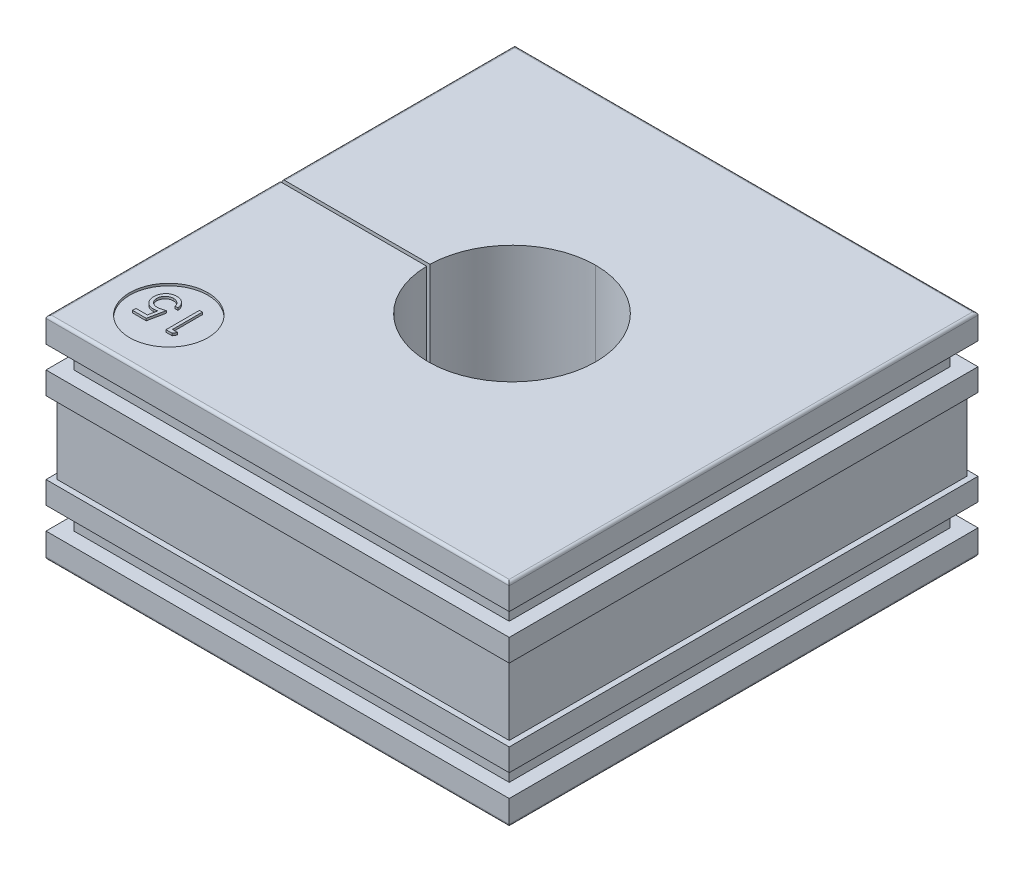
ISO-10303-21;
HEADER;
FILE_DESCRIPTION(('STEP AP214'),'2;1');
FILE_NAME('part.step','',(''),(''),'','','');
FILE_SCHEMA(('AUTOMOTIVE_DESIGN { 1 0 10303 214 1 1 1 1 }'));
ENDSEC;
DATA;
#1=APPLICATION_CONTEXT('core data for automotive mechanical design processes');
#2=APPLICATION_PROTOCOL_DEFINITION('international standard','automotive_design',2000,#1);
#3=PRODUCT_CONTEXT('',#1,'mechanical');
#4=PRODUCT('Part','Part','',(#3));
#5=PRODUCT_RELATED_PRODUCT_CATEGORY('part','',(#4));
#6=PRODUCT_DEFINITION_FORMATION('','',#4);
#7=PRODUCT_DEFINITION_CONTEXT('part definition',#1,'design');
#8=PRODUCT_DEFINITION('design','',#6,#7);
#9=PRODUCT_DEFINITION_SHAPE('','',#8);
#10=(LENGTH_UNIT() NAMED_UNIT(*) SI_UNIT(.MILLI.,.METRE.));
#11=(NAMED_UNIT(*) PLANE_ANGLE_UNIT() SI_UNIT($,.RADIAN.));
#12=(NAMED_UNIT(*) SI_UNIT($,.STERADIAN.) SOLID_ANGLE_UNIT());
#13=UNCERTAINTY_MEASURE_WITH_UNIT(LENGTH_MEASURE(1.E-05),#10,'distance_accuracy_value','');
#14=(GEOMETRIC_REPRESENTATION_CONTEXT(3) GLOBAL_UNCERTAINTY_ASSIGNED_CONTEXT((#13)) GLOBAL_UNIT_ASSIGNED_CONTEXT((#10,
#11,#12)) REPRESENTATION_CONTEXT('',''));
#15=CARTESIAN_POINT('',(0.,0.,0.));
#16=DIRECTION('',(0.,0.,1.));
#17=DIRECTION('',(1.,0.,0.));
#18=AXIS2_PLACEMENT_3D('',#15,#16,#17);
#19=CARTESIAN_POINT('',(-20.75,19.,-21.));
#20=DIRECTION('',(0.,-1.,0.));
#21=DIRECTION('',(0.,0.,-1.));
#22=AXIS2_PLACEMENT_3D('',#19,#20,#21);
#23=PLANE('',#22);
#24=DIRECTION('',(0.496686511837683,0.,-0.86793001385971));
#25=VECTOR('',#24,1.);
#26=CARTESIAN_POINT('',(-13.5192307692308,19.,16.4423076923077));
#27=LINE('',#26,#25);
#28=CARTESIAN_POINT('',(-13.6953125,19.,16.75));
#29=VERTEX_POINT('',#28);
#30=CARTESIAN_POINT('',(-13.5192307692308,19.,16.4423076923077));
#31=VERTEX_POINT('',#30);
#32=EDGE_CURVE('E1544',#29,#31,#27,.T.);
#33=ORIENTED_EDGE('',*,*,#32,.T.);
#34=DIRECTION('',(-1.,0.,0.));
#35=VECTOR('',#34,1.);
#36=CARTESIAN_POINT('',(-13.9807692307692,19.,16.4423076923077));
#37=LINE('',#36,#35);
#38=CARTESIAN_POINT('',(-13.9807692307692,19.,16.4423076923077));
#39=VERTEX_POINT('',#38);
#40=EDGE_CURVE('E1554',#31,#39,#37,.T.);
#41=ORIENTED_EDGE('',*,*,#40,.T.);
#42=DIRECTION('',(0.,0.,-1.));
#43=VECTOR('',#42,1.);
#44=CARTESIAN_POINT('',(-13.9807692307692,19.,13.75));
#45=LINE('',#44,#43);
#46=CARTESIAN_POINT('',(-13.9807692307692,19.,13.75));
#47=VERTEX_POINT('',#46);
#48=EDGE_CURVE('E1561',#39,#47,#45,.T.);
#49=ORIENTED_EDGE('',*,*,#48,.T.);
#50=DIRECTION('',(-1.,0.,0.));
#51=VECTOR('',#50,1.);
#52=CARTESIAN_POINT('',(-14.25,19.,13.75));
#53=LINE('',#52,#51);
#54=CARTESIAN_POINT('',(-14.25,19.,13.75));
#55=VERTEX_POINT('',#54);
#56=EDGE_CURVE('E1568',#47,#55,#53,.T.);
#57=ORIENTED_EDGE('',*,*,#56,.T.);
#58=DIRECTION('',(0.,0.,1.));
#59=VECTOR('',#58,1.);
#60=CARTESIAN_POINT('',(-14.25,19.,16.75));
#61=LINE('',#60,#59);
#62=CARTESIAN_POINT('',(-14.25,19.,16.75));
#63=VERTEX_POINT('',#62);
#64=EDGE_CURVE('E41',#55,#63,#61,.T.);
#65=ORIENTED_EDGE('',*,*,#64,.T.);
#66=DIRECTION('',(1.,0.,0.));
#67=VECTOR('',#66,1.);
#68=CARTESIAN_POINT('',(-13.6953125,19.,16.75));
#69=LINE('',#68,#67);
#70=EDGE_CURVE('E9',#63,#29,#69,.T.);
#71=ORIENTED_EDGE('',*,*,#70,.T.);
#72=EDGE_LOOP('',(#33,#41,#49,#57,#65,#71));
#73=FACE_BOUND('',#72,.T.);
#74=ADVANCED_FACE('F15',(#73),#23,.F.);
#75=CARTESIAN_POINT('',(-13.6953125,22.6489846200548,16.75));
#76=DIRECTION('',(0.,0.,1.));
#77=DIRECTION('',(1.,0.,0.));
#78=AXIS2_PLACEMENT_3D('',#75,#76,#77);
#79=PLANE('',#78);
#80=ORIENTED_EDGE('',*,*,#70,.F.);
#81=DIRECTION('',(0.,-1.,0.));
#82=VECTOR('',#81,1.);
#83=CARTESIAN_POINT('',(-14.25,22.6489846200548,16.75));
#84=LINE('',#83,#82);
#85=CARTESIAN_POINT('',(-14.25,18.8,16.75));
#86=VERTEX_POINT('',#85);
#87=EDGE_CURVE('E23',#63,#86,#84,.T.);
#88=ORIENTED_EDGE('',*,*,#87,.T.);
#89=DIRECTION('',(-1.,0.,0.));
#90=VECTOR('',#89,1.);
#91=CARTESIAN_POINT('',(-13.6953125,18.8,16.75));
#92=LINE('',#91,#90);
#93=CARTESIAN_POINT('',(-13.6953125,18.8,16.75));
#94=VERTEX_POINT('',#93);
#95=EDGE_CURVE('E1210',#94,#86,#92,.T.);
#96=ORIENTED_EDGE('',*,*,#95,.F.);
#97=DIRECTION('',(0.,-1.,0.));
#98=VECTOR('',#97,1.);
#99=CARTESIAN_POINT('',(-13.6953125,22.6489846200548,16.75));
#100=LINE('',#99,#98);
#101=EDGE_CURVE('E1548',#29,#94,#100,.T.);
#102=ORIENTED_EDGE('',*,*,#101,.F.);
#103=EDGE_LOOP('',(#80,#88,#96,#102));
#104=FACE_BOUND('',#103,.T.);
#105=ADVANCED_FACE('F1580',(#104),#79,.T.);
#106=CARTESIAN_POINT('',(-14.25,22.6489846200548,16.75));
#107=DIRECTION('',(-1.,0.,0.));
#108=DIRECTION('',(0.,0.,1.));
#109=AXIS2_PLACEMENT_3D('',#106,#107,#108);
#110=PLANE('',#109);
#111=ORIENTED_EDGE('',*,*,#64,.F.);
#112=DIRECTION('',(0.,-1.,0.));
#113=VECTOR('',#112,1.);
#114=CARTESIAN_POINT('',(-14.25,22.6489846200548,13.75));
#115=LINE('',#114,#113);
#116=CARTESIAN_POINT('',(-14.25,18.8,13.75));
#117=VERTEX_POINT('',#116);
#118=EDGE_CURVE('E1572',#55,#117,#115,.T.);
#119=ORIENTED_EDGE('',*,*,#118,.T.);
#120=DIRECTION('',(0.,0.,-1.));
#121=VECTOR('',#120,1.);
#122=CARTESIAN_POINT('',(-14.25,18.8,16.75));
#123=LINE('',#122,#121);
#124=EDGE_CURVE('E1214',#86,#117,#123,.T.);
#125=ORIENTED_EDGE('',*,*,#124,.F.);
#126=ORIENTED_EDGE('',*,*,#87,.F.);
#127=EDGE_LOOP('',(#111,#119,#125,#126));
#128=FACE_BOUND('',#127,.T.);
#129=ADVANCED_FACE('F1581',(#128),#110,.T.);
#130=CARTESIAN_POINT('',(-14.25,22.6489846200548,13.75));
#131=DIRECTION('',(0.,0.,-1.));
#132=DIRECTION('',(0.,-1.,0.));
#133=AXIS2_PLACEMENT_3D('',#130,#131,#132);
#134=PLANE('',#133);
#135=ORIENTED_EDGE('',*,*,#56,.F.);
#136=DIRECTION('',(0.,-1.,0.));
#137=VECTOR('',#136,1.);
#138=CARTESIAN_POINT('',(-13.9807692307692,22.6489846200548,13.75));
#139=LINE('',#138,#137);
#140=CARTESIAN_POINT('',(-13.9807692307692,18.8,13.75));
#141=VERTEX_POINT('',#140);
#142=EDGE_CURVE('E1565',#47,#141,#139,.T.);
#143=ORIENTED_EDGE('',*,*,#142,.T.);
#144=DIRECTION('',(1.,0.,0.));
#145=VECTOR('',#144,1.);
#146=CARTESIAN_POINT('',(-14.25,18.8,13.75));
#147=LINE('',#146,#145);
#148=EDGE_CURVE('E1222',#117,#141,#147,.T.);
#149=ORIENTED_EDGE('',*,*,#148,.F.);
#150=ORIENTED_EDGE('',*,*,#118,.F.);
#151=EDGE_LOOP('',(#135,#143,#149,#150));
#152=FACE_BOUND('',#151,.T.);
#153=ADVANCED_FACE('F1593',(#152),#134,.T.);
#154=CARTESIAN_POINT('',(-13.9807692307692,22.6489846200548,13.75));
#155=DIRECTION('',(1.,0.,0.));
#156=DIRECTION('',(0.,1.,0.));
#157=AXIS2_PLACEMENT_3D('',#154,#155,#156);
#158=PLANE('',#157);
#159=ORIENTED_EDGE('',*,*,#48,.F.);
#160=DIRECTION('',(0.,-1.,0.));
#161=VECTOR('',#160,1.);
#162=CARTESIAN_POINT('',(-13.9807692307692,22.6489846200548,16.4423076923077));
#163=LINE('',#162,#161);
#164=CARTESIAN_POINT('',(-13.9807692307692,18.8,16.4423076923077));
#165=VERTEX_POINT('',#164);
#166=EDGE_CURVE('E1558',#39,#165,#163,.T.);
#167=ORIENTED_EDGE('',*,*,#166,.T.);
#168=DIRECTION('',(0.,0.,1.));
#169=VECTOR('',#168,1.);
#170=CARTESIAN_POINT('',(-13.9807692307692,18.8,13.75));
#171=LINE('',#170,#169);
#172=EDGE_CURVE('E1323',#141,#165,#171,.T.);
#173=ORIENTED_EDGE('',*,*,#172,.F.);
#174=ORIENTED_EDGE('',*,*,#142,.F.);
#175=EDGE_LOOP('',(#159,#167,#173,#174));
#176=FACE_BOUND('',#175,.T.);
#177=ADVANCED_FACE('F1596',(#176),#158,.T.);
#178=CARTESIAN_POINT('',(-13.9807692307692,22.6489846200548,16.4423076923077));
#179=DIRECTION('',(0.,0.,-1.));
#180=DIRECTION('',(0.,-1.,0.));
#181=AXIS2_PLACEMENT_3D('',#178,#179,#180);
#182=PLANE('',#181);
#183=ORIENTED_EDGE('',*,*,#40,.F.);
#184=DIRECTION('',(0.,-1.,0.));
#185=VECTOR('',#184,1.);
#186=CARTESIAN_POINT('',(-13.5192307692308,22.6489846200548,16.4423076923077));
#187=LINE('',#186,#185);
#188=CARTESIAN_POINT('',(-13.5192307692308,18.8,16.4423076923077));
#189=VERTEX_POINT('',#188);
#190=EDGE_CURVE('E1551',#31,#189,#187,.T.);
#191=ORIENTED_EDGE('',*,*,#190,.T.);
#192=DIRECTION('',(1.,0.,0.));
#193=VECTOR('',#192,1.);
#194=CARTESIAN_POINT('',(-13.9807692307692,18.8,16.4423076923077));
#195=LINE('',#194,#193);
#196=EDGE_CURVE('E1327',#165,#189,#195,.T.);
#197=ORIENTED_EDGE('',*,*,#196,.F.);
#198=ORIENTED_EDGE('',*,*,#166,.F.);
#199=EDGE_LOOP('',(#183,#191,#197,#198));
#200=FACE_BOUND('',#199,.T.);
#201=ADVANCED_FACE('F1599',(#200),#182,.T.);
#202=CARTESIAN_POINT('',(-13.5192307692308,22.6489846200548,16.4423076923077));
#203=DIRECTION('',(0.86793001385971,0.,0.496686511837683));
#204=DIRECTION('',(0.,-1.,0.));
#205=AXIS2_PLACEMENT_3D('',#202,#203,#204);
#206=PLANE('',#205);
#207=ORIENTED_EDGE('',*,*,#32,.F.);
#208=ORIENTED_EDGE('',*,*,#101,.T.);
#209=DIRECTION('',(-0.496686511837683,0.,0.86793001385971));
#210=VECTOR('',#209,1.);
#211=CARTESIAN_POINT('',(-13.5192307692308,18.8,16.4423076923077));
#212=LINE('',#211,#210);
#213=EDGE_CURVE('E635',#189,#94,#212,.T.);
#214=ORIENTED_EDGE('',*,*,#213,.F.);
#215=ORIENTED_EDGE('',*,*,#190,.F.);
#216=EDGE_LOOP('',(#207,#208,#214,#215));
#217=FACE_BOUND('',#216,.T.);
#218=ADVANCED_FACE('F1589',(#217),#206,.T.);
#219=CARTESIAN_POINT('',(-20.75,19.,-21.));
#220=DIRECTION('',(0.,-1.,0.));
#221=DIRECTION('',(0.,0.,-1.));
#222=AXIS2_PLACEMENT_3D('',#219,#220,#221);
#223=PLANE('',#222);
#224=DIRECTION('',(1.,0.,0.));
#225=VECTOR('',#224,1.);
#226=CARTESIAN_POINT('',(-16.0192307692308,19.,16.75));
#227=LINE('',#226,#225);
#228=CARTESIAN_POINT('',(-17.25,19.,16.75));
#229=VERTEX_POINT('',#228);
#230=CARTESIAN_POINT('',(-16.0192307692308,19.,16.75));
#231=VERTEX_POINT('',#230);
#232=EDGE_CURVE('E1427',#229,#231,#227,.T.);
#233=ORIENTED_EDGE('',*,*,#232,.T.);
#234=DIRECTION('',(0.200944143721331,0.,-0.97960270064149));
#235=VECTOR('',#234,1.);
#236=CARTESIAN_POINT('',(-15.7115384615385,19.,15.25));
#237=LINE('',#236,#235);
#238=CARTESIAN_POINT('',(-15.7115384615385,19.,15.25));
#239=VERTEX_POINT('',#238);
#240=EDGE_CURVE('E1437',#231,#239,#237,.T.);
#241=ORIENTED_EDGE('',*,*,#240,.T.);
#242=CARTESIAN_POINT('',(-15.7115384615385,19.,15.25));
#243=CARTESIAN_POINT('',(-15.7430989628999,19.,15.2622651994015));
#244=CARTESIAN_POINT('',(-15.8048355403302,19.,15.2862575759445));
#245=CARTESIAN_POINT('',(-15.8965591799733,19.,15.3171901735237));
#246=CARTESIAN_POINT('',(-15.9846461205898,19.,15.3440443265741));
#247=CARTESIAN_POINT('',(-16.0690984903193,19.,15.3655470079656));
#248=CARTESIAN_POINT('',(-16.1500567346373,19.,15.3827207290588));
#249=CARTESIAN_POINT('',(-16.2272986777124,19.,15.3946360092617));
#250=CARTESIAN_POINT('',(-16.3011241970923,19.,15.4023812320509));
#251=CARTESIAN_POINT('',(-16.3491408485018,19.,15.4033654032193));
#252=CARTESIAN_POINT('',(-16.3725961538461,19.,15.4038461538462));
#253=(BOUNDED_CURVE() B_SPLINE_CURVE(3,(#242,#243,#244,#245,#246,#247,#248,#249,#250,#251,#252),
.UNSPECIFIED.,.F.,.F.) B_SPLINE_CURVE_WITH_KNOTS((4,1,1,1,1,1,1,1,4),(0.,0.148813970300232,
0.291100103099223,0.425365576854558,0.55350017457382,0.674036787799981,0.788979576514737,
0.89692016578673,1.),
.UNSPECIFIED.) CURVE() GEOMETRIC_REPRESENTATION_ITEM() RATIONAL_B_SPLINE_CURVE((1.,1.,1.,1.,1.,
1.,1.,1.,1.,1.,1.)) REPRESENTATION_ITEM(''));
#254=CARTESIAN_POINT('',(-16.3725961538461,19.,15.4038461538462));
#255=VERTEX_POINT('',#254);
#256=EDGE_CURVE('E1444',#239,#255,#253,.T.);
#257=ORIENTED_EDGE('',*,*,#256,.T.);
#258=CARTESIAN_POINT('',(-16.3725961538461,19.,15.4038461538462));
#259=CARTESIAN_POINT('',(-16.3994616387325,19.,15.4032529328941));
#260=CARTESIAN_POINT('',(-16.4517264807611,19.,15.4020988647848));
#261=CARTESIAN_POINT('',(-16.52813344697,19.,15.393591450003));
#262=CARTESIAN_POINT('',(-16.6003976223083,19.,15.3793742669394));
#263=CARTESIAN_POINT('',(-16.6685348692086,19.,15.3588024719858));
#264=CARTESIAN_POINT('',(-16.7325840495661,19.,15.3329785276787));
#265=CARTESIAN_POINT('',(-16.7926162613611,19.,15.3014551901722));
#266=CARTESIAN_POINT('',(-16.8487714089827,19.,15.2644043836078));
#267=CARTESIAN_POINT('',(-16.8994446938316,19.,15.2207196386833));
#268=CARTESIAN_POINT('',(-16.9462443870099,19.,15.1737804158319));
#269=CARTESIAN_POINT('',(-16.9853233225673,19.,15.1214958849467));
#270=CARTESIAN_POINT('',(-17.0206708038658,19.,15.0673226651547));
#271=CARTESIAN_POINT('',(-17.0477994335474,19.,15.008611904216));
#272=CARTESIAN_POINT('',(-17.0701341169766,19.,14.9468142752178));
#273=CARTESIAN_POINT('',(-17.0842952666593,19.,14.8812846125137));
#274=CARTESIAN_POINT('',(-17.0948089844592,19.,14.8126351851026));
#275=CARTESIAN_POINT('',(-17.0956979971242,19.,14.7656689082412));
#276=CARTESIAN_POINT('',(-17.0961538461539,19.,14.7415865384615));
#277=(BOUNDED_CURVE() B_SPLINE_CURVE(3,(#258,#259,#260,#261,#262,#263,#264,#265,#266,#267,#268,
#269,#270,#271,#272,#273,#274,#275,#276),.UNSPECIFIED.,.F.,.F.) B_SPLINE_CURVE_WITH_KNOTS((4,1,
1,1,1,1,1,1,1,1,1,1,1,1,1,1,4),(0.,0.0729770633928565,0.141971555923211,0.208572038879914,
0.272793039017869,0.335046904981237,0.395905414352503,0.456734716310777,0.517359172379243,
0.577396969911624,0.636394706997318,0.694372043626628,0.752797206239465,0.811664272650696,
0.872525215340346,0.934636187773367,1.),
.UNSPECIFIED.) CURVE() GEOMETRIC_REPRESENTATION_ITEM() RATIONAL_B_SPLINE_CURVE((1.,1.,1.,1.,1.,
1.,1.,1.,1.,1.,1.,1.,1.,1.,1.,1.,1.,1.,1.)) REPRESENTATION_ITEM(''));
#278=CARTESIAN_POINT('',(-17.0961538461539,19.,14.7415865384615));
#279=VERTEX_POINT('',#278);
#280=EDGE_CURVE('E1456',#255,#279,#277,.T.);
#281=ORIENTED_EDGE('',*,*,#280,.T.);
#282=CARTESIAN_POINT('',(-17.0961538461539,19.,14.7415865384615));
#283=CARTESIAN_POINT('',(-17.0954326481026,19.,14.7149128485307));
#284=CARTESIAN_POINT('',(-17.0940173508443,19.,14.662567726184));
#285=CARTESIAN_POINT('',(-17.0837290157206,19.,14.5858234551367));
#286=CARTESIAN_POINT('',(-17.0662081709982,19.,14.5125367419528));
#287=CARTESIAN_POINT('',(-17.0416482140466,19.,14.4425265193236));
#288=CARTESIAN_POINT('',(-17.0093046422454,19.,14.3761210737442));
#289=CARTESIAN_POINT('',(-16.9709246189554,19.,14.3125919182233));
#290=CARTESIAN_POINT('',(-16.9248472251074,19.,14.2530415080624));
#291=CARTESIAN_POINT('',(-16.8727018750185,19.,14.1973469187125));
#292=CARTESIAN_POINT('',(-16.8157532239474,19.,14.1468360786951));
#293=CARTESIAN_POINT('',(-16.7550162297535,19.,14.1026432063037));
#294=CARTESIAN_POINT('',(-16.6920893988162,19.,14.0645791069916));
#295=CARTESIAN_POINT('',(-16.6260762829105,19.,14.0335934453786));
#296=CARTESIAN_POINT('',(-16.5570702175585,19.,14.0101716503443));
#297=CARTESIAN_POINT('',(-16.4854102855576,19.,13.9934530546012));
#298=CARTESIAN_POINT('',(-16.4109692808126,19.,13.9828754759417));
#299=CARTESIAN_POINT('',(-16.360412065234,19.,13.9814786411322));
#300=CARTESIAN_POINT('',(-16.3347355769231,19.,13.9807692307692));
#301=(BOUNDED_CURVE() B_SPLINE_CURVE(3,(#282,#283,#284,#285,#286,#287,#288,#289,#290,#291,#292,
#293,#294,#295,#296,#297,#298,#299,#300),.UNSPECIFIED.,.F.,.F.) B_SPLINE_CURVE_WITH_KNOTS((4,1,
1,1,1,1,1,1,1,1,1,1,1,1,1,1,4),(0.,0.0667068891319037,0.130907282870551,0.193250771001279,
0.254895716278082,0.316074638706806,0.377686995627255,0.440221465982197,0.504029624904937,
0.568274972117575,0.630309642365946,0.69166271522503,0.751959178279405,0.812328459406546,
0.873581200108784,0.935795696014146,1.),
.UNSPECIFIED.) CURVE() GEOMETRIC_REPRESENTATION_ITEM() RATIONAL_B_SPLINE_CURVE((1.,1.,1.,1.,1.,
1.,1.,1.,1.,1.,1.,1.,1.,1.,1.,1.,1.,1.,1.)) REPRESENTATION_ITEM(''));
#302=CARTESIAN_POINT('',(-16.3347355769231,19.,13.9807692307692));
#303=VERTEX_POINT('',#302);
#304=EDGE_CURVE('E1468',#279,#303,#301,.T.);
#305=ORIENTED_EDGE('',*,*,#304,.T.);
#306=CARTESIAN_POINT('',(-16.3347355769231,19.,13.9807692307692));
#307=CARTESIAN_POINT('',(-16.3084437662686,19.,13.9815728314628));
#308=CARTESIAN_POINT('',(-16.2561558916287,19.,13.9831709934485));
#309=CARTESIAN_POINT('',(-16.1784933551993,19.,13.9962427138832));
#310=CARTESIAN_POINT('',(-16.1027045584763,19.,14.0178415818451));
#311=CARTESIAN_POINT('',(-16.0298656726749,19.,14.0480925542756));
#312=CARTESIAN_POINT('',(-15.9609997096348,19.,14.0840576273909));
#313=CARTESIAN_POINT('',(-15.8990359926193,19.,14.1268548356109));
#314=CARTESIAN_POINT('',(-15.8439606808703,19.,14.1748717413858));
#315=CARTESIAN_POINT('',(-15.7962418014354,19.,14.2288674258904));
#316=CARTESIAN_POINT('',(-15.7542317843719,19.,14.2893778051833));
#317=CARTESIAN_POINT('',(-15.7204681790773,19.,14.3584396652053));
#318=CARTESIAN_POINT('',(-15.692409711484,19.,14.435618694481));
#319=CARTESIAN_POINT('',(-15.6796930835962,19.,14.4906166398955));
#320=CARTESIAN_POINT('',(-15.6730769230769,19.,14.5192307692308));
#321=(BOUNDED_CURVE() B_SPLINE_CURVE(3,(#306,#307,#308,#309,#310,#311,#312,#313,#314,#315,#316,
#317,#318,#319,#320),.UNSPECIFIED.,.F.,.F.) B_SPLINE_CURVE_WITH_KNOTS((4,1,1,1,1,1,1,1,1,1,1,1,
4),(0.,0.084803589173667,0.168653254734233,0.253363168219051,0.338594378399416,
0.422745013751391,0.503613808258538,0.581026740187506,0.657955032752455,0.735594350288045,
0.817986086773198,0.905302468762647,1.),
.UNSPECIFIED.) CURVE() GEOMETRIC_REPRESENTATION_ITEM() RATIONAL_B_SPLINE_CURVE((1.,1.,1.,1.,1.,
1.,1.,1.,1.,1.,1.,1.,1.,1.,1.)) REPRESENTATION_ITEM(''));
#322=CARTESIAN_POINT('',(-15.6730769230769,19.,14.5192307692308));
#323=VERTEX_POINT('',#322);
#324=EDGE_CURVE('E1480',#303,#323,#321,.T.);
#325=ORIENTED_EDGE('',*,*,#324,.T.);
#326=DIRECTION('',(1.,0.,0.));
#327=VECTOR('',#326,1.);
#328=CARTESIAN_POINT('',(-15.4038461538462,19.,14.5192307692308));
#329=LINE('',#328,#327);
#330=CARTESIAN_POINT('',(-15.4038461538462,19.,14.5192307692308));
#331=VERTEX_POINT('',#330);
#332=EDGE_CURVE('E909',#323,#331,#329,.T.);
#333=ORIENTED_EDGE('',*,*,#332,.T.);
#334=CARTESIAN_POINT('',(-15.4038461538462,19.,14.5192307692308));
#335=CARTESIAN_POINT('',(-15.4085757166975,19.,14.4886891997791));
#336=CARTESIAN_POINT('',(-15.4178874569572,19.,14.4285578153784));
#337=CARTESIAN_POINT('',(-15.4398957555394,19.,14.3412135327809));
#338=CARTESIAN_POINT('',(-15.4671720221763,19.,14.2579704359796));
#339=CARTESIAN_POINT('',(-15.5018618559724,19.,14.1792328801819));
#340=CARTESIAN_POINT('',(-15.5426409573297,19.,14.1048181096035));
#341=CARTESIAN_POINT('',(-15.5895727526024,19.,14.0345321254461));
#342=CARTESIAN_POINT('',(-15.6437743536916,19.,13.9695475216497));
#343=CARTESIAN_POINT('',(-15.7026499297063,19.,13.908422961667));
#344=CARTESIAN_POINT('',(-15.7668313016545,19.,13.8533123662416));
#345=CARTESIAN_POINT('',(-15.8347935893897,19.,13.804783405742));
#346=CARTESIAN_POINT('',(-15.9070189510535,19.,13.7645758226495));
#347=CARTESIAN_POINT('',(-15.9821853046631,19.,13.7305162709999));
#348=CARTESIAN_POINT('',(-16.061383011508,19.,13.704543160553));
#349=CARTESIAN_POINT('',(-16.1442396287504,19.,13.6870027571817));
#350=CARTESIAN_POINT('',(-16.2304115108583,19.,13.6748389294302));
#351=CARTESIAN_POINT('',(-16.2892192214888,19.,13.6736707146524));
#352=CARTESIAN_POINT('',(-16.3191105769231,19.,13.6730769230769));
#353=(BOUNDED_CURVE() B_SPLINE_CURVE(3,(#334,#335,#336,#337,#338,#339,#340,#341,#342,#343,#344,
#345,#346,#347,#348,#349,#350,#351,#352),.UNSPECIFIED.,.F.,.F.) B_SPLINE_CURVE_WITH_KNOTS((4,1,
1,1,1,1,1,1,1,1,1,1,1,1,1,1,4),(0.,0.0676669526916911,0.133225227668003,0.197055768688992,
0.259342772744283,0.321399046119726,0.382737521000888,0.444146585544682,0.506520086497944,
0.568441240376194,0.629194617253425,0.689119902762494,0.749223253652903,0.809724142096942,
0.871264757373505,0.934565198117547,1.),
.UNSPECIFIED.) CURVE() GEOMETRIC_REPRESENTATION_ITEM() RATIONAL_B_SPLINE_CURVE((1.,1.,1.,1.,1.,
1.,1.,1.,1.,1.,1.,1.,1.,1.,1.,1.,1.,1.,1.)) REPRESENTATION_ITEM(''));
#354=CARTESIAN_POINT('',(-16.3191105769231,19.,13.6730769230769));
#355=VERTEX_POINT('',#354);
#356=EDGE_CURVE('E1493',#331,#355,#353,.T.);
#357=ORIENTED_EDGE('',*,*,#356,.T.);
#358=CARTESIAN_POINT('',(-16.3191105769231,19.,13.6730769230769));
#359=CARTESIAN_POINT('',(-16.3441687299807,19.,13.6733040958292));
#360=CARTESIAN_POINT('',(-16.3937757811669,19.,13.6737538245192));
#361=CARTESIAN_POINT('',(-16.4669599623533,19.,13.6809315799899));
#362=CARTESIAN_POINT('',(-16.5380613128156,19.,13.690796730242));
#363=CARTESIAN_POINT('',(-16.6067230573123,19.,13.7052832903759));
#364=CARTESIAN_POINT('',(-16.6731816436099,19.,13.7239550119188));
#365=CARTESIAN_POINT('',(-16.7373082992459,19.,13.7469156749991));
#366=CARTESIAN_POINT('',(-16.7996746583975,19.,13.7731112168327));
#367=CARTESIAN_POINT('',(-16.8589113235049,19.,13.8045142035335));
#368=CARTESIAN_POINT('',(-16.9156200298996,19.,13.8395864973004));
#369=CARTESIAN_POINT('',(-16.9697609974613,19.,13.8777204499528));
#370=CARTESIAN_POINT('',(-17.0203797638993,19.,13.9203584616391));
#371=CARTESIAN_POINT('',(-17.068608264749,19.,13.9656919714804));
#372=CARTESIAN_POINT('',(-17.1132629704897,19.,14.0156120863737));
#373=CARTESIAN_POINT('',(-17.1552012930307,19.,14.0686830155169));
#374=CARTESIAN_POINT('',(-17.1936890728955,19.,14.1257918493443));
#375=CARTESIAN_POINT('',(-17.2297524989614,19.,14.1852818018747));
#376=CARTESIAN_POINT('',(-17.2614499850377,19.,14.2478460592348));
#377=CARTESIAN_POINT('',(-17.2892270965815,19.,14.3122531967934));
#378=CARTESIAN_POINT('',(-17.3124340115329,19.,14.3781827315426));
#379=CARTESIAN_POINT('',(-17.3320584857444,19.,14.4455255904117));
#380=CARTESIAN_POINT('',(-17.346816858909,19.,14.5144406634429));
#381=CARTESIAN_POINT('',(-17.3579284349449,19.,14.5850307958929));
#382=CARTESIAN_POINT('',(-17.3636808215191,19.,14.65715616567));
#383=CARTESIAN_POINT('',(-17.3648141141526,19.,14.7057207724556));
#384=CARTESIAN_POINT('',(-17.3653846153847,19.,14.7301682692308));
#385=(BOUNDED_CURVE() B_SPLINE_CURVE(3,(#358,#359,#360,#361,#362,#363,#364,#365,#366,#367,#368,
#369,#370,#371,#372,#373,#374,#375,#376,#377,#378,#379,#380,#381,#382,#383,#384),.UNSPECIFIED.,
.F.,.F.) B_SPLINE_CURVE_WITH_KNOTS((4,1,1,1,1,1,1,1,1,1,1,1,1,1,1,1,1,1,1,1,1,1,1,1,4),(0.,
0.0450827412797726,0.0892492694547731,0.132234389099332,0.174239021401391,0.215445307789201,
0.256385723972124,0.296769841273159,0.337089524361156,0.376914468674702,0.416732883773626,
0.456157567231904,0.495943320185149,0.535768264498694,0.576594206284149,0.617596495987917,
0.659644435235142,0.701731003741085,0.743724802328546,0.785805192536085,0.82745706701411,
0.869889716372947,0.912571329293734,0.955988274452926,1.),
.UNSPECIFIED.) CURVE() GEOMETRIC_REPRESENTATION_ITEM() RATIONAL_B_SPLINE_CURVE((1.,1.,1.,1.,1.,
1.,1.,1.,1.,1.,1.,1.,1.,1.,1.,1.,1.,1.,1.,1.,1.,1.,1.,1.,1.,1.,1.)) REPRESENTATION_ITEM(''));
#386=CARTESIAN_POINT('',(-17.3653846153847,19.,14.7301682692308));
#387=VERTEX_POINT('',#386);
#388=EDGE_CURVE('E1505',#355,#387,#385,.T.);
#389=ORIENTED_EDGE('',*,*,#388,.T.);
#390=CARTESIAN_POINT('',(-17.3653846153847,19.,14.7301682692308));
#391=CARTESIAN_POINT('',(-17.3646323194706,19.,14.7652686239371));
#392=CARTESIAN_POINT('',(-17.3631570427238,19.,14.8341015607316));
#393=CARTESIAN_POINT('',(-17.3499351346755,19.,14.9347681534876));
#394=CARTESIAN_POINT('',(-17.330118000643,19.,15.0309791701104));
#395=CARTESIAN_POINT('',(-17.3001465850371,19.,15.121934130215));
#396=CARTESIAN_POINT('',(-17.2631804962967,19.,15.2083962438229));
#397=CARTESIAN_POINT('',(-17.2168398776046,19.,15.2895506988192));
#398=CARTESIAN_POINT('',(-17.162625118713,19.,15.3661439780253));
#399=CARTESIAN_POINT('',(-17.100484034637,19.,15.4373214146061));
#400=CARTESIAN_POINT('',(-17.0315559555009,19.,15.5012499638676));
#401=CARTESIAN_POINT('',(-16.9578682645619,19.,15.5576739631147));
#402=CARTESIAN_POINT('',(-16.8795820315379,19.,15.6054359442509));
#403=CARTESIAN_POINT('',(-16.7963295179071,19.,15.6438553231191));
#404=CARTESIAN_POINT('',(-16.7092394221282,19.,15.6751147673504));
#405=CARTESIAN_POINT('',(-16.6169076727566,19.,15.6954369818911));
#406=CARTESIAN_POINT('',(-16.520662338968,19.,15.7094581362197));
#407=CARTESIAN_POINT('',(-16.4547804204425,19.,15.7108371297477));
#408=CARTESIAN_POINT('',(-16.4212740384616,19.,15.7115384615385));
#409=(BOUNDED_CURVE() B_SPLINE_CURVE(3,(#390,#391,#392,#393,#394,#395,#396,#397,#398,#399,#400,
#401,#402,#403,#404,#405,#406,#407,#408),.UNSPECIFIED.,.F.,.F.) B_SPLINE_CURVE_WITH_KNOTS((4,1,
1,1,1,1,1,1,1,1,1,1,1,1,1,1,4),(0.,0.0689373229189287,0.135188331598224,0.199187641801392,
0.261674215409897,0.3230235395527,0.383660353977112,0.444928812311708,0.50713582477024,
0.568964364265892,0.629346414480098,0.689223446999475,0.748742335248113,0.809243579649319,
0.870638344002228,0.934208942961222,1.),
.UNSPECIFIED.) CURVE() GEOMETRIC_REPRESENTATION_ITEM() RATIONAL_B_SPLINE_CURVE((1.,1.,1.,1.,1.,
1.,1.,1.,1.,1.,1.,1.,1.,1.,1.,1.,1.,1.,1.)) REPRESENTATION_ITEM(''));
#410=CARTESIAN_POINT('',(-16.4212740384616,19.,15.7115384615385));
#411=VERTEX_POINT('',#410);
#412=EDGE_CURVE('E1517',#387,#411,#409,.T.);
#413=ORIENTED_EDGE('',*,*,#412,.T.);
#414=CARTESIAN_POINT('',(-16.4212740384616,19.,15.7115384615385));
#415=CARTESIAN_POINT('',(-16.3941999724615,19.,15.71078718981));
#416=CARTESIAN_POINT('',(-16.3382496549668,19.,15.7092346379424));
#417=CARTESIAN_POINT('',(-16.2520277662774,19.,15.6978642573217));
#418=CARTESIAN_POINT('',(-16.1612050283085,19.,15.6790021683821));
#419=CARTESIAN_POINT('',(-16.0996708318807,19.,15.6620139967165));
#420=CARTESIAN_POINT('',(-16.0679086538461,19.,15.6532451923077));
#421=(BOUNDED_CURVE() B_SPLINE_CURVE(3,(#414,#415,#416,#417,#418,#419,#420),.UNSPECIFIED.,.F.,
.F.) B_SPLINE_CURVE_WITH_KNOTS((4,1,1,1,4),(0.,0.226026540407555,0.467098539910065,
0.724931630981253,1.),
.UNSPECIFIED.) CURVE() GEOMETRIC_REPRESENTATION_ITEM() RATIONAL_B_SPLINE_CURVE((1.,1.,1.,1.,1.,
1.,1.)) REPRESENTATION_ITEM(''));
#422=CARTESIAN_POINT('',(-16.0679086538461,19.,15.6532451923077));
#423=VERTEX_POINT('',#422);
#424=EDGE_CURVE('E952',#411,#423,#421,.T.);
#425=ORIENTED_EDGE('',*,*,#424,.T.);
#426=DIRECTION('',(-0.200705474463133,0.,0.979651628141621));
#427=VECTOR('',#426,1.);
#428=CARTESIAN_POINT('',(-16.2295673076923,19.,16.4423076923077));
#429=LINE('',#428,#427);
#430=CARTESIAN_POINT('',(-16.2295673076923,19.,16.4423076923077));
#431=VERTEX_POINT('',#430);
#432=EDGE_CURVE('E972',#423,#431,#429,.T.);
#433=ORIENTED_EDGE('',*,*,#432,.T.);
#434=DIRECTION('',(-1.,0.,0.));
#435=VECTOR('',#434,1.);
#436=CARTESIAN_POINT('',(-17.25,19.,16.4423076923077));
#437=LINE('',#436,#435);
#438=CARTESIAN_POINT('',(-17.25,19.,16.4423076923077));
#439=VERTEX_POINT('',#438);
#440=EDGE_CURVE('E1534',#431,#439,#437,.T.);
#441=ORIENTED_EDGE('',*,*,#440,.T.);
#442=DIRECTION('',(0.,0.,1.));
#443=VECTOR('',#442,1.);
#444=CARTESIAN_POINT('',(-17.25,19.,16.75));
#445=LINE('',#444,#443);
#446=EDGE_CURVE('E1541',#439,#229,#445,.T.);
#447=ORIENTED_EDGE('',*,*,#446,.T.);
#448=EDGE_LOOP('',(#233,#241,#257,#281,#305,#325,#333,#357,#389,#413,#425,#433,#441,#447));
#449=FACE_BOUND('',#448,.T.);
#450=ADVANCED_FACE('F1607',(#449),#223,.F.);
#451=CARTESIAN_POINT('',(-17.25,22.6489846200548,16.75));
#452=DIRECTION('',(-1.,0.,0.));
#453=DIRECTION('',(0.,0.,1.));
#454=AXIS2_PLACEMENT_3D('',#451,#452,#453);
#455=PLANE('',#454);
#456=ORIENTED_EDGE('',*,*,#446,.F.);
#457=DIRECTION('',(0.,-1.,0.));
#458=VECTOR('',#457,1.);
#459=CARTESIAN_POINT('',(-17.25,22.6489846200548,16.4423076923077));
#460=LINE('',#459,#458);
#461=CARTESIAN_POINT('',(-17.25,18.8,16.4423076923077));
#462=VERTEX_POINT('',#461);
#463=EDGE_CURVE('E1538',#439,#462,#460,.T.);
#464=ORIENTED_EDGE('',*,*,#463,.T.);
#465=DIRECTION('',(0.,0.,-1.));
#466=VECTOR('',#465,1.);
#467=CARTESIAN_POINT('',(-17.25,18.8,16.75));
#468=LINE('',#467,#466);
#469=CARTESIAN_POINT('',(-17.25,18.8,16.75));
#470=VERTEX_POINT('',#469);
#471=EDGE_CURVE('E1335',#470,#462,#468,.T.);
#472=ORIENTED_EDGE('',*,*,#471,.F.);
#473=DIRECTION('',(0.,-1.,0.));
#474=VECTOR('',#473,1.);
#475=CARTESIAN_POINT('',(-17.25,22.6489846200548,16.75));
#476=LINE('',#475,#474);
#477=EDGE_CURVE('E1431',#229,#470,#476,.T.);
#478=ORIENTED_EDGE('',*,*,#477,.F.);
#479=EDGE_LOOP('',(#456,#464,#472,#478));
#480=FACE_BOUND('',#479,.T.);
#481=ADVANCED_FACE('F1878',(#480),#455,.T.);
#482=CARTESIAN_POINT('',(-17.25,22.6489846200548,16.4423076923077));
#483=DIRECTION('',(0.,0.,-1.));
#484=DIRECTION('',(0.,-1.,0.));
#485=AXIS2_PLACEMENT_3D('',#482,#483,#484);
#486=PLANE('',#485);
#487=ORIENTED_EDGE('',*,*,#440,.F.);
#488=DIRECTION('',(0.,-1.,0.));
#489=VECTOR('',#488,1.);
#490=CARTESIAN_POINT('',(-16.2295673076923,22.6489846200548,16.4423076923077));
#491=LINE('',#490,#489);
#492=CARTESIAN_POINT('',(-16.2295673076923,18.8,16.4423076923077));
#493=VERTEX_POINT('',#492);
#494=EDGE_CURVE('E1531',#431,#493,#491,.T.);
#495=ORIENTED_EDGE('',*,*,#494,.T.);
#496=DIRECTION('',(1.,0.,0.));
#497=VECTOR('',#496,1.);
#498=CARTESIAN_POINT('',(-17.25,18.8,16.4423076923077));
#499=LINE('',#498,#497);
#500=EDGE_CURVE('E1339',#462,#493,#499,.T.);
#501=ORIENTED_EDGE('',*,*,#500,.F.);
#502=ORIENTED_EDGE('',*,*,#463,.F.);
#503=EDGE_LOOP('',(#487,#495,#501,#502));
#504=FACE_BOUND('',#503,.T.);
#505=ADVANCED_FACE('F1966',(#504),#486,.T.);
#506=CARTESIAN_POINT('',(-16.2295673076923,22.6489846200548,16.4423076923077));
#507=DIRECTION('',(-0.979651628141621,0.,-0.200705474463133));
#508=DIRECTION('',(-0.200705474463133,0.,0.979651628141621));
#509=AXIS2_PLACEMENT_3D('',#506,#507,#508);
#510=PLANE('',#509);
#511=ORIENTED_EDGE('',*,*,#432,.F.);
#512=DIRECTION('',(0.,-1.,0.));
#513=VECTOR('',#512,1.);
#514=CARTESIAN_POINT('',(-16.0679086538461,22.6489846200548,15.6532451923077));
#515=LINE('',#514,#513);
#516=CARTESIAN_POINT('',(-16.0679086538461,18.8,15.6532451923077));
#517=VERTEX_POINT('',#516);
#518=EDGE_CURVE('E958',#423,#517,#515,.T.);
#519=ORIENTED_EDGE('',*,*,#518,.T.);
#520=DIRECTION('',(0.200705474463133,0.,-0.979651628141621));
#521=VECTOR('',#520,1.);
#522=CARTESIAN_POINT('',(-16.2295673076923,18.8,16.4423076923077));
#523=LINE('',#522,#521);
#524=EDGE_CURVE('E1343',#493,#517,#523,.T.);
#525=ORIENTED_EDGE('',*,*,#524,.F.);
#526=ORIENTED_EDGE('',*,*,#494,.F.);
#527=EDGE_LOOP('',(#511,#519,#525,#526));
#528=FACE_BOUND('',#527,.T.);
#529=ADVANCED_FACE('F1964',(#528),#510,.T.);
#530=CARTESIAN_POINT('',(-16.0679086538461,19.,15.6532451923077));
#531=CARTESIAN_POINT('',(-16.0679086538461,18.8,15.6532451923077));
#532=CARTESIAN_POINT('',(-16.0996708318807,19.,15.6620139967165));
#533=CARTESIAN_POINT('',(-16.0996708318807,18.8,15.6620139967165));
#534=CARTESIAN_POINT('',(-16.1612050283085,19.,15.6790021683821));
#535=CARTESIAN_POINT('',(-16.1612050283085,18.8,15.6790021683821));
#536=CARTESIAN_POINT('',(-16.2520277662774,19.,15.6978642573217));
#537=CARTESIAN_POINT('',(-16.2520277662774,18.8,15.6978642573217));
#538=CARTESIAN_POINT('',(-16.3382496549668,19.,15.7092346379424));
#539=CARTESIAN_POINT('',(-16.3382496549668,18.8,15.7092346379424));
#540=CARTESIAN_POINT('',(-16.3941999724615,19.,15.71078718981));
#541=CARTESIAN_POINT('',(-16.3941999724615,18.8,15.71078718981));
#542=CARTESIAN_POINT('',(-16.4212740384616,19.,15.7115384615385));
#543=CARTESIAN_POINT('',(-16.4212740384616,18.8,15.7115384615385));
#544=(BOUNDED_SURFACE() B_SPLINE_SURFACE(3,1,((#530,#531),(#532,#533),(#534,#535),(#536,#537),
(#538,#539),(#540,#541),(#542,#543)),.UNSPECIFIED.,.F.,.F.,.F.) B_SPLINE_SURFACE_WITH_KNOTS((4,
1,1,1,4),(2,2),(0.,0.275068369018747,0.532901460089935,0.773973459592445,1.),(0.,1.),
.UNSPECIFIED.) GEOMETRIC_REPRESENTATION_ITEM() RATIONAL_B_SPLINE_SURFACE(((1.,1.),(1.,1.),(1.,
1.),(1.,1.),(1.,1.),(1.,1.),(1.,1.))) REPRESENTATION_ITEM('') SURFACE());
#545=DIRECTION('',(0.,-1.,0.));
#546=VECTOR('',#545,1.);
#547=CARTESIAN_POINT('',(-16.4212740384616,22.6489846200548,15.7115384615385));
#548=LINE('',#547,#546);
#549=CARTESIAN_POINT('',(-16.4212740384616,18.8,15.7115384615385));
#550=VERTEX_POINT('',#549);
#551=EDGE_CURVE('E959',#411,#550,#548,.T.);
#552=CARTESIAN_POINT('',(-16.0679086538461,18.8,15.6532451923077));
#553=CARTESIAN_POINT('',(-16.0996708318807,18.8,15.6620139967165));
#554=CARTESIAN_POINT('',(-16.1612050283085,18.8,15.6790021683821));
#555=CARTESIAN_POINT('',(-16.2520277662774,18.8,15.6978642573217));
#556=CARTESIAN_POINT('',(-16.3382496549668,18.8,15.7092346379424));
#557=CARTESIAN_POINT('',(-16.3941999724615,18.8,15.71078718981));
#558=CARTESIAN_POINT('',(-16.4212740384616,18.8,15.7115384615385));
#559=(BOUNDED_CURVE() B_SPLINE_CURVE(3,(#552,#553,#554,#555,#556,#557,#558),.UNSPECIFIED.,.F.,
.F.) B_SPLINE_CURVE_WITH_KNOTS((4,1,1,1,4),(0.,0.275068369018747,0.532901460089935,
0.773973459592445,1.),
.UNSPECIFIED.) CURVE() GEOMETRIC_REPRESENTATION_ITEM() RATIONAL_B_SPLINE_CURVE((1.,1.,1.,1.,1.,
1.,1.)) REPRESENTATION_ITEM(''));
#560=EDGE_CURVE('E1347',#517,#550,#559,.T.);
#561=ORIENTED_EDGE('',*,*,#424,.F.);
#562=ORIENTED_EDGE('',*,*,#551,.T.);
#563=ORIENTED_EDGE('',*,*,#560,.F.);
#564=ORIENTED_EDGE('',*,*,#518,.F.);
#565=EDGE_LOOP('',(#561,#562,#563,#564));
#566=FACE_BOUND('',#565,.T.);
#567=ADVANCED_FACE('F1953',(#566),#544,.T.);
#568=CARTESIAN_POINT('',(-16.4212740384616,19.,15.7115384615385));
#569=CARTESIAN_POINT('',(-16.4212740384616,18.8,15.7115384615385));
#570=CARTESIAN_POINT('',(-16.4547804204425,19.,15.7108371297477));
#571=CARTESIAN_POINT('',(-16.4547804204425,18.8,15.7108371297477));
#572=CARTESIAN_POINT('',(-16.520662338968,19.,15.7094581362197));
#573=CARTESIAN_POINT('',(-16.520662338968,18.8,15.7094581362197));
#574=CARTESIAN_POINT('',(-16.6169076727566,19.,15.6954369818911));
#575=CARTESIAN_POINT('',(-16.6169076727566,18.8,15.6954369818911));
#576=CARTESIAN_POINT('',(-16.7092394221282,19.,15.6751147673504));
#577=CARTESIAN_POINT('',(-16.7092394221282,18.8,15.6751147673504));
#578=CARTESIAN_POINT('',(-16.7963295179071,19.,15.6438553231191));
#579=CARTESIAN_POINT('',(-16.7963295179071,18.8,15.6438553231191));
#580=CARTESIAN_POINT('',(-16.8795820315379,19.,15.6054359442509));
#581=CARTESIAN_POINT('',(-16.8795820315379,18.8,15.6054359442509));
#582=CARTESIAN_POINT('',(-16.9578682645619,19.,15.5576739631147));
#583=CARTESIAN_POINT('',(-16.9578682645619,18.8,15.5576739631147));
#584=CARTESIAN_POINT('',(-17.0315559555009,19.,15.5012499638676));
#585=CARTESIAN_POINT('',(-17.0315559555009,18.8,15.5012499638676));
#586=CARTESIAN_POINT('',(-17.100484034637,19.,15.4373214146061));
#587=CARTESIAN_POINT('',(-17.100484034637,18.8,15.4373214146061));
#588=CARTESIAN_POINT('',(-17.162625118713,19.,15.3661439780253));
#589=CARTESIAN_POINT('',(-17.162625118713,18.8,15.3661439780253));
#590=CARTESIAN_POINT('',(-17.2168398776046,19.,15.2895506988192));
#591=CARTESIAN_POINT('',(-17.2168398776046,18.8,15.2895506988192));
#592=CARTESIAN_POINT('',(-17.2631804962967,19.,15.2083962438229));
#593=CARTESIAN_POINT('',(-17.2631804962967,18.8,15.2083962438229));
#594=CARTESIAN_POINT('',(-17.3001465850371,19.,15.121934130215));
#595=CARTESIAN_POINT('',(-17.3001465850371,18.8,15.121934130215));
#596=CARTESIAN_POINT('',(-17.330118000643,19.,15.0309791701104));
#597=CARTESIAN_POINT('',(-17.330118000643,18.8,15.0309791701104));
#598=CARTESIAN_POINT('',(-17.3499351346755,19.,14.9347681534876));
#599=CARTESIAN_POINT('',(-17.3499351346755,18.8,14.9347681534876));
#600=CARTESIAN_POINT('',(-17.3631570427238,19.,14.8341015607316));
#601=CARTESIAN_POINT('',(-17.3631570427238,18.8,14.8341015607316));
#602=CARTESIAN_POINT('',(-17.3646323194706,19.,14.7652686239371));
#603=CARTESIAN_POINT('',(-17.3646323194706,18.8,14.7652686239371));
#604=CARTESIAN_POINT('',(-17.3653846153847,19.,14.7301682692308));
#605=CARTESIAN_POINT('',(-17.3653846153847,18.8,14.7301682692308));
#606=(BOUNDED_SURFACE() B_SPLINE_SURFACE(3,1,((#568,#569),(#570,#571),(#572,#573),(#574,#575),
(#576,#577),(#578,#579),(#580,#581),(#582,#583),(#584,#585),(#586,#587),(#588,#589),(#590,#591),
(#592,#593),(#594,#595),(#596,#597),(#598,#599),(#600,#601),(#602,#603),(#604,#605)),
.UNSPECIFIED.,.F.,.F.,.F.) B_SPLINE_SURFACE_WITH_KNOTS((4,1,1,1,1,1,1,1,1,1,1,1,1,1,1,1,4),(2,
2),(0.,0.065791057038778,0.129361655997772,0.190756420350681,0.251257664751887,
0.310776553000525,0.370653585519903,0.431035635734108,0.49286417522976,0.555071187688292,
0.616339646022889,0.6769764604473,0.738325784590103,0.800812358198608,0.864811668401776,
0.931062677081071,1.),(0.,1.),
.UNSPECIFIED.) GEOMETRIC_REPRESENTATION_ITEM() RATIONAL_B_SPLINE_SURFACE(((1.,1.),(1.,1.),(1.,
1.),(1.,1.),(1.,1.),(1.,1.),(1.,1.),(1.,1.),(1.,1.),(1.,1.),(1.,1.),(1.,1.),(1.,1.),(1.,1.),(1.,
1.),(1.,1.),(1.,1.),(1.,1.),(1.,1.))) REPRESENTATION_ITEM('') SURFACE());
#607=DIRECTION('',(0.,-1.,0.));
#608=VECTOR('',#607,1.);
#609=CARTESIAN_POINT('',(-17.3653846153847,22.6489846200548,14.7301682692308));
#610=LINE('',#609,#608);
#611=CARTESIAN_POINT('',(-17.3653846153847,18.8,14.7301682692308));
#612=VERTEX_POINT('',#611);
#613=EDGE_CURVE('E1511',#387,#612,#610,.T.);
#614=CARTESIAN_POINT('',(-16.4212740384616,18.8,15.7115384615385));
#615=CARTESIAN_POINT('',(-16.4547804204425,18.8,15.7108371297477));
#616=CARTESIAN_POINT('',(-16.520662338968,18.8,15.7094581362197));
#617=CARTESIAN_POINT('',(-16.6169076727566,18.8,15.6954369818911));
#618=CARTESIAN_POINT('',(-16.7092394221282,18.8,15.6751147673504));
#619=CARTESIAN_POINT('',(-16.7963295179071,18.8,15.6438553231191));
#620=CARTESIAN_POINT('',(-16.8795820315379,18.8,15.6054359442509));
#621=CARTESIAN_POINT('',(-16.9578682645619,18.8,15.5576739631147));
#622=CARTESIAN_POINT('',(-17.0315559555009,18.8,15.5012499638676));
#623=CARTESIAN_POINT('',(-17.100484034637,18.8,15.4373214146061));
#624=CARTESIAN_POINT('',(-17.162625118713,18.8,15.3661439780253));
#625=CARTESIAN_POINT('',(-17.2168398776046,18.8,15.2895506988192));
#626=CARTESIAN_POINT('',(-17.2631804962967,18.8,15.2083962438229));
#627=CARTESIAN_POINT('',(-17.3001465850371,18.8,15.121934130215));
#628=CARTESIAN_POINT('',(-17.330118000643,18.8,15.0309791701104));
#629=CARTESIAN_POINT('',(-17.3499351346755,18.8,14.9347681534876));
#630=CARTESIAN_POINT('',(-17.3631570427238,18.8,14.8341015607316));
#631=CARTESIAN_POINT('',(-17.3646323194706,18.8,14.7652686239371));
#632=CARTESIAN_POINT('',(-17.3653846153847,18.8,14.7301682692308));
#633=(BOUNDED_CURVE() B_SPLINE_CURVE(3,(#614,#615,#616,#617,#618,#619,#620,#621,#622,#623,#624,
#625,#626,#627,#628,#629,#630,#631,#632),.UNSPECIFIED.,.F.,.F.) B_SPLINE_CURVE_WITH_KNOTS((4,1,
1,1,1,1,1,1,1,1,1,1,1,1,1,1,4),(0.,0.065791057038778,0.129361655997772,0.190756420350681,
0.251257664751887,0.310776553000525,0.370653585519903,0.431035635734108,0.49286417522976,
0.555071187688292,0.616339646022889,0.6769764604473,0.738325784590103,0.800812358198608,
0.864811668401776,0.931062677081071,1.),
.UNSPECIFIED.) CURVE() GEOMETRIC_REPRESENTATION_ITEM() RATIONAL_B_SPLINE_CURVE((1.,1.,1.,1.,1.,
1.,1.,1.,1.,1.,1.,1.,1.,1.,1.,1.,1.,1.,1.)) REPRESENTATION_ITEM(''));
#634=EDGE_CURVE('E1353',#550,#612,#633,.T.);
#635=ORIENTED_EDGE('',*,*,#412,.F.);
#636=ORIENTED_EDGE('',*,*,#613,.T.);
#637=ORIENTED_EDGE('',*,*,#634,.F.);
#638=ORIENTED_EDGE('',*,*,#551,.F.);
#639=EDGE_LOOP('',(#635,#636,#637,#638));
#640=FACE_BOUND('',#639,.T.);
#641=ADVANCED_FACE('F1942',(#640),#606,.T.);
#642=CARTESIAN_POINT('',(-17.3653846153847,19.,14.7301682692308));
#643=CARTESIAN_POINT('',(-17.3653846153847,18.8,14.7301682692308));
#644=CARTESIAN_POINT('',(-17.3648141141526,19.,14.7057207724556));
#645=CARTESIAN_POINT('',(-17.3648141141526,18.8,14.7057207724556));
#646=CARTESIAN_POINT('',(-17.3636808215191,19.,14.65715616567));
#647=CARTESIAN_POINT('',(-17.3636808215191,18.8,14.65715616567));
#648=CARTESIAN_POINT('',(-17.3579284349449,19.,14.5850307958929));
#649=CARTESIAN_POINT('',(-17.3579284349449,18.8,14.5850307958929));
#650=CARTESIAN_POINT('',(-17.346816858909,19.,14.5144406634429));
#651=CARTESIAN_POINT('',(-17.346816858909,18.8,14.5144406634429));
#652=CARTESIAN_POINT('',(-17.3320584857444,19.,14.4455255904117));
#653=CARTESIAN_POINT('',(-17.3320584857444,18.8,14.4455255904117));
#654=CARTESIAN_POINT('',(-17.3124340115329,19.,14.3781827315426));
#655=CARTESIAN_POINT('',(-17.3124340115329,18.8,14.3781827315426));
#656=CARTESIAN_POINT('',(-17.2892270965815,19.,14.3122531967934));
#657=CARTESIAN_POINT('',(-17.2892270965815,18.8,14.3122531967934));
#658=CARTESIAN_POINT('',(-17.2614499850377,19.,14.2478460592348));
#659=CARTESIAN_POINT('',(-17.2614499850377,18.8,14.2478460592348));
#660=CARTESIAN_POINT('',(-17.2297524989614,19.,14.1852818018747));
#661=CARTESIAN_POINT('',(-17.2297524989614,18.8,14.1852818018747));
#662=CARTESIAN_POINT('',(-17.1936890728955,19.,14.1257918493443));
#663=CARTESIAN_POINT('',(-17.1936890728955,18.8,14.1257918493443));
#664=CARTESIAN_POINT('',(-17.1552012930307,19.,14.0686830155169));
#665=CARTESIAN_POINT('',(-17.1552012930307,18.8,14.0686830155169));
#666=CARTESIAN_POINT('',(-17.1132629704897,19.,14.0156120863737));
#667=CARTESIAN_POINT('',(-17.1132629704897,18.8,14.0156120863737));
#668=CARTESIAN_POINT('',(-17.068608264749,19.,13.9656919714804));
#669=CARTESIAN_POINT('',(-17.068608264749,18.8,13.9656919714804));
#670=CARTESIAN_POINT('',(-17.0203797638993,19.,13.9203584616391));
#671=CARTESIAN_POINT('',(-17.0203797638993,18.8,13.9203584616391));
#672=CARTESIAN_POINT('',(-16.9697609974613,19.,13.8777204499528));
#673=CARTESIAN_POINT('',(-16.9697609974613,18.8,13.8777204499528));
#674=CARTESIAN_POINT('',(-16.9156200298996,19.,13.8395864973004));
#675=CARTESIAN_POINT('',(-16.9156200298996,18.8,13.8395864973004));
#676=CARTESIAN_POINT('',(-16.8589113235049,19.,13.8045142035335));
#677=CARTESIAN_POINT('',(-16.8589113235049,18.8,13.8045142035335));
#678=CARTESIAN_POINT('',(-16.7996746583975,19.,13.7731112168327));
#679=CARTESIAN_POINT('',(-16.7996746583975,18.8,13.7731112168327));
#680=CARTESIAN_POINT('',(-16.7373082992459,19.,13.7469156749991));
#681=CARTESIAN_POINT('',(-16.7373082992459,18.8,13.7469156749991));
#682=CARTESIAN_POINT('',(-16.6731816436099,19.,13.7239550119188));
#683=CARTESIAN_POINT('',(-16.6731816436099,18.8,13.7239550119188));
#684=CARTESIAN_POINT('',(-16.6067230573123,19.,13.7052832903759));
#685=CARTESIAN_POINT('',(-16.6067230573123,18.8,13.7052832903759));
#686=CARTESIAN_POINT('',(-16.5380613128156,19.,13.690796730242));
#687=CARTESIAN_POINT('',(-16.5380613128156,18.8,13.690796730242));
#688=CARTESIAN_POINT('',(-16.4669599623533,19.,13.6809315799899));
#689=CARTESIAN_POINT('',(-16.4669599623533,18.8,13.6809315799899));
#690=CARTESIAN_POINT('',(-16.3937757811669,19.,13.6737538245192));
#691=CARTESIAN_POINT('',(-16.3937757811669,18.8,13.6737538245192));
#692=CARTESIAN_POINT('',(-16.3441687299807,19.,13.6733040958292));
#693=CARTESIAN_POINT('',(-16.3441687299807,18.8,13.6733040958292));
#694=CARTESIAN_POINT('',(-16.3191105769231,19.,13.6730769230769));
#695=CARTESIAN_POINT('',(-16.3191105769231,18.8,13.6730769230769));
#696=(BOUNDED_SURFACE() B_SPLINE_SURFACE(3,1,((#642,#643),(#644,#645),(#646,#647),(#648,#649),
(#650,#651),(#652,#653),(#654,#655),(#656,#657),(#658,#659),(#660,#661),(#662,#663),(#664,#665),
(#666,#667),(#668,#669),(#670,#671),(#672,#673),(#674,#675),(#676,#677),(#678,#679),(#680,#681),
(#682,#683),(#684,#685),(#686,#687),(#688,#689),(#690,#691),(#692,#693),(#694,#695)),
.UNSPECIFIED.,.F.,.F.,.F.) B_SPLINE_SURFACE_WITH_KNOTS((4,1,1,1,1,1,1,1,1,1,1,1,1,1,1,1,1,1,1,1,
1,1,1,1,4),(2,2),(0.,0.0440117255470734,0.0874286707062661,0.130110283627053,0.172542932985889,
0.214194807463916,0.256275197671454,0.298268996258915,0.340355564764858,0.382403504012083,
0.423405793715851,0.464231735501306,0.504056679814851,0.543842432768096,0.583267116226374,
0.623085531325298,0.662910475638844,0.703230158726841,0.743614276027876,0.784554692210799,
0.825760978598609,0.867765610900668,0.910750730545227,0.954917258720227,1.),(0.,1.),
.UNSPECIFIED.) GEOMETRIC_REPRESENTATION_ITEM() RATIONAL_B_SPLINE_SURFACE(((1.,1.),(1.,1.),(1.,
1.),(1.,1.),(1.,1.),(1.,1.),(1.,1.),(1.,1.),(1.,1.),(1.,1.),(1.,1.),(1.,1.),(1.,1.),(1.,1.),(1.,
1.),(1.,1.),(1.,1.),(1.,1.),(1.,1.),(1.,1.),(1.,1.),(1.,1.),(1.,1.),(1.,1.),(1.,1.),(1.,1.),(1.,1.))) REPRESENTATION_ITEM('') SURFACE());
#697=DIRECTION('',(0.,-1.,0.));
#698=VECTOR('',#697,1.);
#699=CARTESIAN_POINT('',(-16.3191105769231,22.6489846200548,13.6730769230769));
#700=LINE('',#699,#698);
#701=CARTESIAN_POINT('',(-16.3191105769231,18.8,13.6730769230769));
#702=VERTEX_POINT('',#701);
#703=EDGE_CURVE('E1499',#355,#702,#700,.T.);
#704=CARTESIAN_POINT('',(-17.3653846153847,18.8,14.7301682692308));
#705=CARTESIAN_POINT('',(-17.3648141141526,18.8,14.7057207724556));
#706=CARTESIAN_POINT('',(-17.3636808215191,18.8,14.65715616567));
#707=CARTESIAN_POINT('',(-17.3579284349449,18.8,14.5850307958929));
#708=CARTESIAN_POINT('',(-17.346816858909,18.8,14.5144406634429));
#709=CARTESIAN_POINT('',(-17.3320584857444,18.8,14.4455255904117));
#710=CARTESIAN_POINT('',(-17.3124340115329,18.8,14.3781827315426));
#711=CARTESIAN_POINT('',(-17.2892270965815,18.8,14.3122531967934));
#712=CARTESIAN_POINT('',(-17.2614499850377,18.8,14.2478460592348));
#713=CARTESIAN_POINT('',(-17.2297524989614,18.8,14.1852818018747));
#714=CARTESIAN_POINT('',(-17.1936890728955,18.8,14.1257918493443));
#715=CARTESIAN_POINT('',(-17.1552012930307,18.8,14.0686830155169));
#716=CARTESIAN_POINT('',(-17.1132629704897,18.8,14.0156120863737));
#717=CARTESIAN_POINT('',(-17.068608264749,18.8,13.9656919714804));
#718=CARTESIAN_POINT('',(-17.0203797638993,18.8,13.9203584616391));
#719=CARTESIAN_POINT('',(-16.9697609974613,18.8,13.8777204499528));
#720=CARTESIAN_POINT('',(-16.9156200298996,18.8,13.8395864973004));
#721=CARTESIAN_POINT('',(-16.8589113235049,18.8,13.8045142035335));
#722=CARTESIAN_POINT('',(-16.7996746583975,18.8,13.7731112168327));
#723=CARTESIAN_POINT('',(-16.7373082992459,18.8,13.7469156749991));
#724=CARTESIAN_POINT('',(-16.6731816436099,18.8,13.7239550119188));
#725=CARTESIAN_POINT('',(-16.6067230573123,18.8,13.7052832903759));
#726=CARTESIAN_POINT('',(-16.5380613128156,18.8,13.690796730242));
#727=CARTESIAN_POINT('',(-16.4669599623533,18.8,13.6809315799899));
#728=CARTESIAN_POINT('',(-16.3937757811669,18.8,13.6737538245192));
#729=CARTESIAN_POINT('',(-16.3441687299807,18.8,13.6733040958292));
#730=CARTESIAN_POINT('',(-16.3191105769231,18.8,13.6730769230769));
#731=(BOUNDED_CURVE() B_SPLINE_CURVE(3,(#704,#705,#706,#707,#708,#709,#710,#711,#712,#713,#714,
#715,#716,#717,#718,#719,#720,#721,#722,#723,#724,#725,#726,#727,#728,#729,#730),.UNSPECIFIED.,
.F.,.F.) B_SPLINE_CURVE_WITH_KNOTS((4,1,1,1,1,1,1,1,1,1,1,1,1,1,1,1,1,1,1,1,1,1,1,1,4),(0.,
0.0440117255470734,0.0874286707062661,0.130110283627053,0.172542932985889,0.214194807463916,
0.256275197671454,0.298268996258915,0.340355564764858,0.382403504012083,0.423405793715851,
0.464231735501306,0.504056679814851,0.543842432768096,0.583267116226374,0.623085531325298,
0.662910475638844,0.703230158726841,0.743614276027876,0.784554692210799,0.825760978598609,
0.867765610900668,0.910750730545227,0.954917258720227,1.),
.UNSPECIFIED.) CURVE() GEOMETRIC_REPRESENTATION_ITEM() RATIONAL_B_SPLINE_CURVE((1.,1.,1.,1.,1.,
1.,1.,1.,1.,1.,1.,1.,1.,1.,1.,1.,1.,1.,1.,1.,1.,1.,1.,1.,1.,1.,1.)) REPRESENTATION_ITEM(''));
#732=EDGE_CURVE('E1362',#612,#702,#731,.T.);
#733=ORIENTED_EDGE('',*,*,#388,.F.);
#734=ORIENTED_EDGE('',*,*,#703,.T.);
#735=ORIENTED_EDGE('',*,*,#732,.F.);
#736=ORIENTED_EDGE('',*,*,#613,.F.);
#737=EDGE_LOOP('',(#733,#734,#735,#736));
#738=FACE_BOUND('',#737,.T.);
#739=ADVANCED_FACE('F1931',(#738),#696,.T.);
#740=CARTESIAN_POINT('',(-16.3191105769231,19.,13.6730769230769));
#741=CARTESIAN_POINT('',(-16.3191105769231,18.8,13.6730769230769));
#742=CARTESIAN_POINT('',(-16.2892192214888,19.,13.6736707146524));
#743=CARTESIAN_POINT('',(-16.2892192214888,18.8,13.6736707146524));
#744=CARTESIAN_POINT('',(-16.2304115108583,19.,13.6748389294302));
#745=CARTESIAN_POINT('',(-16.2304115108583,18.8,13.6748389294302));
#746=CARTESIAN_POINT('',(-16.1442396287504,19.,13.6870027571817));
#747=CARTESIAN_POINT('',(-16.1442396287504,18.8,13.6870027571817));
#748=CARTESIAN_POINT('',(-16.061383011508,19.,13.704543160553));
#749=CARTESIAN_POINT('',(-16.061383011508,18.8,13.704543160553));
#750=CARTESIAN_POINT('',(-15.9821853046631,19.,13.7305162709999));
#751=CARTESIAN_POINT('',(-15.9821853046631,18.8,13.7305162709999));
#752=CARTESIAN_POINT('',(-15.9070189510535,19.,13.7645758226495));
#753=CARTESIAN_POINT('',(-15.9070189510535,18.8,13.7645758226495));
#754=CARTESIAN_POINT('',(-15.8347935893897,19.,13.804783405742));
#755=CARTESIAN_POINT('',(-15.8347935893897,18.8,13.804783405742));
#756=CARTESIAN_POINT('',(-15.7668313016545,19.,13.8533123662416));
#757=CARTESIAN_POINT('',(-15.7668313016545,18.8,13.8533123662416));
#758=CARTESIAN_POINT('',(-15.7026499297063,19.,13.908422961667));
#759=CARTESIAN_POINT('',(-15.7026499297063,18.8,13.908422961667));
#760=CARTESIAN_POINT('',(-15.6437743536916,19.,13.9695475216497));
#761=CARTESIAN_POINT('',(-15.6437743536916,18.8,13.9695475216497));
#762=CARTESIAN_POINT('',(-15.5895727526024,19.,14.0345321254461));
#763=CARTESIAN_POINT('',(-15.5895727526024,18.8,14.0345321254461));
#764=CARTESIAN_POINT('',(-15.5426409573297,19.,14.1048181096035));
#765=CARTESIAN_POINT('',(-15.5426409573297,18.8,14.1048181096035));
#766=CARTESIAN_POINT('',(-15.5018618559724,19.,14.1792328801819));
#767=CARTESIAN_POINT('',(-15.5018618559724,18.8,14.1792328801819));
#768=CARTESIAN_POINT('',(-15.4671720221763,19.,14.2579704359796));
#769=CARTESIAN_POINT('',(-15.4671720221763,18.8,14.2579704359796));
#770=CARTESIAN_POINT('',(-15.4398957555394,19.,14.3412135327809));
#771=CARTESIAN_POINT('',(-15.4398957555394,18.8,14.3412135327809));
#772=CARTESIAN_POINT('',(-15.4178874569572,19.,14.4285578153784));
#773=CARTESIAN_POINT('',(-15.4178874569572,18.8,14.4285578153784));
#774=CARTESIAN_POINT('',(-15.4085757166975,19.,14.4886891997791));
#775=CARTESIAN_POINT('',(-15.4085757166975,18.8,14.4886891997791));
#776=CARTESIAN_POINT('',(-15.4038461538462,19.,14.5192307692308));
#777=CARTESIAN_POINT('',(-15.4038461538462,18.8,14.5192307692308));
#778=(BOUNDED_SURFACE() B_SPLINE_SURFACE(3,1,((#740,#741),(#742,#743),(#744,#745),(#746,#747),
(#748,#749),(#750,#751),(#752,#753),(#754,#755),(#756,#757),(#758,#759),(#760,#761),(#762,#763),
(#764,#765),(#766,#767),(#768,#769),(#770,#771),(#772,#773),(#774,#775),(#776,#777)),
.UNSPECIFIED.,.F.,.F.,.F.) B_SPLINE_SURFACE_WITH_KNOTS((4,1,1,1,1,1,1,1,1,1,1,1,1,1,1,1,4),(2,
2),(0.,0.0654348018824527,0.128735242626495,0.190275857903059,0.250776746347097,
0.310880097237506,0.370805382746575,0.431558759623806,0.493479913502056,0.555853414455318,
0.617262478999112,0.678600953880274,0.740657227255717,0.802944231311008,0.866774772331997,
0.932333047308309,1.),(0.,1.),
.UNSPECIFIED.) GEOMETRIC_REPRESENTATION_ITEM() RATIONAL_B_SPLINE_SURFACE(((1.,1.),(1.,1.),(1.,
1.),(1.,1.),(1.,1.),(1.,1.),(1.,1.),(1.,1.),(1.,1.),(1.,1.),(1.,1.),(1.,1.),(1.,1.),(1.,1.),(1.,
1.),(1.,1.),(1.,1.),(1.,1.),(1.,1.))) REPRESENTATION_ITEM('') SURFACE());
#779=DIRECTION('',(0.,-1.,0.));
#780=VECTOR('',#779,1.);
#781=CARTESIAN_POINT('',(-15.4038461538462,22.6489846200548,14.5192307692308));
#782=LINE('',#781,#780);
#783=CARTESIAN_POINT('',(-15.4038461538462,18.8,14.5192307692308));
#784=VERTEX_POINT('',#783);
#785=EDGE_CURVE('E913',#331,#784,#782,.T.);
#786=CARTESIAN_POINT('',(-16.3191105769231,18.8,13.6730769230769));
#787=CARTESIAN_POINT('',(-16.2892192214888,18.8,13.6736707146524));
#788=CARTESIAN_POINT('',(-16.2304115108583,18.8,13.6748389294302));
#789=CARTESIAN_POINT('',(-16.1442396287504,18.8,13.6870027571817));
#790=CARTESIAN_POINT('',(-16.061383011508,18.8,13.704543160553));
#791=CARTESIAN_POINT('',(-15.9821853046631,18.8,13.7305162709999));
#792=CARTESIAN_POINT('',(-15.9070189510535,18.8,13.7645758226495));
#793=CARTESIAN_POINT('',(-15.8347935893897,18.8,13.804783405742));
#794=CARTESIAN_POINT('',(-15.7668313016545,18.8,13.8533123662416));
#795=CARTESIAN_POINT('',(-15.7026499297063,18.8,13.908422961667));
#796=CARTESIAN_POINT('',(-15.6437743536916,18.8,13.9695475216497));
#797=CARTESIAN_POINT('',(-15.5895727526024,18.8,14.0345321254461));
#798=CARTESIAN_POINT('',(-15.5426409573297,18.8,14.1048181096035));
#799=CARTESIAN_POINT('',(-15.5018618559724,18.8,14.1792328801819));
#800=CARTESIAN_POINT('',(-15.4671720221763,18.8,14.2579704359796));
#801=CARTESIAN_POINT('',(-15.4398957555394,18.8,14.3412135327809));
#802=CARTESIAN_POINT('',(-15.4178874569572,18.8,14.4285578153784));
#803=CARTESIAN_POINT('',(-15.4085757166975,18.8,14.4886891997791));
#804=CARTESIAN_POINT('',(-15.4038461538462,18.8,14.5192307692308));
#805=(BOUNDED_CURVE() B_SPLINE_CURVE(3,(#786,#787,#788,#789,#790,#791,#792,#793,#794,#795,#796,
#797,#798,#799,#800,#801,#802,#803,#804),.UNSPECIFIED.,.F.,.F.) B_SPLINE_CURVE_WITH_KNOTS((4,1,
1,1,1,1,1,1,1,1,1,1,1,1,1,1,4),(0.,0.0654348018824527,0.128735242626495,0.190275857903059,
0.250776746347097,0.310880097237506,0.370805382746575,0.431558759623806,0.493479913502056,
0.555853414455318,0.617262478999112,0.678600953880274,0.740657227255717,0.802944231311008,
0.866774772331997,0.932333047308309,1.),
.UNSPECIFIED.) CURVE() GEOMETRIC_REPRESENTATION_ITEM() RATIONAL_B_SPLINE_CURVE((1.,1.,1.,1.,1.,
1.,1.,1.,1.,1.,1.,1.,1.,1.,1.,1.,1.,1.,1.)) REPRESENTATION_ITEM(''));
#806=EDGE_CURVE('E1371',#702,#784,#805,.T.);
#807=ORIENTED_EDGE('',*,*,#356,.F.);
#808=ORIENTED_EDGE('',*,*,#785,.T.);
#809=ORIENTED_EDGE('',*,*,#806,.F.);
#810=ORIENTED_EDGE('',*,*,#703,.F.);
#811=EDGE_LOOP('',(#807,#808,#809,#810));
#812=FACE_BOUND('',#811,.T.);
#813=ADVANCED_FACE('F1925',(#812),#778,.T.);
#814=CARTESIAN_POINT('',(-15.4038461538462,22.6489846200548,14.5192307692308));
#815=DIRECTION('',(0.,0.,1.));
#816=DIRECTION('',(1.,0.,0.));
#817=AXIS2_PLACEMENT_3D('',#814,#815,#816);
#818=PLANE('',#817);
#819=ORIENTED_EDGE('',*,*,#332,.F.);
#820=DIRECTION('',(0.,-1.,0.));
#821=VECTOR('',#820,1.);
#822=CARTESIAN_POINT('',(-15.6730769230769,22.6489846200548,14.5192307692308));
#823=LINE('',#822,#821);
#824=CARTESIAN_POINT('',(-15.6730769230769,18.8,14.5192307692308));
#825=VERTEX_POINT('',#824);
#826=EDGE_CURVE('E914',#323,#825,#823,.T.);
#827=ORIENTED_EDGE('',*,*,#826,.T.);
#828=DIRECTION('',(-1.,0.,0.));
#829=VECTOR('',#828,1.);
#830=CARTESIAN_POINT('',(-15.4038461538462,18.8,14.5192307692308));
#831=LINE('',#830,#829);
#832=EDGE_CURVE('E1380',#784,#825,#831,.T.);
#833=ORIENTED_EDGE('',*,*,#832,.F.);
#834=ORIENTED_EDGE('',*,*,#785,.F.);
#835=EDGE_LOOP('',(#819,#827,#833,#834));
#836=FACE_BOUND('',#835,.T.);
#837=ADVANCED_FACE('F1916',(#836),#818,.T.);
#838=CARTESIAN_POINT('',(-15.6730769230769,19.,14.5192307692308));
#839=CARTESIAN_POINT('',(-15.6730769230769,18.8,14.5192307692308));
#840=CARTESIAN_POINT('',(-15.6796930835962,19.,14.4906166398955));
#841=CARTESIAN_POINT('',(-15.6796930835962,18.8,14.4906166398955));
#842=CARTESIAN_POINT('',(-15.692409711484,19.,14.435618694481));
#843=CARTESIAN_POINT('',(-15.692409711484,18.8,14.435618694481));
#844=CARTESIAN_POINT('',(-15.7204681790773,19.,14.3584396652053));
#845=CARTESIAN_POINT('',(-15.7204681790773,18.8,14.3584396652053));
#846=CARTESIAN_POINT('',(-15.7542317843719,19.,14.2893778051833));
#847=CARTESIAN_POINT('',(-15.7542317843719,18.8,14.2893778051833));
#848=CARTESIAN_POINT('',(-15.7962418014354,19.,14.2288674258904));
#849=CARTESIAN_POINT('',(-15.7962418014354,18.8,14.2288674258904));
#850=CARTESIAN_POINT('',(-15.8439606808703,19.,14.1748717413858));
#851=CARTESIAN_POINT('',(-15.8439606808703,18.8,14.1748717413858));
#852=CARTESIAN_POINT('',(-15.8990359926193,19.,14.1268548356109));
#853=CARTESIAN_POINT('',(-15.8990359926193,18.8,14.1268548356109));
#854=CARTESIAN_POINT('',(-15.9609997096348,19.,14.0840576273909));
#855=CARTESIAN_POINT('',(-15.9609997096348,18.8,14.0840576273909));
#856=CARTESIAN_POINT('',(-16.0298656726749,19.,14.0480925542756));
#857=CARTESIAN_POINT('',(-16.0298656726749,18.8,14.0480925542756));
#858=CARTESIAN_POINT('',(-16.1027045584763,19.,14.0178415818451));
#859=CARTESIAN_POINT('',(-16.1027045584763,18.8,14.0178415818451));
#860=CARTESIAN_POINT('',(-16.1784933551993,19.,13.9962427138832));
#861=CARTESIAN_POINT('',(-16.1784933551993,18.8,13.9962427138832));
#862=CARTESIAN_POINT('',(-16.2561558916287,19.,13.9831709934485));
#863=CARTESIAN_POINT('',(-16.2561558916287,18.8,13.9831709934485));
#864=CARTESIAN_POINT('',(-16.3084437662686,19.,13.9815728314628));
#865=CARTESIAN_POINT('',(-16.3084437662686,18.8,13.9815728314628));
#866=CARTESIAN_POINT('',(-16.3347355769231,19.,13.9807692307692));
#867=CARTESIAN_POINT('',(-16.3347355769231,18.8,13.9807692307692));
#868=(BOUNDED_SURFACE() B_SPLINE_SURFACE(3,1,((#838,#839),(#840,#841),(#842,#843),(#844,#845),
(#846,#847),(#848,#849),(#850,#851),(#852,#853),(#854,#855),(#856,#857),(#858,#859),(#860,#861),
(#862,#863),(#864,#865),(#866,#867)),.UNSPECIFIED.,.F.,.F.,.F.) B_SPLINE_SURFACE_WITH_KNOTS((4,
1,1,1,1,1,1,1,1,1,1,1,4),(2,2),(0.,0.0946975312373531,0.182013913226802,0.264405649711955,
0.342044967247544,0.418973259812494,0.496386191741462,0.57725498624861,0.661405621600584,
0.746636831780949,0.831346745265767,0.915196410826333,1.),(0.,1.),
.UNSPECIFIED.) GEOMETRIC_REPRESENTATION_ITEM() RATIONAL_B_SPLINE_SURFACE(((1.,1.),(1.,1.),(1.,
1.),(1.,1.),(1.,1.),(1.,1.),(1.,1.),(1.,1.),(1.,1.),(1.,1.),(1.,1.),(1.,1.),(1.,1.),(1.,1.),(1.,1.))) REPRESENTATION_ITEM('') SURFACE());
#869=DIRECTION('',(0.,-1.,0.));
#870=VECTOR('',#869,1.);
#871=CARTESIAN_POINT('',(-16.3347355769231,22.6489846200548,13.9807692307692));
#872=LINE('',#871,#870);
#873=CARTESIAN_POINT('',(-16.3347355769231,18.8,13.9807692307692));
#874=VERTEX_POINT('',#873);
#875=EDGE_CURVE('E1474',#303,#874,#872,.T.);
#876=CARTESIAN_POINT('',(-15.6730769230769,18.8,14.5192307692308));
#877=CARTESIAN_POINT('',(-15.6796930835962,18.8,14.4906166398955));
#878=CARTESIAN_POINT('',(-15.692409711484,18.8,14.435618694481));
#879=CARTESIAN_POINT('',(-15.7204681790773,18.8,14.3584396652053));
#880=CARTESIAN_POINT('',(-15.7542317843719,18.8,14.2893778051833));
#881=CARTESIAN_POINT('',(-15.7962418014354,18.8,14.2288674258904));
#882=CARTESIAN_POINT('',(-15.8439606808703,18.8,14.1748717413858));
#883=CARTESIAN_POINT('',(-15.8990359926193,18.8,14.1268548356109));
#884=CARTESIAN_POINT('',(-15.9609997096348,18.8,14.0840576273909));
#885=CARTESIAN_POINT('',(-16.0298656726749,18.8,14.0480925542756));
#886=CARTESIAN_POINT('',(-16.1027045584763,18.8,14.0178415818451));
#887=CARTESIAN_POINT('',(-16.1784933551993,18.8,13.9962427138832));
#888=CARTESIAN_POINT('',(-16.2561558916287,18.8,13.9831709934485));
#889=CARTESIAN_POINT('',(-16.3084437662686,18.8,13.9815728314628));
#890=CARTESIAN_POINT('',(-16.3347355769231,18.8,13.9807692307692));
#891=(BOUNDED_CURVE() B_SPLINE_CURVE(3,(#876,#877,#878,#879,#880,#881,#882,#883,#884,#885,#886,
#887,#888,#889,#890),.UNSPECIFIED.,.F.,.F.) B_SPLINE_CURVE_WITH_KNOTS((4,1,1,1,1,1,1,1,1,1,1,1,
4),(0.,0.0946975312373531,0.182013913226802,0.264405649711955,0.342044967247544,
0.418973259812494,0.496386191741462,0.57725498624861,0.661405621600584,0.746636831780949,
0.831346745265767,0.915196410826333,1.),
.UNSPECIFIED.) CURVE() GEOMETRIC_REPRESENTATION_ITEM() RATIONAL_B_SPLINE_CURVE((1.,1.,1.,1.,1.,
1.,1.,1.,1.,1.,1.,1.,1.,1.,1.)) REPRESENTATION_ITEM(''));
#892=EDGE_CURVE('E1387',#825,#874,#891,.T.);
#893=ORIENTED_EDGE('',*,*,#324,.F.);
#894=ORIENTED_EDGE('',*,*,#875,.T.);
#895=ORIENTED_EDGE('',*,*,#892,.F.);
#896=ORIENTED_EDGE('',*,*,#826,.F.);
#897=EDGE_LOOP('',(#893,#894,#895,#896));
#898=FACE_BOUND('',#897,.T.);
#899=ADVANCED_FACE('F1905',(#898),#868,.T.);
#900=CARTESIAN_POINT('',(-16.3347355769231,19.,13.9807692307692));
#901=CARTESIAN_POINT('',(-16.3347355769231,18.8,13.9807692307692));
#902=CARTESIAN_POINT('',(-16.360412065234,19.,13.9814786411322));
#903=CARTESIAN_POINT('',(-16.360412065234,18.8,13.9814786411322));
#904=CARTESIAN_POINT('',(-16.4109692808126,19.,13.9828754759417));
#905=CARTESIAN_POINT('',(-16.4109692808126,18.8,13.9828754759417));
#906=CARTESIAN_POINT('',(-16.4854102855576,19.,13.9934530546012));
#907=CARTESIAN_POINT('',(-16.4854102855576,18.8,13.9934530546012));
#908=CARTESIAN_POINT('',(-16.5570702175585,19.,14.0101716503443));
#909=CARTESIAN_POINT('',(-16.5570702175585,18.8,14.0101716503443));
#910=CARTESIAN_POINT('',(-16.6260762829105,19.,14.0335934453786));
#911=CARTESIAN_POINT('',(-16.6260762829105,18.8,14.0335934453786));
#912=CARTESIAN_POINT('',(-16.6920893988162,19.,14.0645791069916));
#913=CARTESIAN_POINT('',(-16.6920893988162,18.8,14.0645791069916));
#914=CARTESIAN_POINT('',(-16.7550162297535,19.,14.1026432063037));
#915=CARTESIAN_POINT('',(-16.7550162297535,18.8,14.1026432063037));
#916=CARTESIAN_POINT('',(-16.8157532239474,19.,14.1468360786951));
#917=CARTESIAN_POINT('',(-16.8157532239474,18.8,14.1468360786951));
#918=CARTESIAN_POINT('',(-16.8727018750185,19.,14.1973469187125));
#919=CARTESIAN_POINT('',(-16.8727018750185,18.8,14.1973469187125));
#920=CARTESIAN_POINT('',(-16.9248472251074,19.,14.2530415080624));
#921=CARTESIAN_POINT('',(-16.9248472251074,18.8,14.2530415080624));
#922=CARTESIAN_POINT('',(-16.9709246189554,19.,14.3125919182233));
#923=CARTESIAN_POINT('',(-16.9709246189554,18.8,14.3125919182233));
#924=CARTESIAN_POINT('',(-17.0093046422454,19.,14.3761210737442));
#925=CARTESIAN_POINT('',(-17.0093046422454,18.8,14.3761210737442));
#926=CARTESIAN_POINT('',(-17.0416482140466,19.,14.4425265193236));
#927=CARTESIAN_POINT('',(-17.0416482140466,18.8,14.4425265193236));
#928=CARTESIAN_POINT('',(-17.0662081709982,19.,14.5125367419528));
#929=CARTESIAN_POINT('',(-17.0662081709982,18.8,14.5125367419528));
#930=CARTESIAN_POINT('',(-17.0837290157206,19.,14.5858234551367));
#931=CARTESIAN_POINT('',(-17.0837290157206,18.8,14.5858234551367));
#932=CARTESIAN_POINT('',(-17.0940173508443,19.,14.662567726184));
#933=CARTESIAN_POINT('',(-17.0940173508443,18.8,14.662567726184));
#934=CARTESIAN_POINT('',(-17.0954326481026,19.,14.7149128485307));
#935=CARTESIAN_POINT('',(-17.0954326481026,18.8,14.7149128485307));
#936=CARTESIAN_POINT('',(-17.0961538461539,19.,14.7415865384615));
#937=CARTESIAN_POINT('',(-17.0961538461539,18.8,14.7415865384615));
#938=(BOUNDED_SURFACE() B_SPLINE_SURFACE(3,1,((#900,#901),(#902,#903),(#904,#905),(#906,#907),
(#908,#909),(#910,#911),(#912,#913),(#914,#915),(#916,#917),(#918,#919),(#920,#921),(#922,#923),
(#924,#925),(#926,#927),(#928,#929),(#930,#931),(#932,#933),(#934,#935),(#936,#937)),
.UNSPECIFIED.,.F.,.F.,.F.) B_SPLINE_SURFACE_WITH_KNOTS((4,1,1,1,1,1,1,1,1,1,1,1,1,1,1,1,4),(2,
2),(0.,0.0642043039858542,0.126418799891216,0.187671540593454,0.248040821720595,
0.30833728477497,0.369690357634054,0.431725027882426,0.495970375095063,0.559778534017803,
0.622313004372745,0.683925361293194,0.745104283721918,0.80674922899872,0.869092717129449,
0.933293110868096,1.),(0.,1.),
.UNSPECIFIED.) GEOMETRIC_REPRESENTATION_ITEM() RATIONAL_B_SPLINE_SURFACE(((1.,1.),(1.,1.),(1.,
1.),(1.,1.),(1.,1.),(1.,1.),(1.,1.),(1.,1.),(1.,1.),(1.,1.),(1.,1.),(1.,1.),(1.,1.),(1.,1.),(1.,
1.),(1.,1.),(1.,1.),(1.,1.),(1.,1.))) REPRESENTATION_ITEM('') SURFACE());
#939=DIRECTION('',(0.,-1.,0.));
#940=VECTOR('',#939,1.);
#941=CARTESIAN_POINT('',(-17.0961538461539,22.6489846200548,14.7415865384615));
#942=LINE('',#941,#940);
#943=CARTESIAN_POINT('',(-17.0961538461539,18.8,14.7415865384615));
#944=VERTEX_POINT('',#943);
#945=EDGE_CURVE('E1462',#279,#944,#942,.T.);
#946=CARTESIAN_POINT('',(-16.3347355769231,18.8,13.9807692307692));
#947=CARTESIAN_POINT('',(-16.360412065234,18.8,13.9814786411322));
#948=CARTESIAN_POINT('',(-16.4109692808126,18.8,13.9828754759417));
#949=CARTESIAN_POINT('',(-16.4854102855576,18.8,13.9934530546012));
#950=CARTESIAN_POINT('',(-16.5570702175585,18.8,14.0101716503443));
#951=CARTESIAN_POINT('',(-16.6260762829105,18.8,14.0335934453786));
#952=CARTESIAN_POINT('',(-16.6920893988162,18.8,14.0645791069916));
#953=CARTESIAN_POINT('',(-16.7550162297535,18.8,14.1026432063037));
#954=CARTESIAN_POINT('',(-16.8157532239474,18.8,14.1468360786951));
#955=CARTESIAN_POINT('',(-16.8727018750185,18.8,14.1973469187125));
#956=CARTESIAN_POINT('',(-16.9248472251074,18.8,14.2530415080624));
#957=CARTESIAN_POINT('',(-16.9709246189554,18.8,14.3125919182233));
#958=CARTESIAN_POINT('',(-17.0093046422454,18.8,14.3761210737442));
#959=CARTESIAN_POINT('',(-17.0416482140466,18.8,14.4425265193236));
#960=CARTESIAN_POINT('',(-17.0662081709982,18.8,14.5125367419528));
#961=CARTESIAN_POINT('',(-17.0837290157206,18.8,14.5858234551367));
#962=CARTESIAN_POINT('',(-17.0940173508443,18.8,14.662567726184));
#963=CARTESIAN_POINT('',(-17.0954326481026,18.8,14.7149128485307));
#964=CARTESIAN_POINT('',(-17.0961538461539,18.8,14.7415865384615));
#965=(BOUNDED_CURVE() B_SPLINE_CURVE(3,(#946,#947,#948,#949,#950,#951,#952,#953,#954,#955,#956,
#957,#958,#959,#960,#961,#962,#963,#964),.UNSPECIFIED.,.F.,.F.) B_SPLINE_CURVE_WITH_KNOTS((4,1,
1,1,1,1,1,1,1,1,1,1,1,1,1,1,4),(0.,0.0642043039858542,0.126418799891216,0.187671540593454,
0.248040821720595,0.30833728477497,0.369690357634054,0.431725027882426,0.495970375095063,
0.559778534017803,0.622313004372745,0.683925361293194,0.745104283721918,0.80674922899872,
0.869092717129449,0.933293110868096,1.),
.UNSPECIFIED.) CURVE() GEOMETRIC_REPRESENTATION_ITEM() RATIONAL_B_SPLINE_CURVE((1.,1.,1.,1.,1.,
1.,1.,1.,1.,1.,1.,1.,1.,1.,1.,1.,1.,1.,1.)) REPRESENTATION_ITEM(''));
#966=EDGE_CURVE('E1393',#874,#944,#965,.T.);
#967=ORIENTED_EDGE('',*,*,#304,.F.);
#968=ORIENTED_EDGE('',*,*,#945,.T.);
#969=ORIENTED_EDGE('',*,*,#966,.F.);
#970=ORIENTED_EDGE('',*,*,#875,.F.);
#971=EDGE_LOOP('',(#967,#968,#969,#970));
#972=FACE_BOUND('',#971,.T.);
#973=ADVANCED_FACE('F1861',(#972),#938,.T.);
#974=CARTESIAN_POINT('',(-17.0961538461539,19.,14.7415865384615));
#975=CARTESIAN_POINT('',(-17.0961538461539,18.8,14.7415865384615));
#976=CARTESIAN_POINT('',(-17.0956979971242,19.,14.7656689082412));
#977=CARTESIAN_POINT('',(-17.0956979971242,18.8,14.7656689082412));
#978=CARTESIAN_POINT('',(-17.0948089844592,19.,14.8126351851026));
#979=CARTESIAN_POINT('',(-17.0948089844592,18.8,14.8126351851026));
#980=CARTESIAN_POINT('',(-17.0842952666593,19.,14.8812846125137));
#981=CARTESIAN_POINT('',(-17.0842952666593,18.8,14.8812846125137));
#982=CARTESIAN_POINT('',(-17.0701341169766,19.,14.9468142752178));
#983=CARTESIAN_POINT('',(-17.0701341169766,18.8,14.9468142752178));
#984=CARTESIAN_POINT('',(-17.0477994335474,19.,15.008611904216));
#985=CARTESIAN_POINT('',(-17.0477994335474,18.8,15.008611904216));
#986=CARTESIAN_POINT('',(-17.0206708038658,19.,15.0673226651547));
#987=CARTESIAN_POINT('',(-17.0206708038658,18.8,15.0673226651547));
#988=CARTESIAN_POINT('',(-16.9853233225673,19.,15.1214958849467));
#989=CARTESIAN_POINT('',(-16.9853233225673,18.8,15.1214958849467));
#990=CARTESIAN_POINT('',(-16.9462443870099,19.,15.1737804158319));
#991=CARTESIAN_POINT('',(-16.9462443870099,18.8,15.1737804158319));
#992=CARTESIAN_POINT('',(-16.8994446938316,19.,15.2207196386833));
#993=CARTESIAN_POINT('',(-16.8994446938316,18.8,15.2207196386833));
#994=CARTESIAN_POINT('',(-16.8487714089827,19.,15.2644043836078));
#995=CARTESIAN_POINT('',(-16.8487714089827,18.8,15.2644043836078));
#996=CARTESIAN_POINT('',(-16.7926162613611,19.,15.3014551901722));
#997=CARTESIAN_POINT('',(-16.7926162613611,18.8,15.3014551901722));
#998=CARTESIAN_POINT('',(-16.7325840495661,19.,15.3329785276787));
#999=CARTESIAN_POINT('',(-16.7325840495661,18.8,15.3329785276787));
#1000=CARTESIAN_POINT('',(-16.6685348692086,19.,15.3588024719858));
#1001=CARTESIAN_POINT('',(-16.6685348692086,18.8,15.3588024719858));
#1002=CARTESIAN_POINT('',(-16.6003976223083,19.,15.3793742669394));
#1003=CARTESIAN_POINT('',(-16.6003976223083,18.8,15.3793742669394));
#1004=CARTESIAN_POINT('',(-16.52813344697,19.,15.393591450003));
#1005=CARTESIAN_POINT('',(-16.52813344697,18.8,15.393591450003));
#1006=CARTESIAN_POINT('',(-16.4517264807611,19.,15.4020988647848));
#1007=CARTESIAN_POINT('',(-16.4517264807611,18.8,15.4020988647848));
#1008=CARTESIAN_POINT('',(-16.3994616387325,19.,15.4032529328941));
#1009=CARTESIAN_POINT('',(-16.3994616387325,18.8,15.4032529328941));
#1010=CARTESIAN_POINT('',(-16.3725961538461,19.,15.4038461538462));
#1011=CARTESIAN_POINT('',(-16.3725961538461,18.8,15.4038461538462));
#1012=(BOUNDED_SURFACE() B_SPLINE_SURFACE(3,1,((#974,#975),(#976,#977),(#978,#979),(#980,#981),
(#982,#983),(#984,#985),(#986,#987),(#988,#989),(#990,#991),(#992,#993),(#994,#995),(#996,#997),
(#998,#999),(#1000,#1001),(#1002,#1003),(#1004,#1005),(#1006,#1007),(#1008,#1009),(#1010,
#1011)),.UNSPECIFIED.,.F.,.F.,.F.) B_SPLINE_SURFACE_WITH_KNOTS((4,1,1,1,1,1,1,1,1,1,1,1,1,1,1,1,
4),(2,2),(0.,0.0653638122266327,0.127474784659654,0.188335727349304,0.247202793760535,
0.305627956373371,0.363605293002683,0.422603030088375,0.482640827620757,0.543265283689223,
0.604094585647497,0.664953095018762,0.727206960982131,0.791427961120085,0.858028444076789,
0.927022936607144,1.),(0.,1.),
.UNSPECIFIED.) GEOMETRIC_REPRESENTATION_ITEM() RATIONAL_B_SPLINE_SURFACE(((1.,1.),(1.,1.),(1.,
1.),(1.,1.),(1.,1.),(1.,1.),(1.,1.),(1.,1.),(1.,1.),(1.,1.),(1.,1.),(1.,1.),(1.,1.),(1.,1.),(1.,
1.),(1.,1.),(1.,1.),(1.,1.),(1.,1.))) REPRESENTATION_ITEM('') SURFACE());
#1013=DIRECTION('',(0.,-1.,0.));
#1014=VECTOR('',#1013,1.);
#1015=CARTESIAN_POINT('',(-16.3725961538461,22.6489846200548,15.4038461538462));
#1016=LINE('',#1015,#1014);
#1017=CARTESIAN_POINT('',(-16.3725961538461,18.8,15.4038461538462));
#1018=VERTEX_POINT('',#1017);
#1019=EDGE_CURVE('E1450',#255,#1018,#1016,.T.);
#1020=CARTESIAN_POINT('',(-17.0961538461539,18.8,14.7415865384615));
#1021=CARTESIAN_POINT('',(-17.0956979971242,18.8,14.7656689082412));
#1022=CARTESIAN_POINT('',(-17.0948089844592,18.8,14.8126351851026));
#1023=CARTESIAN_POINT('',(-17.0842952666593,18.8,14.8812846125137));
#1024=CARTESIAN_POINT('',(-17.0701341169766,18.8,14.9468142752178));
#1025=CARTESIAN_POINT('',(-17.0477994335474,18.8,15.008611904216));
#1026=CARTESIAN_POINT('',(-17.0206708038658,18.8,15.0673226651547));
#1027=CARTESIAN_POINT('',(-16.9853233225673,18.8,15.1214958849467));
#1028=CARTESIAN_POINT('',(-16.9462443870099,18.8,15.1737804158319));
#1029=CARTESIAN_POINT('',(-16.8994446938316,18.8,15.2207196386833));
#1030=CARTESIAN_POINT('',(-16.8487714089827,18.8,15.2644043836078));
#1031=CARTESIAN_POINT('',(-16.7926162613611,18.8,15.3014551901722));
#1032=CARTESIAN_POINT('',(-16.7325840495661,18.8,15.3329785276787));
#1033=CARTESIAN_POINT('',(-16.6685348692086,18.8,15.3588024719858));
#1034=CARTESIAN_POINT('',(-16.6003976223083,18.8,15.3793742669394));
#1035=CARTESIAN_POINT('',(-16.52813344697,18.8,15.393591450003));
#1036=CARTESIAN_POINT('',(-16.4517264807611,18.8,15.4020988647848));
#1037=CARTESIAN_POINT('',(-16.3994616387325,18.8,15.4032529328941));
#1038=CARTESIAN_POINT('',(-16.3725961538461,18.8,15.4038461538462));
#1039=(BOUNDED_CURVE() B_SPLINE_CURVE(3,(#1020,#1021,#1022,#1023,#1024,#1025,#1026,#1027,#1028,
#1029,#1030,#1031,#1032,#1033,#1034,#1035,#1036,#1037,#1038),.UNSPECIFIED.,.F.,
.F.) B_SPLINE_CURVE_WITH_KNOTS((4,1,1,1,1,1,1,1,1,1,1,1,1,1,1,1,4),(0.,0.0653638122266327,
0.127474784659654,0.188335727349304,0.247202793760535,0.305627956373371,0.363605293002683,
0.422603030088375,0.482640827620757,0.543265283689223,0.604094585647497,0.664953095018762,
0.727206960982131,0.791427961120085,0.858028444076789,0.927022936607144,1.),
.UNSPECIFIED.) CURVE() GEOMETRIC_REPRESENTATION_ITEM() RATIONAL_B_SPLINE_CURVE((1.,1.,1.,1.,1.,
1.,1.,1.,1.,1.,1.,1.,1.,1.,1.,1.,1.,1.,1.)) REPRESENTATION_ITEM(''));
#1040=EDGE_CURVE('E1402',#944,#1018,#1039,.T.);
#1041=ORIENTED_EDGE('',*,*,#280,.F.);
#1042=ORIENTED_EDGE('',*,*,#1019,.T.);
#1043=ORIENTED_EDGE('',*,*,#1040,.F.);
#1044=ORIENTED_EDGE('',*,*,#945,.F.);
#1045=EDGE_LOOP('',(#1041,#1042,#1043,#1044));
#1046=FACE_BOUND('',#1045,.T.);
#1047=ADVANCED_FACE('F1855',(#1046),#1012,.T.);
#1048=CARTESIAN_POINT('',(-16.3725961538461,19.,15.4038461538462));
#1049=CARTESIAN_POINT('',(-16.3725961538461,18.8,15.4038461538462));
#1050=CARTESIAN_POINT('',(-16.3491408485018,19.,15.4033654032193));
#1051=CARTESIAN_POINT('',(-16.3491408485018,18.8,15.4033654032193));
#1052=CARTESIAN_POINT('',(-16.3011241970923,19.,15.4023812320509));
#1053=CARTESIAN_POINT('',(-16.3011241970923,18.8,15.4023812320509));
#1054=CARTESIAN_POINT('',(-16.2272986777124,19.,15.3946360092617));
#1055=CARTESIAN_POINT('',(-16.2272986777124,18.8,15.3946360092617));
#1056=CARTESIAN_POINT('',(-16.1500567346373,19.,15.3827207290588));
#1057=CARTESIAN_POINT('',(-16.1500567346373,18.8,15.3827207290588));
#1058=CARTESIAN_POINT('',(-16.0690984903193,19.,15.3655470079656));
#1059=CARTESIAN_POINT('',(-16.0690984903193,18.8,15.3655470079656));
#1060=CARTESIAN_POINT('',(-15.9846461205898,19.,15.3440443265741));
#1061=CARTESIAN_POINT('',(-15.9846461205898,18.8,15.3440443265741));
#1062=CARTESIAN_POINT('',(-15.8965591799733,19.,15.3171901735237));
#1063=CARTESIAN_POINT('',(-15.8965591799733,18.8,15.3171901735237));
#1064=CARTESIAN_POINT('',(-15.8048355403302,19.,15.2862575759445));
#1065=CARTESIAN_POINT('',(-15.8048355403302,18.8,15.2862575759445));
#1066=CARTESIAN_POINT('',(-15.7430989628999,19.,15.2622651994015));
#1067=CARTESIAN_POINT('',(-15.7430989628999,18.8,15.2622651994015));
#1068=CARTESIAN_POINT('',(-15.7115384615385,19.,15.25));
#1069=CARTESIAN_POINT('',(-15.7115384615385,18.8,15.25));
#1070=(BOUNDED_SURFACE() B_SPLINE_SURFACE(3,1,((#1048,#1049),(#1050,#1051),(#1052,#1053),(#1054,
#1055),(#1056,#1057),(#1058,#1059),(#1060,#1061),(#1062,#1063),(#1064,#1065),(#1066,#1067),
(#1068,#1069)),.UNSPECIFIED.,.F.,.F.,.F.) B_SPLINE_SURFACE_WITH_KNOTS((4,1,1,1,1,1,1,1,4),(2,2),
(0.,0.10307983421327,0.211020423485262,0.325963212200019,0.44649982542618,0.574634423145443,
0.708899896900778,0.851186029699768,1.),(0.,1.),
.UNSPECIFIED.) GEOMETRIC_REPRESENTATION_ITEM() RATIONAL_B_SPLINE_SURFACE(((1.,1.),(1.,1.),(1.,
1.),(1.,1.),(1.,1.),(1.,1.),(1.,1.),(1.,1.),(1.,1.),(1.,1.),(1.,1.))) REPRESENTATION_ITEM('') SURFACE());
#1071=DIRECTION('',(0.,-1.,0.));
#1072=VECTOR('',#1071,1.);
#1073=CARTESIAN_POINT('',(-15.7115384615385,22.6489846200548,15.25));
#1074=LINE('',#1073,#1072);
#1075=CARTESIAN_POINT('',(-15.7115384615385,18.8,15.25));
#1076=VERTEX_POINT('',#1075);
#1077=EDGE_CURVE('E1441',#239,#1076,#1074,.T.);
#1078=CARTESIAN_POINT('',(-16.3725961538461,18.8,15.4038461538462));
#1079=CARTESIAN_POINT('',(-16.3491408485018,18.8,15.4033654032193));
#1080=CARTESIAN_POINT('',(-16.3011241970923,18.8,15.4023812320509));
#1081=CARTESIAN_POINT('',(-16.2272986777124,18.8,15.3946360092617));
#1082=CARTESIAN_POINT('',(-16.1500567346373,18.8,15.3827207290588));
#1083=CARTESIAN_POINT('',(-16.0690984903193,18.8,15.3655470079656));
#1084=CARTESIAN_POINT('',(-15.9846461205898,18.8,15.3440443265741));
#1085=CARTESIAN_POINT('',(-15.8965591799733,18.8,15.3171901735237));
#1086=CARTESIAN_POINT('',(-15.8048355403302,18.8,15.2862575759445));
#1087=CARTESIAN_POINT('',(-15.7430989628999,18.8,15.2622651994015));
#1088=CARTESIAN_POINT('',(-15.7115384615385,18.8,15.25));
#1089=(BOUNDED_CURVE() B_SPLINE_CURVE(3,(#1078,#1079,#1080,#1081,#1082,#1083,#1084,#1085,#1086,
#1087,#1088),.UNSPECIFIED.,.F.,.F.) B_SPLINE_CURVE_WITH_KNOTS((4,1,1,1,1,1,1,1,4),(0.,
0.10307983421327,0.211020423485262,0.325963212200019,0.44649982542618,0.574634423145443,
0.708899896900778,0.851186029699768,1.),
.UNSPECIFIED.) CURVE() GEOMETRIC_REPRESENTATION_ITEM() RATIONAL_B_SPLINE_CURVE((1.,1.,1.,1.,1.,
1.,1.,1.,1.,1.,1.)) REPRESENTATION_ITEM(''));
#1090=EDGE_CURVE('E1411',#1018,#1076,#1089,.T.);
#1091=ORIENTED_EDGE('',*,*,#256,.F.);
#1092=ORIENTED_EDGE('',*,*,#1077,.T.);
#1093=ORIENTED_EDGE('',*,*,#1090,.F.);
#1094=ORIENTED_EDGE('',*,*,#1019,.F.);
#1095=EDGE_LOOP('',(#1091,#1092,#1093,#1094));
#1096=FACE_BOUND('',#1095,.T.);
#1097=ADVANCED_FACE('F1860',(#1096),#1070,.T.);
#1098=CARTESIAN_POINT('',(-15.7115384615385,22.6489846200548,15.25));
#1099=DIRECTION('',(0.97960270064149,0.,0.200944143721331));
#1100=DIRECTION('',(0.,-1.,0.));
#1101=AXIS2_PLACEMENT_3D('',#1098,#1099,#1100);
#1102=PLANE('',#1101);
#1103=ORIENTED_EDGE('',*,*,#240,.F.);
#1104=DIRECTION('',(0.,-1.,0.));
#1105=VECTOR('',#1104,1.);
#1106=CARTESIAN_POINT('',(-16.0192307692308,22.6489846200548,16.75));
#1107=LINE('',#1106,#1105);
#1108=CARTESIAN_POINT('',(-16.0192307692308,18.8,16.75));
#1109=VERTEX_POINT('',#1108);
#1110=EDGE_CURVE('E1434',#231,#1109,#1107,.T.);
#1111=ORIENTED_EDGE('',*,*,#1110,.T.);
#1112=DIRECTION('',(-0.200944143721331,0.,0.97960270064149));
#1113=VECTOR('',#1112,1.);
#1114=CARTESIAN_POINT('',(-15.7115384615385,18.8,15.25));
#1115=LINE('',#1114,#1113);
#1116=EDGE_CURVE('E1420',#1076,#1109,#1115,.T.);
#1117=ORIENTED_EDGE('',*,*,#1116,.F.);
#1118=ORIENTED_EDGE('',*,*,#1077,.F.);
#1119=EDGE_LOOP('',(#1103,#1111,#1117,#1118));
#1120=FACE_BOUND('',#1119,.T.);
#1121=ADVANCED_FACE('F1896',(#1120),#1102,.T.);
#1122=CARTESIAN_POINT('',(-16.0192307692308,22.6489846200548,16.75));
#1123=DIRECTION('',(0.,0.,1.));
#1124=DIRECTION('',(1.,0.,0.));
#1125=AXIS2_PLACEMENT_3D('',#1122,#1123,#1124);
#1126=PLANE('',#1125);
#1127=ORIENTED_EDGE('',*,*,#232,.F.);
#1128=ORIENTED_EDGE('',*,*,#477,.T.);
#1129=DIRECTION('',(-1.,0.,0.));
#1130=VECTOR('',#1129,1.);
#1131=CARTESIAN_POINT('',(-16.0192307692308,18.8,16.75));
#1132=LINE('',#1131,#1130);
#1133=EDGE_CURVE('E1331',#1109,#470,#1132,.T.);
#1134=ORIENTED_EDGE('',*,*,#1133,.F.);
#1135=ORIENTED_EDGE('',*,*,#1110,.F.);
#1136=EDGE_LOOP('',(#1127,#1128,#1134,#1135));
#1137=FACE_BOUND('',#1136,.T.);
#1138=ADVANCED_FACE('F1899',(#1137),#1126,.T.);
#1139=CARTESIAN_POINT('',(-15.25,18.8,15.5));
#1140=DIRECTION('',(0.,1.,0.));
#1141=DIRECTION('',(1.,0.,0.));
#1142=AXIS2_PLACEMENT_3D('',#1139,#1140,#1141);
#1143=PLANE('',#1142);
#1144=ORIENTED_EDGE('',*,*,#1133,.T.);
#1145=ORIENTED_EDGE('',*,*,#471,.T.);
#1146=ORIENTED_EDGE('',*,*,#500,.T.);
#1147=ORIENTED_EDGE('',*,*,#524,.T.);
#1148=ORIENTED_EDGE('',*,*,#560,.T.);
#1149=ORIENTED_EDGE('',*,*,#634,.T.);
#1150=ORIENTED_EDGE('',*,*,#732,.T.);
#1151=ORIENTED_EDGE('',*,*,#806,.T.);
#1152=ORIENTED_EDGE('',*,*,#832,.T.);
#1153=ORIENTED_EDGE('',*,*,#892,.T.);
#1154=ORIENTED_EDGE('',*,*,#966,.T.);
#1155=ORIENTED_EDGE('',*,*,#1040,.T.);
#1156=ORIENTED_EDGE('',*,*,#1090,.T.);
#1157=ORIENTED_EDGE('',*,*,#1116,.T.);
#1158=EDGE_LOOP('',(#1144,#1145,#1146,#1147,#1148,#1149,#1150,#1151,#1152,#1153,#1154,#1155,
#1156,#1157));
#1159=FACE_BOUND('',#1158,.T.);
#1160=ORIENTED_EDGE('',*,*,#213,.T.);
#1161=ORIENTED_EDGE('',*,*,#95,.T.);
#1162=ORIENTED_EDGE('',*,*,#124,.T.);
#1163=ORIENTED_EDGE('',*,*,#148,.T.);
#1164=ORIENTED_EDGE('',*,*,#172,.T.);
#1165=ORIENTED_EDGE('',*,*,#196,.T.);
#1166=EDGE_LOOP('',(#1160,#1161,#1162,#1163,#1164,#1165));
#1167=FACE_BOUND('',#1166,.T.);
#1168=CARTESIAN_POINT('',(-15.25,18.8,15.5));
#1169=DIRECTION('',(0.,1.,0.));
#1170=DIRECTION('',(0.,0.,1.));
#1171=AXIS2_PLACEMENT_3D('',#1168,#1169,#1170);
#1172=CIRCLE('',#1171,3.5);
#1173=CARTESIAN_POINT('',(-15.25,18.8,19.));
#1174=VERTEX_POINT('',#1173);
#1175=CARTESIAN_POINT('',(-15.25,18.8,12.));
#1176=VERTEX_POINT('',#1175);
#1177=EDGE_CURVE('E626',#1174,#1176,#1172,.T.);
#1178=ORIENTED_EDGE('',*,*,#1177,.T.);
#1179=CARTESIAN_POINT('',(-15.25,18.8,15.5));
#1180=DIRECTION('',(0.,1.,0.));
#1181=DIRECTION('',(0.,0.,1.));
#1182=AXIS2_PLACEMENT_3D('',#1179,#1180,#1181);
#1183=CIRCLE('',#1182,3.5);
#1184=EDGE_CURVE('E630',#1176,#1174,#1183,.T.);
#1185=ORIENTED_EDGE('',*,*,#1184,.T.);
#1186=EDGE_LOOP('',(#1178,#1185));
#1187=FACE_BOUND('',#1186,.T.);
#1188=ADVANCED_FACE('F628',(#1159,#1167,#1187),#1143,.T.);
#1189=CARTESIAN_POINT('',(-15.25,18.8,15.5));
#1190=DIRECTION('',(0.,1.,0.));
#1191=DIRECTION('',(0.,0.,1.));
#1192=AXIS2_PLACEMENT_3D('',#1189,#1190,#1191);
#1193=CYLINDRICAL_SURFACE('',#1192,3.5);
#1194=DIRECTION('',(0.,1.,0.));
#1195=VECTOR('',#1194,1.);
#1196=CARTESIAN_POINT('',(-15.25,18.8,12.));
#1197=LINE('',#1196,#1195);
#1198=CARTESIAN_POINT('',(-15.25,19.,12.));
#1199=VERTEX_POINT('',#1198);
#1200=EDGE_CURVE('E639',#1176,#1199,#1197,.T.);
#1201=ORIENTED_EDGE('',*,*,#1200,.F.);
#1202=ORIENTED_EDGE('',*,*,#1177,.F.);
#1203=DIRECTION('',(0.,1.,0.));
#1204=VECTOR('',#1203,1.);
#1205=CARTESIAN_POINT('',(-15.25,18.8,19.));
#1206=LINE('',#1205,#1204);
#1207=CARTESIAN_POINT('',(-15.25,19.,19.));
#1208=VERTEX_POINT('',#1207);
#1209=EDGE_CURVE('E649',#1174,#1208,#1206,.T.);
#1210=ORIENTED_EDGE('',*,*,#1209,.T.);
#1211=CARTESIAN_POINT('',(-15.25,19.,15.5));
#1212=DIRECTION('',(0.,1.,0.));
#1213=DIRECTION('',(0.,0.,1.));
#1214=AXIS2_PLACEMENT_3D('',#1211,#1212,#1213);
#1215=CIRCLE('',#1214,3.5);
#1216=EDGE_CURVE('E641',#1208,#1199,#1215,.T.);
#1217=ORIENTED_EDGE('',*,*,#1216,.T.);
#1218=EDGE_LOOP('',(#1201,#1202,#1210,#1217));
#1219=FACE_BOUND('',#1218,.T.);
#1220=ADVANCED_FACE('F640',(#1219),#1193,.F.);
#1221=CARTESIAN_POINT('',(-20.5,18.75,-21.));
#1222=DIRECTION('',(0.,0.,1.));
#1223=DIRECTION('',(1.,0.,0.));
#1224=AXIS2_PLACEMENT_3D('',#1221,#1222,#1223);
#1225=CYLINDRICAL_SURFACE('',#1224,0.25);
#1226=CARTESIAN_POINT('',(-20.5,18.75,0.15));
#1227=DIRECTION('',(0.,0.,-1.));
#1228=DIRECTION('',(-1.,0.,0.));
#1229=AXIS2_PLACEMENT_3D('',#1226,#1227,#1228);
#1230=CIRCLE('',#1229,0.25);
#1231=CARTESIAN_POINT('',(-20.75,18.75,0.15));
#1232=VERTEX_POINT('',#1231);
#1233=CARTESIAN_POINT('',(-20.5,19.,0.15));
#1234=VERTEX_POINT('',#1233);
#1235=EDGE_CURVE('E1260',#1232,#1234,#1230,.T.);
#1236=ORIENTED_EDGE('',*,*,#1235,.F.);
#1237=DIRECTION('',(0.,0.,-1.));
#1238=VECTOR('',#1237,1.);
#1239=CARTESIAN_POINT('',(-20.75,18.75,21.));
#1240=LINE('',#1239,#1238);
#1241=CARTESIAN_POINT('',(-20.75,18.75,21.));
#1242=VERTEX_POINT('',#1241);
#1243=EDGE_CURVE('E924',#1242,#1232,#1240,.T.);
#1244=ORIENTED_EDGE('',*,*,#1243,.F.);
#1245=CARTESIAN_POINT('',(-20.75,18.75,21.));
#1246=CARTESIAN_POINT('',(-20.75,18.8964466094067,21.));
#1247=CARTESIAN_POINT('',(-20.6464466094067,19.,20.8964466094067));
#1248=CARTESIAN_POINT('',(-20.5,19.,20.75));
#1249=(BOUNDED_CURVE() B_SPLINE_CURVE(3,(#1245,#1246,#1247,#1248),.UNSPECIFIED.,.F.,
.F.) B_SPLINE_CURVE_WITH_KNOTS((4,4),(3.1415926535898,4.71238898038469),
.UNSPECIFIED.) CURVE() GEOMETRIC_REPRESENTATION_ITEM() RATIONAL_B_SPLINE_CURVE((1.,
0.804737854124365,0.804737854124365,1.)) REPRESENTATION_ITEM(''));
#1250=CARTESIAN_POINT('',(-20.5,19.,20.75));
#1251=VERTEX_POINT('',#1250);
#1252=EDGE_CURVE('E636',#1242,#1251,#1249,.T.);
#1253=ORIENTED_EDGE('',*,*,#1252,.T.);
#1254=DIRECTION('',(0.,0.,1.));
#1255=VECTOR('',#1254,1.);
#1256=CARTESIAN_POINT('',(-20.5,19.,-21.));
#1257=LINE('',#1256,#1255);
#1258=EDGE_CURVE('E1147',#1234,#1251,#1257,.T.);
#1259=ORIENTED_EDGE('',*,*,#1258,.F.);
#1260=EDGE_LOOP('',(#1236,#1244,#1253,#1259));
#1261=FACE_BOUND('',#1260,.T.);
#1262=ADVANCED_FACE('F1688',(#1261),#1225,.T.);
#1263=CARTESIAN_POINT('',(-20.75,18.75,20.75));
#1264=DIRECTION('',(1.,0.,0.));
#1265=DIRECTION('',(0.,0.,-1.));
#1266=AXIS2_PLACEMENT_3D('',#1263,#1264,#1265);
#1267=CYLINDRICAL_SURFACE('',#1266,0.25);
#1268=CARTESIAN_POINT('',(20.75,18.75,21.));
#1269=CARTESIAN_POINT('',(20.75,18.8964466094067,21.));
#1270=CARTESIAN_POINT('',(20.6464466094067,19.,20.8964466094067));
#1271=CARTESIAN_POINT('',(20.5,19.,20.75));
#1272=(BOUNDED_CURVE() B_SPLINE_CURVE(3,(#1268,#1269,#1270,#1271),.UNSPECIFIED.,.F.,
.F.) B_SPLINE_CURVE_WITH_KNOTS((4,4),(0.,1.5707963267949),
.UNSPECIFIED.) CURVE() GEOMETRIC_REPRESENTATION_ITEM() RATIONAL_B_SPLINE_CURVE((1.,
0.804737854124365,0.804737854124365,1.)) REPRESENTATION_ITEM(''));
#1273=CARTESIAN_POINT('',(20.75,18.75,21.));
#1274=VERTEX_POINT('',#1273);
#1275=CARTESIAN_POINT('',(20.5,19.,20.75));
#1276=VERTEX_POINT('',#1275);
#1277=EDGE_CURVE('E1180',#1274,#1276,#1272,.T.);
#1278=ORIENTED_EDGE('',*,*,#1277,.T.);
#1279=DIRECTION('',(1.,0.,0.));
#1280=VECTOR('',#1279,1.);
#1281=CARTESIAN_POINT('',(-20.75,19.,20.75));
#1282=LINE('',#1281,#1280);
#1283=EDGE_CURVE('E849',#1251,#1276,#1282,.T.);
#1284=ORIENTED_EDGE('',*,*,#1283,.F.);
#1285=ORIENTED_EDGE('',*,*,#1252,.F.);
#1286=DIRECTION('',(-1.,0.,0.));
#1287=VECTOR('',#1286,1.);
#1288=CARTESIAN_POINT('',(-20.75,18.75,21.));
#1289=LINE('',#1288,#1287);
#1290=EDGE_CURVE('E1228',#1274,#1242,#1289,.T.);
#1291=ORIENTED_EDGE('',*,*,#1290,.F.);
#1292=EDGE_LOOP('',(#1278,#1284,#1285,#1291));
#1293=FACE_BOUND('',#1292,.T.);
#1294=ADVANCED_FACE('F1694',(#1293),#1267,.T.);
#1295=CARTESIAN_POINT('',(20.5,18.75,-21.));
#1296=DIRECTION('',(0.,0.,-1.));
#1297=DIRECTION('',(-1.,0.,0.));
#1298=AXIS2_PLACEMENT_3D('',#1295,#1296,#1297);
#1299=CYLINDRICAL_SURFACE('',#1298,0.25);
#1300=CARTESIAN_POINT('',(20.75,18.75,-21.));
#1301=CARTESIAN_POINT('',(20.75,18.8964466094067,-21.));
#1302=CARTESIAN_POINT('',(20.6464466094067,19.,-20.8964466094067));
#1303=CARTESIAN_POINT('',(20.5,19.,-20.75));
#1304=(BOUNDED_CURVE() B_SPLINE_CURVE(3,(#1300,#1301,#1302,#1303),.UNSPECIFIED.,.F.,
.F.) B_SPLINE_CURVE_WITH_KNOTS((4,4),(0.,1.5707963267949),
.UNSPECIFIED.) CURVE() GEOMETRIC_REPRESENTATION_ITEM() RATIONAL_B_SPLINE_CURVE((1.,
0.804737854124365,0.804737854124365,1.)) REPRESENTATION_ITEM(''));
#1305=CARTESIAN_POINT('',(20.75,18.75,-21.));
#1306=VERTEX_POINT('',#1305);
#1307=CARTESIAN_POINT('',(20.5,19.,-20.75));
#1308=VERTEX_POINT('',#1307);
#1309=EDGE_CURVE('E1175',#1306,#1308,#1304,.T.);
#1310=ORIENTED_EDGE('',*,*,#1309,.T.);
#1311=DIRECTION('',(0.,0.,-1.));
#1312=VECTOR('',#1311,1.);
#1313=CARTESIAN_POINT('',(20.5,19.,-21.));
#1314=LINE('',#1313,#1312);
#1315=EDGE_CURVE('E844',#1276,#1308,#1314,.T.);
#1316=ORIENTED_EDGE('',*,*,#1315,.F.);
#1317=ORIENTED_EDGE('',*,*,#1277,.F.);
#1318=DIRECTION('',(0.,0.,1.));
#1319=VECTOR('',#1318,1.);
#1320=CARTESIAN_POINT('',(20.75,18.75,21.));
#1321=LINE('',#1320,#1319);
#1322=EDGE_CURVE('E1235',#1306,#1274,#1321,.T.);
#1323=ORIENTED_EDGE('',*,*,#1322,.F.);
#1324=EDGE_LOOP('',(#1310,#1316,#1317,#1323));
#1325=FACE_BOUND('',#1324,.T.);
#1326=ADVANCED_FACE('F1699',(#1325),#1299,.T.);
#1327=CARTESIAN_POINT('',(-20.75,18.75,-20.75));
#1328=DIRECTION('',(-1.,0.,0.));
#1329=DIRECTION('',(0.,0.,1.));
#1330=AXIS2_PLACEMENT_3D('',#1327,#1328,#1329);
#1331=CYLINDRICAL_SURFACE('',#1330,0.25);
#1332=CARTESIAN_POINT('',(-20.75,18.75,-21.));
#1333=CARTESIAN_POINT('',(-20.75,18.8964466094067,-21.));
#1334=CARTESIAN_POINT('',(-20.6464466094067,19.,-20.8964466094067));
#1335=CARTESIAN_POINT('',(-20.5,19.,-20.75));
#1336=(BOUNDED_CURVE() B_SPLINE_CURVE(3,(#1332,#1333,#1334,#1335),.UNSPECIFIED.,.F.,
.F.) B_SPLINE_CURVE_WITH_KNOTS((4,4),(0.,1.5707963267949),
.UNSPECIFIED.) CURVE() GEOMETRIC_REPRESENTATION_ITEM() RATIONAL_B_SPLINE_CURVE((1.,
0.804737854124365,0.804737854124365,1.)) REPRESENTATION_ITEM(''));
#1337=CARTESIAN_POINT('',(-20.75,18.75,-21.));
#1338=VERTEX_POINT('',#1337);
#1339=CARTESIAN_POINT('',(-20.5,19.,-20.75));
#1340=VERTEX_POINT('',#1339);
#1341=EDGE_CURVE('E1181',#1338,#1340,#1336,.T.);
#1342=ORIENTED_EDGE('',*,*,#1341,.T.);
#1343=DIRECTION('',(-1.,0.,0.));
#1344=VECTOR('',#1343,1.);
#1345=CARTESIAN_POINT('',(-20.75,19.,-20.75));
#1346=LINE('',#1345,#1344);
#1347=EDGE_CURVE('E848',#1308,#1340,#1346,.T.);
#1348=ORIENTED_EDGE('',*,*,#1347,.F.);
#1349=ORIENTED_EDGE('',*,*,#1309,.F.);
#1350=DIRECTION('',(1.,0.,0.));
#1351=VECTOR('',#1350,1.);
#1352=CARTESIAN_POINT('',(-20.75,18.75,-21.));
#1353=LINE('',#1352,#1351);
#1354=EDGE_CURVE('E1239',#1338,#1306,#1353,.T.);
#1355=ORIENTED_EDGE('',*,*,#1354,.F.);
#1356=EDGE_LOOP('',(#1342,#1348,#1349,#1355));
#1357=FACE_BOUND('',#1356,.T.);
#1358=ADVANCED_FACE('F1702',(#1357),#1331,.T.);
#1359=CARTESIAN_POINT('',(-20.5,18.75,-21.));
#1360=DIRECTION('',(0.,0.,1.));
#1361=DIRECTION('',(1.,0.,0.));
#1362=AXIS2_PLACEMENT_3D('',#1359,#1360,#1361);
#1363=CYLINDRICAL_SURFACE('',#1362,0.25);
#1364=CARTESIAN_POINT('',(-20.5,18.75,-0.15));
#1365=DIRECTION('',(0.,0.,1.));
#1366=DIRECTION('',(-1.,0.,0.));
#1367=AXIS2_PLACEMENT_3D('',#1364,#1365,#1366);
#1368=CIRCLE('',#1367,0.25);
#1369=CARTESIAN_POINT('',(-20.5,19.,-0.15));
#1370=VERTEX_POINT('',#1369);
#1371=CARTESIAN_POINT('',(-20.75,18.75,-0.15));
#1372=VERTEX_POINT('',#1371);
#1373=EDGE_CURVE('E759',#1370,#1372,#1368,.T.);
#1374=ORIENTED_EDGE('',*,*,#1373,.F.);
#1375=DIRECTION('',(0.,0.,1.));
#1376=VECTOR('',#1375,1.);
#1377=CARTESIAN_POINT('',(-20.5,19.,-21.));
#1378=LINE('',#1377,#1376);
#1379=EDGE_CURVE('E1015',#1340,#1370,#1378,.T.);
#1380=ORIENTED_EDGE('',*,*,#1379,.F.);
#1381=ORIENTED_EDGE('',*,*,#1341,.F.);
#1382=DIRECTION('',(0.,0.,-1.));
#1383=VECTOR('',#1382,1.);
#1384=CARTESIAN_POINT('',(-20.75,18.75,21.));
#1385=LINE('',#1384,#1383);
#1386=EDGE_CURVE('E1209',#1372,#1338,#1385,.T.);
#1387=ORIENTED_EDGE('',*,*,#1386,.F.);
#1388=EDGE_LOOP('',(#1374,#1380,#1381,#1387));
#1389=FACE_BOUND('',#1388,.T.);
#1390=ADVANCED_FACE('F1707',(#1389),#1363,.T.);
#1391=CARTESIAN_POINT('',(-20.5,0.25,21.));
#1392=DIRECTION('',(0.,0.,-1.));
#1393=DIRECTION('',(-1.,0.,0.));
#1394=AXIS2_PLACEMENT_3D('',#1391,#1392,#1393);
#1395=CYLINDRICAL_SURFACE('',#1394,0.25);
#1396=CARTESIAN_POINT('',(-20.75,0.25,-21.));
#1397=CARTESIAN_POINT('',(-20.75,0.103553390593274,-21.));
#1398=CARTESIAN_POINT('',(-20.6464466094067,0.,-20.8964466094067));
#1399=CARTESIAN_POINT('',(-20.5,0.,-20.75));
#1400=(BOUNDED_CURVE() B_SPLINE_CURVE(3,(#1396,#1397,#1398,#1399),.UNSPECIFIED.,.F.,
.F.) B_SPLINE_CURVE_WITH_KNOTS((4,4),(3.1415926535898,4.71238898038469),
.UNSPECIFIED.) CURVE() GEOMETRIC_REPRESENTATION_ITEM() RATIONAL_B_SPLINE_CURVE((1.,
0.804737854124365,0.804737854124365,1.)) REPRESENTATION_ITEM(''));
#1401=CARTESIAN_POINT('',(-20.75,0.25,-21.));
#1402=VERTEX_POINT('',#1401);
#1403=CARTESIAN_POINT('',(-20.5,0.,-20.75));
#1404=VERTEX_POINT('',#1403);
#1405=EDGE_CURVE('E1285',#1402,#1404,#1400,.T.);
#1406=ORIENTED_EDGE('',*,*,#1405,.T.);
#1407=DIRECTION('',(0.,0.,-1.));
#1408=VECTOR('',#1407,1.);
#1409=CARTESIAN_POINT('',(-20.5,0.,-21.));
#1410=LINE('',#1409,#1408);
#1411=CARTESIAN_POINT('',(-20.5,0.,-0.15));
#1412=VERTEX_POINT('',#1411);
#1413=EDGE_CURVE('E838',#1412,#1404,#1410,.T.);
#1414=ORIENTED_EDGE('',*,*,#1413,.F.);
#1415=CARTESIAN_POINT('',(-20.5,0.25,-0.15));
#1416=DIRECTION('',(0.,0.,1.));
#1417=DIRECTION('',(-1.,0.,0.));
#1418=AXIS2_PLACEMENT_3D('',#1415,#1416,#1417);
#1419=CIRCLE('',#1418,0.25);
#1420=CARTESIAN_POINT('',(-20.75,0.25,-0.15));
#1421=VERTEX_POINT('',#1420);
#1422=EDGE_CURVE('E763',#1421,#1412,#1419,.T.);
#1423=ORIENTED_EDGE('',*,*,#1422,.F.);
#1424=DIRECTION('',(0.,0.,1.));
#1425=VECTOR('',#1424,1.);
#1426=CARTESIAN_POINT('',(-20.75,0.25,-0.15));
#1427=LINE('',#1426,#1425);
#1428=EDGE_CURVE('E824',#1402,#1421,#1427,.T.);
#1429=ORIENTED_EDGE('',*,*,#1428,.F.);
#1430=EDGE_LOOP('',(#1406,#1414,#1423,#1429));
#1431=FACE_BOUND('',#1430,.T.);
#1432=ADVANCED_FACE('F1661',(#1431),#1395,.T.);
#1433=CARTESIAN_POINT('',(-20.75,0.25,-20.75));
#1434=DIRECTION('',(1.,0.,0.));
#1435=DIRECTION('',(0.,0.,-1.));
#1436=AXIS2_PLACEMENT_3D('',#1433,#1434,#1435);
#1437=CYLINDRICAL_SURFACE('',#1436,0.25);
#1438=CARTESIAN_POINT('',(20.75,0.25,-21.));
#1439=CARTESIAN_POINT('',(20.75,0.103553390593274,-21.));
#1440=CARTESIAN_POINT('',(20.6464466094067,0.,-20.8964466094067));
#1441=CARTESIAN_POINT('',(20.5,0.,-20.75));
#1442=(BOUNDED_CURVE() B_SPLINE_CURVE(3,(#1438,#1439,#1440,#1441),.UNSPECIFIED.,.F.,
.F.) B_SPLINE_CURVE_WITH_KNOTS((4,4),(0.,1.5707963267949),
.UNSPECIFIED.) CURVE() GEOMETRIC_REPRESENTATION_ITEM() RATIONAL_B_SPLINE_CURVE((1.,
0.804737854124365,0.804737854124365,1.)) REPRESENTATION_ITEM(''));
#1443=CARTESIAN_POINT('',(20.75,0.25,-21.));
#1444=VERTEX_POINT('',#1443);
#1445=CARTESIAN_POINT('',(20.5,0.,-20.75));
#1446=VERTEX_POINT('',#1445);
#1447=EDGE_CURVE('E1277',#1444,#1446,#1442,.T.);
#1448=ORIENTED_EDGE('',*,*,#1447,.T.);
#1449=DIRECTION('',(1.,0.,0.));
#1450=VECTOR('',#1449,1.);
#1451=CARTESIAN_POINT('',(20.75,0.,-20.75));
#1452=LINE('',#1451,#1450);
#1453=EDGE_CURVE('E998',#1404,#1446,#1452,.T.);
#1454=ORIENTED_EDGE('',*,*,#1453,.F.);
#1455=ORIENTED_EDGE('',*,*,#1405,.F.);
#1456=DIRECTION('',(-1.,0.,0.));
#1457=VECTOR('',#1456,1.);
#1458=CARTESIAN_POINT('',(-20.75,0.25,-21.));
#1459=LINE('',#1458,#1457);
#1460=EDGE_CURVE('E839',#1444,#1402,#1459,.T.);
#1461=ORIENTED_EDGE('',*,*,#1460,.F.);
#1462=EDGE_LOOP('',(#1448,#1454,#1455,#1461));
#1463=FACE_BOUND('',#1462,.T.);
#1464=ADVANCED_FACE('F1665',(#1463),#1437,.T.);
#1465=CARTESIAN_POINT('',(20.5,0.25,21.));
#1466=DIRECTION('',(0.,0.,1.));
#1467=DIRECTION('',(1.,0.,0.));
#1468=AXIS2_PLACEMENT_3D('',#1465,#1466,#1467);
#1469=CYLINDRICAL_SURFACE('',#1468,0.25);
#1470=CARTESIAN_POINT('',(20.75,0.25,21.));
#1471=CARTESIAN_POINT('',(20.75,0.103553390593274,21.));
#1472=CARTESIAN_POINT('',(20.6464466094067,0.,20.8964466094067));
#1473=CARTESIAN_POINT('',(20.5,0.,20.75));
#1474=(BOUNDED_CURVE() B_SPLINE_CURVE(3,(#1470,#1471,#1472,#1473),.UNSPECIFIED.,.F.,
.F.) B_SPLINE_CURVE_WITH_KNOTS((4,4),(0.,1.5707963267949),
.UNSPECIFIED.) CURVE() GEOMETRIC_REPRESENTATION_ITEM() RATIONAL_B_SPLINE_CURVE((1.,
0.804737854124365,0.804737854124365,1.)) REPRESENTATION_ITEM(''));
#1475=CARTESIAN_POINT('',(20.75,0.25,21.));
#1476=VERTEX_POINT('',#1475);
#1477=CARTESIAN_POINT('',(20.5,0.,20.75));
#1478=VERTEX_POINT('',#1477);
#1479=EDGE_CURVE('E1269',#1476,#1478,#1474,.T.);
#1480=ORIENTED_EDGE('',*,*,#1479,.T.);
#1481=DIRECTION('',(0.,0.,1.));
#1482=VECTOR('',#1481,1.);
#1483=CARTESIAN_POINT('',(20.5,0.,21.));
#1484=LINE('',#1483,#1482);
#1485=EDGE_CURVE('E993',#1446,#1478,#1484,.T.);
#1486=ORIENTED_EDGE('',*,*,#1485,.F.);
#1487=ORIENTED_EDGE('',*,*,#1447,.F.);
#1488=DIRECTION('',(0.,0.,-1.));
#1489=VECTOR('',#1488,1.);
#1490=CARTESIAN_POINT('',(20.75,0.25,-21.));
#1491=LINE('',#1490,#1489);
#1492=EDGE_CURVE('E951',#1476,#1444,#1491,.T.);
#1493=ORIENTED_EDGE('',*,*,#1492,.F.);
#1494=EDGE_LOOP('',(#1480,#1486,#1487,#1493));
#1495=FACE_BOUND('',#1494,.T.);
#1496=ADVANCED_FACE('F1669',(#1495),#1469,.T.);
#1497=CARTESIAN_POINT('',(-20.75,0.25,20.75));
#1498=DIRECTION('',(-1.,0.,0.));
#1499=DIRECTION('',(0.,0.,1.));
#1500=AXIS2_PLACEMENT_3D('',#1497,#1498,#1499);
#1501=CYLINDRICAL_SURFACE('',#1500,0.25);
#1502=CARTESIAN_POINT('',(-20.75,0.25,21.));
#1503=CARTESIAN_POINT('',(-20.75,0.103553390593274,21.));
#1504=CARTESIAN_POINT('',(-20.6464466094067,0.,20.8964466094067));
#1505=CARTESIAN_POINT('',(-20.5,0.,20.75));
#1506=(BOUNDED_CURVE() B_SPLINE_CURVE(3,(#1502,#1503,#1504,#1505),.UNSPECIFIED.,.F.,
.F.) B_SPLINE_CURVE_WITH_KNOTS((4,4),(0.,1.5707963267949),
.UNSPECIFIED.) CURVE() GEOMETRIC_REPRESENTATION_ITEM() RATIONAL_B_SPLINE_CURVE((1.,
0.804737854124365,0.804737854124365,1.)) REPRESENTATION_ITEM(''));
#1507=CARTESIAN_POINT('',(-20.75,0.25,21.));
#1508=VERTEX_POINT('',#1507);
#1509=CARTESIAN_POINT('',(-20.5,0.,20.75));
#1510=VERTEX_POINT('',#1509);
#1511=EDGE_CURVE('E762',#1508,#1510,#1506,.T.);
#1512=ORIENTED_EDGE('',*,*,#1511,.T.);
#1513=DIRECTION('',(-1.,0.,0.));
#1514=VECTOR('',#1513,1.);
#1515=CARTESIAN_POINT('',(-20.75,0.,20.75));
#1516=LINE('',#1515,#1514);
#1517=EDGE_CURVE('E997',#1478,#1510,#1516,.T.);
#1518=ORIENTED_EDGE('',*,*,#1517,.F.);
#1519=ORIENTED_EDGE('',*,*,#1479,.F.);
#1520=DIRECTION('',(1.,0.,0.));
#1521=VECTOR('',#1520,1.);
#1522=CARTESIAN_POINT('',(20.75,0.25,21.));
#1523=LINE('',#1522,#1521);
#1524=EDGE_CURVE('E823',#1508,#1476,#1523,.T.);
#1525=ORIENTED_EDGE('',*,*,#1524,.F.);
#1526=EDGE_LOOP('',(#1512,#1518,#1519,#1525));
#1527=FACE_BOUND('',#1526,.T.);
#1528=ADVANCED_FACE('F1673',(#1527),#1501,.T.);
#1529=CARTESIAN_POINT('',(-20.5,0.25,21.));
#1530=DIRECTION('',(0.,0.,-1.));
#1531=DIRECTION('',(-1.,0.,0.));
#1532=AXIS2_PLACEMENT_3D('',#1529,#1530,#1531);
#1533=CYLINDRICAL_SURFACE('',#1532,0.25);
#1534=CARTESIAN_POINT('',(-20.5,0.25,0.15));
#1535=DIRECTION('',(0.,0.,-1.));
#1536=DIRECTION('',(-1.,0.,0.));
#1537=AXIS2_PLACEMENT_3D('',#1534,#1535,#1536);
#1538=CIRCLE('',#1537,0.25);
#1539=CARTESIAN_POINT('',(-20.5,0.,0.15));
#1540=VERTEX_POINT('',#1539);
#1541=CARTESIAN_POINT('',(-20.75,0.25,0.15));
#1542=VERTEX_POINT('',#1541);
#1543=EDGE_CURVE('E1136',#1540,#1542,#1538,.T.);
#1544=ORIENTED_EDGE('',*,*,#1543,.F.);
#1545=DIRECTION('',(0.,0.,-1.));
#1546=VECTOR('',#1545,1.);
#1547=CARTESIAN_POINT('',(-20.5,0.,0.15));
#1548=LINE('',#1547,#1546);
#1549=EDGE_CURVE('E754',#1510,#1540,#1548,.T.);
#1550=ORIENTED_EDGE('',*,*,#1549,.F.);
#1551=ORIENTED_EDGE('',*,*,#1511,.F.);
#1552=DIRECTION('',(0.,0.,1.));
#1553=VECTOR('',#1552,1.);
#1554=CARTESIAN_POINT('',(-20.75,0.25,21.));
#1555=LINE('',#1554,#1553);
#1556=EDGE_CURVE('E744',#1542,#1508,#1555,.T.);
#1557=ORIENTED_EDGE('',*,*,#1556,.F.);
#1558=EDGE_LOOP('',(#1544,#1550,#1551,#1557));
#1559=FACE_BOUND('',#1558,.T.);
#1560=ADVANCED_FACE('F1677',(#1559),#1533,.T.);
#1561=CARTESIAN_POINT('',(-20.75,19.,-0.15));
#1562=DIRECTION('',(0.,0.,-1.));
#1563=DIRECTION('',(0.,-1.,0.));
#1564=AXIS2_PLACEMENT_3D('',#1561,#1562,#1563);
#1565=PLANE('',#1564);
#1566=DIRECTION('',(0.,-1.,0.));
#1567=VECTOR('',#1566,1.);
#1568=CARTESIAN_POINT('',(-20.75,0.,-0.15));
#1569=LINE('',#1568,#1567);
#1570=CARTESIAN_POINT('',(-20.75,2.25,-0.15));
#1571=VERTEX_POINT('',#1570);
#1572=EDGE_CURVE('E819',#1571,#1421,#1569,.T.);
#1573=ORIENTED_EDGE('',*,*,#1572,.T.);
#1574=ORIENTED_EDGE('',*,*,#1422,.T.);
#1575=DIRECTION('',(1.,0.,0.));
#1576=VECTOR('',#1575,1.);
#1577=CARTESIAN_POINT('',(-20.75,0.,-0.15));
#1578=LINE('',#1577,#1576);
#1579=CARTESIAN_POINT('',(-7.49849984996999,0.,-0.15));
#1580=VERTEX_POINT('',#1579);
#1581=EDGE_CURVE('E835',#1412,#1580,#1578,.T.);
#1582=ORIENTED_EDGE('',*,*,#1581,.T.);
#1583=DIRECTION('',(0.,-1.,0.));
#1584=VECTOR('',#1583,1.);
#1585=CARTESIAN_POINT('',(-7.49849984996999,-21.2132034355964,-0.15));
#1586=LINE('',#1585,#1584);
#1587=CARTESIAN_POINT('',(-7.49849984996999,19.,-0.15));
#1588=VERTEX_POINT('',#1587);
#1589=EDGE_CURVE('E714',#1588,#1580,#1586,.T.);
#1590=ORIENTED_EDGE('',*,*,#1589,.F.);
#1591=DIRECTION('',(-1.,0.,0.));
#1592=VECTOR('',#1591,1.);
#1593=CARTESIAN_POINT('',(-20.75,19.,-0.15));
#1594=LINE('',#1593,#1592);
#1595=EDGE_CURVE('E1019',#1588,#1370,#1594,.T.);
#1596=ORIENTED_EDGE('',*,*,#1595,.T.);
#1597=ORIENTED_EDGE('',*,*,#1373,.T.);
#1598=DIRECTION('',(0.,-1.,0.));
#1599=VECTOR('',#1598,1.);
#1600=CARTESIAN_POINT('',(-20.75,0.,-0.15));
#1601=LINE('',#1600,#1599);
#1602=CARTESIAN_POINT('',(-20.75,16.75,-0.15));
#1603=VERTEX_POINT('',#1602);
#1604=EDGE_CURVE('E1206',#1372,#1603,#1601,.T.);
#1605=ORIENTED_EDGE('',*,*,#1604,.T.);
#1606=DIRECTION('',(1.,0.,0.));
#1607=VECTOR('',#1606,1.);
#1608=CARTESIAN_POINT('',(-20.75,16.75,-0.15));
#1609=LINE('',#1608,#1607);
#1610=CARTESIAN_POINT('',(-19.5,16.75,-0.15));
#1611=VERTEX_POINT('',#1610);
#1612=EDGE_CURVE('E1174',#1603,#1611,#1609,.T.);
#1613=ORIENTED_EDGE('',*,*,#1612,.T.);
#1614=DIRECTION('',(0.,1.,0.));
#1615=VECTOR('',#1614,1.);
#1616=CARTESIAN_POINT('',(-19.5,16.75,-0.15));
#1617=LINE('',#1616,#1615);
#1618=CARTESIAN_POINT('',(-19.5,14.75,-0.15));
#1619=VERTEX_POINT('',#1618);
#1620=EDGE_CURVE('E769',#1619,#1611,#1617,.T.);
#1621=ORIENTED_EDGE('',*,*,#1620,.F.);
#1622=DIRECTION('',(1.,0.,0.));
#1623=VECTOR('',#1622,1.);
#1624=CARTESIAN_POINT('',(-20.75,14.75,-0.15));
#1625=LINE('',#1624,#1623);
#1626=CARTESIAN_POINT('',(-20.75,14.75,-0.15));
#1627=VERTEX_POINT('',#1626);
#1628=EDGE_CURVE('E833',#1627,#1619,#1625,.T.);
#1629=ORIENTED_EDGE('',*,*,#1628,.F.);
#1630=DIRECTION('',(0.,-1.,0.));
#1631=VECTOR('',#1630,1.);
#1632=CARTESIAN_POINT('',(-20.75,0.,-0.15));
#1633=LINE('',#1632,#1631);
#1634=CARTESIAN_POINT('',(-20.75,12.75,-0.15));
#1635=VERTEX_POINT('',#1634);
#1636=EDGE_CURVE('E864',#1627,#1635,#1633,.T.);
#1637=ORIENTED_EDGE('',*,*,#1636,.T.);
#1638=DIRECTION('',(1.,0.,0.));
#1639=VECTOR('',#1638,1.);
#1640=CARTESIAN_POINT('',(-20.75,12.75,-0.15));
#1641=LINE('',#1640,#1639);
#1642=CARTESIAN_POINT('',(-20.25,12.75,-0.15));
#1643=VERTEX_POINT('',#1642);
#1644=EDGE_CURVE('E1099',#1635,#1643,#1641,.T.);
#1645=ORIENTED_EDGE('',*,*,#1644,.T.);
#1646=DIRECTION('',(0.,1.,0.));
#1647=VECTOR('',#1646,1.);
#1648=CARTESIAN_POINT('',(-20.25,12.75,-0.15));
#1649=LINE('',#1648,#1647);
#1650=CARTESIAN_POINT('',(-20.25,6.25,-0.15));
#1651=VERTEX_POINT('',#1650);
#1652=EDGE_CURVE('E897',#1651,#1643,#1649,.T.);
#1653=ORIENTED_EDGE('',*,*,#1652,.F.);
#1654=DIRECTION('',(1.,0.,0.));
#1655=VECTOR('',#1654,1.);
#1656=CARTESIAN_POINT('',(-20.75,6.25,-0.15));
#1657=LINE('',#1656,#1655);
#1658=CARTESIAN_POINT('',(-20.75,6.25,-0.15));
#1659=VERTEX_POINT('',#1658);
#1660=EDGE_CURVE('E671',#1659,#1651,#1657,.T.);
#1661=ORIENTED_EDGE('',*,*,#1660,.F.);
#1662=DIRECTION('',(0.,-1.,0.));
#1663=VECTOR('',#1662,1.);
#1664=CARTESIAN_POINT('',(-20.75,0.,-0.15));
#1665=LINE('',#1664,#1663);
#1666=CARTESIAN_POINT('',(-20.75,4.25,-0.15));
#1667=VERTEX_POINT('',#1666);
#1668=EDGE_CURVE('E670',#1659,#1667,#1665,.T.);
#1669=ORIENTED_EDGE('',*,*,#1668,.T.);
#1670=DIRECTION('',(1.,0.,0.));
#1671=VECTOR('',#1670,1.);
#1672=CARTESIAN_POINT('',(-20.75,4.25,-0.15));
#1673=LINE('',#1672,#1671);
#1674=CARTESIAN_POINT('',(-19.5,4.25,-0.15));
#1675=VERTEX_POINT('',#1674);
#1676=EDGE_CURVE('E770',#1667,#1675,#1673,.T.);
#1677=ORIENTED_EDGE('',*,*,#1676,.T.);
#1678=DIRECTION('',(0.,1.,0.));
#1679=VECTOR('',#1678,1.);
#1680=CARTESIAN_POINT('',(-19.5,4.25,-0.15));
#1681=LINE('',#1680,#1679);
#1682=CARTESIAN_POINT('',(-19.5,2.25,-0.15));
#1683=VERTEX_POINT('',#1682);
#1684=EDGE_CURVE('E1011',#1683,#1675,#1681,.T.);
#1685=ORIENTED_EDGE('',*,*,#1684,.F.);
#1686=DIRECTION('',(1.,0.,0.));
#1687=VECTOR('',#1686,1.);
#1688=CARTESIAN_POINT('',(-20.75,2.25,-0.15));
#1689=LINE('',#1688,#1687);
#1690=EDGE_CURVE('E1046',#1571,#1683,#1689,.T.);
#1691=ORIENTED_EDGE('',*,*,#1690,.F.);
#1692=EDGE_LOOP('',(#1573,#1574,#1582,#1590,#1596,#1597,#1605,#1613,#1621,#1629,#1637,#1645,
#1653,#1661,#1669,#1677,#1685,#1691));
#1693=FACE_BOUND('',#1692,.T.);
#1694=ADVANCED_FACE('F1656',(#1693),#1565,.F.);
#1695=CARTESIAN_POINT('',(-20.75,19.,0.15));
#1696=DIRECTION('',(0.,0.,-1.));
#1697=DIRECTION('',(0.,-1.,0.));
#1698=AXIS2_PLACEMENT_3D('',#1695,#1696,#1697);
#1699=PLANE('',#1698);
#1700=DIRECTION('',(1.,0.,0.));
#1701=VECTOR('',#1700,1.);
#1702=CARTESIAN_POINT('',(-20.75,0.,0.15));
#1703=LINE('',#1702,#1701);
#1704=CARTESIAN_POINT('',(-7.49849984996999,0.,0.15));
#1705=VERTEX_POINT('',#1704);
#1706=EDGE_CURVE('E749',#1540,#1705,#1703,.T.);
#1707=ORIENTED_EDGE('',*,*,#1706,.F.);
#1708=ORIENTED_EDGE('',*,*,#1543,.T.);
#1709=DIRECTION('',(0.,-1.,0.));
#1710=VECTOR('',#1709,1.);
#1711=CARTESIAN_POINT('',(-20.75,0.,0.15));
#1712=LINE('',#1711,#1710);
#1713=CARTESIAN_POINT('',(-20.75,2.25,0.15));
#1714=VERTEX_POINT('',#1713);
#1715=EDGE_CURVE('E734',#1714,#1542,#1712,.T.);
#1716=ORIENTED_EDGE('',*,*,#1715,.F.);
#1717=DIRECTION('',(1.,0.,0.));
#1718=VECTOR('',#1717,1.);
#1719=CARTESIAN_POINT('',(-20.75,2.25,0.15));
#1720=LINE('',#1719,#1718);
#1721=CARTESIAN_POINT('',(-19.5,2.25,0.15));
#1722=VERTEX_POINT('',#1721);
#1723=EDGE_CURVE('E784',#1714,#1722,#1720,.T.);
#1724=ORIENTED_EDGE('',*,*,#1723,.T.);
#1725=DIRECTION('',(0.,1.,0.));
#1726=VECTOR('',#1725,1.);
#1727=CARTESIAN_POINT('',(-19.5,4.25,0.15));
#1728=LINE('',#1727,#1726);
#1729=CARTESIAN_POINT('',(-19.5,4.25,0.15));
#1730=VERTEX_POINT('',#1729);
#1731=EDGE_CURVE('E778',#1722,#1730,#1728,.T.);
#1732=ORIENTED_EDGE('',*,*,#1731,.T.);
#1733=DIRECTION('',(1.,0.,0.));
#1734=VECTOR('',#1733,1.);
#1735=CARTESIAN_POINT('',(-20.75,4.25,0.15));
#1736=LINE('',#1735,#1734);
#1737=CARTESIAN_POINT('',(-20.75,4.25,0.15));
#1738=VERTEX_POINT('',#1737);
#1739=EDGE_CURVE('E905',#1738,#1730,#1736,.T.);
#1740=ORIENTED_EDGE('',*,*,#1739,.F.);
#1741=DIRECTION('',(0.,-1.,0.));
#1742=VECTOR('',#1741,1.);
#1743=CARTESIAN_POINT('',(-20.75,0.,0.15));
#1744=LINE('',#1743,#1742);
#1745=CARTESIAN_POINT('',(-20.75,6.25,0.15));
#1746=VERTEX_POINT('',#1745);
#1747=EDGE_CURVE('E800',#1746,#1738,#1744,.T.);
#1748=ORIENTED_EDGE('',*,*,#1747,.F.);
#1749=DIRECTION('',(1.,0.,0.));
#1750=VECTOR('',#1749,1.);
#1751=CARTESIAN_POINT('',(-20.75,6.25,0.15));
#1752=LINE('',#1751,#1750);
#1753=CARTESIAN_POINT('',(-20.25,6.25,0.15));
#1754=VERTEX_POINT('',#1753);
#1755=EDGE_CURVE('E710',#1746,#1754,#1752,.T.);
#1756=ORIENTED_EDGE('',*,*,#1755,.T.);
#1757=DIRECTION('',(0.,1.,0.));
#1758=VECTOR('',#1757,1.);
#1759=CARTESIAN_POINT('',(-20.25,12.75,0.15));
#1760=LINE('',#1759,#1758);
#1761=CARTESIAN_POINT('',(-20.25,12.75,0.15));
#1762=VERTEX_POINT('',#1761);
#1763=EDGE_CURVE('E843',#1754,#1762,#1760,.T.);
#1764=ORIENTED_EDGE('',*,*,#1763,.T.);
#1765=DIRECTION('',(1.,0.,0.));
#1766=VECTOR('',#1765,1.);
#1767=CARTESIAN_POINT('',(-20.75,12.75,0.15));
#1768=LINE('',#1767,#1766);
#1769=CARTESIAN_POINT('',(-20.75,12.75,0.15));
#1770=VERTEX_POINT('',#1769);
#1771=EDGE_CURVE('E1002',#1770,#1762,#1768,.T.);
#1772=ORIENTED_EDGE('',*,*,#1771,.F.);
#1773=DIRECTION('',(0.,-1.,0.));
#1774=VECTOR('',#1773,1.);
#1775=CARTESIAN_POINT('',(-20.75,0.,0.15));
#1776=LINE('',#1775,#1774);
#1777=CARTESIAN_POINT('',(-20.75,14.75,0.15));
#1778=VERTEX_POINT('',#1777);
#1779=EDGE_CURVE('E881',#1778,#1770,#1776,.T.);
#1780=ORIENTED_EDGE('',*,*,#1779,.F.);
#1781=DIRECTION('',(1.,0.,0.));
#1782=VECTOR('',#1781,1.);
#1783=CARTESIAN_POINT('',(-20.75,14.75,0.15));
#1784=LINE('',#1783,#1782);
#1785=CARTESIAN_POINT('',(-19.5,14.75,0.15));
#1786=VERTEX_POINT('',#1785);
#1787=EDGE_CURVE('E739',#1778,#1786,#1784,.T.);
#1788=ORIENTED_EDGE('',*,*,#1787,.T.);
#1789=DIRECTION('',(0.,1.,0.));
#1790=VECTOR('',#1789,1.);
#1791=CARTESIAN_POINT('',(-19.5,16.75,0.15));
#1792=LINE('',#1791,#1790);
#1793=CARTESIAN_POINT('',(-19.5,16.75,0.15));
#1794=VERTEX_POINT('',#1793);
#1795=EDGE_CURVE('E664',#1786,#1794,#1792,.T.);
#1796=ORIENTED_EDGE('',*,*,#1795,.T.);
#1797=DIRECTION('',(1.,0.,0.));
#1798=VECTOR('',#1797,1.);
#1799=CARTESIAN_POINT('',(-20.75,16.75,0.15));
#1800=LINE('',#1799,#1798);
#1801=CARTESIAN_POINT('',(-20.75,16.75,0.15));
#1802=VERTEX_POINT('',#1801);
#1803=EDGE_CURVE('E1203',#1802,#1794,#1800,.T.);
#1804=ORIENTED_EDGE('',*,*,#1803,.F.);
#1805=DIRECTION('',(0.,-1.,0.));
#1806=VECTOR('',#1805,1.);
#1807=CARTESIAN_POINT('',(-20.75,0.,0.15));
#1808=LINE('',#1807,#1806);
#1809=EDGE_CURVE('E933',#1232,#1802,#1808,.T.);
#1810=ORIENTED_EDGE('',*,*,#1809,.F.);
#1811=ORIENTED_EDGE('',*,*,#1235,.T.);
#1812=DIRECTION('',(-1.,0.,0.));
#1813=VECTOR('',#1812,1.);
#1814=CARTESIAN_POINT('',(-20.75,19.,0.15));
#1815=LINE('',#1814,#1813);
#1816=CARTESIAN_POINT('',(-7.49849984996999,19.,0.15));
#1817=VERTEX_POINT('',#1816);
#1818=EDGE_CURVE('E1243',#1817,#1234,#1815,.T.);
#1819=ORIENTED_EDGE('',*,*,#1818,.F.);
#1820=DIRECTION('',(0.,-1.,0.));
#1821=VECTOR('',#1820,1.);
#1822=CARTESIAN_POINT('',(-7.49849984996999,-21.2132034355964,0.15));
#1823=LINE('',#1822,#1821);
#1824=EDGE_CURVE('E1133',#1817,#1705,#1823,.T.);
#1825=ORIENTED_EDGE('',*,*,#1824,.T.);
#1826=EDGE_LOOP('',(#1707,#1708,#1716,#1724,#1732,#1740,#1748,#1756,#1764,#1772,#1780,#1788,
#1796,#1804,#1810,#1811,#1819,#1825));
#1827=FACE_BOUND('',#1826,.T.);
#1828=ADVANCED_FACE('F1681',(#1827),#1699,.T.);
#1829=CARTESIAN_POINT('',(0.,-21.2132034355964,0.));
#1830=DIRECTION('',(0.,1.,0.));
#1831=DIRECTION('',(0.,0.,1.));
#1832=AXIS2_PLACEMENT_3D('',#1829,#1830,#1831);
#1833=CYLINDRICAL_SURFACE('',#1832,7.5);
#1834=DIRECTION('',(0.,1.,0.));
#1835=VECTOR('',#1834,1.);
#1836=CARTESIAN_POINT('',(0.,-21.2132034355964,7.5));
#1837=LINE('',#1836,#1835);
#1838=CARTESIAN_POINT('',(0.,0.,7.5));
#1839=VERTEX_POINT('',#1838);
#1840=CARTESIAN_POINT('',(0.,19.,7.5));
#1841=VERTEX_POINT('',#1840);
#1842=EDGE_CURVE('E721',#1839,#1841,#1837,.T.);
#1843=ORIENTED_EDGE('',*,*,#1842,.F.);
#1844=CARTESIAN_POINT('',(0.,0.,0.));
#1845=DIRECTION('',(0.,1.,0.));
#1846=DIRECTION('',(0.,0.,-1.));
#1847=AXIS2_PLACEMENT_3D('',#1844,#1845,#1846);
#1848=CIRCLE('',#1847,7.5);
#1849=EDGE_CURVE('E753',#1705,#1839,#1848,.T.);
#1850=ORIENTED_EDGE('',*,*,#1849,.F.);
#1851=ORIENTED_EDGE('',*,*,#1824,.F.);
#1852=CARTESIAN_POINT('',(0.,19.,0.));
#1853=DIRECTION('',(0.,1.,0.));
#1854=DIRECTION('',(0.,0.,1.));
#1855=AXIS2_PLACEMENT_3D('',#1852,#1853,#1854);
#1856=CIRCLE('',#1855,7.5);
#1857=EDGE_CURVE('E1253',#1817,#1841,#1856,.T.);
#1858=ORIENTED_EDGE('',*,*,#1857,.T.);
#1859=EDGE_LOOP('',(#1843,#1850,#1851,#1858));
#1860=FACE_BOUND('',#1859,.T.);
#1861=ADVANCED_FACE('F1684',(#1860),#1833,.F.);
#1862=CARTESIAN_POINT('',(-20.75,19.,-21.));
#1863=DIRECTION('',(0.,-1.,0.));
#1864=DIRECTION('',(0.,0.,-1.));
#1865=AXIS2_PLACEMENT_3D('',#1862,#1863,#1864);
#1866=PLANE('',#1865);
#1867=ORIENTED_EDGE('',*,*,#1216,.F.);
#1868=CARTESIAN_POINT('',(-15.25,19.,15.5));
#1869=DIRECTION('',(0.,1.,0.));
#1870=DIRECTION('',(0.,0.,1.));
#1871=AXIS2_PLACEMENT_3D('',#1868,#1869,#1870);
#1872=CIRCLE('',#1871,3.5);
#1873=EDGE_CURVE('E646',#1199,#1208,#1872,.T.);
#1874=ORIENTED_EDGE('',*,*,#1873,.F.);
#1875=EDGE_LOOP('',(#1867,#1874));
#1876=FACE_BOUND('',#1875,.T.);
#1877=ORIENTED_EDGE('',*,*,#1818,.T.);
#1878=ORIENTED_EDGE('',*,*,#1258,.T.);
#1879=ORIENTED_EDGE('',*,*,#1283,.T.);
#1880=ORIENTED_EDGE('',*,*,#1315,.T.);
#1881=ORIENTED_EDGE('',*,*,#1347,.T.);
#1882=ORIENTED_EDGE('',*,*,#1379,.T.);
#1883=ORIENTED_EDGE('',*,*,#1595,.F.);
#1884=CARTESIAN_POINT('',(0.,19.,0.));
#1885=DIRECTION('',(0.,1.,0.));
#1886=DIRECTION('',(0.,0.,1.));
#1887=AXIS2_PLACEMENT_3D('',#1884,#1885,#1886);
#1888=CIRCLE('',#1887,7.5);
#1889=CARTESIAN_POINT('',(0.,19.,-7.5));
#1890=VERTEX_POINT('',#1889);
#1891=EDGE_CURVE('E699',#1890,#1588,#1888,.T.);
#1892=ORIENTED_EDGE('',*,*,#1891,.F.);
#1893=CARTESIAN_POINT('',(0.,19.,0.));
#1894=DIRECTION('',(0.,1.,0.));
#1895=DIRECTION('',(0.,0.,1.));
#1896=AXIS2_PLACEMENT_3D('',#1893,#1894,#1895);
#1897=CIRCLE('',#1896,7.5);
#1898=EDGE_CURVE('E731',#1841,#1890,#1897,.T.);
#1899=ORIENTED_EDGE('',*,*,#1898,.F.);
#1900=ORIENTED_EDGE('',*,*,#1857,.F.);
#1901=EDGE_LOOP('',(#1877,#1878,#1879,#1880,#1881,#1882,#1883,#1892,#1899,#1900));
#1902=FACE_BOUND('',#1901,.T.);
#1903=ADVANCED_FACE('F1653',(#1876,#1902),#1866,.F.);
#1904=CARTESIAN_POINT('',(-20.75,19.,-21.));
#1905=DIRECTION('',(0.,0.,1.));
#1906=DIRECTION('',(1.,0.,0.));
#1907=AXIS2_PLACEMENT_3D('',#1904,#1905,#1906);
#1908=PLANE('',#1907);
#1909=DIRECTION('',(0.,-1.,0.));
#1910=VECTOR('',#1909,1.);
#1911=CARTESIAN_POINT('',(-20.75,19.,-21.));
#1912=LINE('',#1911,#1910);
#1913=CARTESIAN_POINT('',(-20.75,16.75,-21.));
#1914=VERTEX_POINT('',#1913);
#1915=EDGE_CURVE('E1218',#1338,#1914,#1912,.T.);
#1916=ORIENTED_EDGE('',*,*,#1915,.F.);
#1917=ORIENTED_EDGE('',*,*,#1354,.T.);
#1918=DIRECTION('',(0.,-1.,0.));
#1919=VECTOR('',#1918,1.);
#1920=CARTESIAN_POINT('',(20.75,19.,-21.));
#1921=LINE('',#1920,#1919);
#1922=CARTESIAN_POINT('',(20.75,16.75,-21.));
#1923=VERTEX_POINT('',#1922);
#1924=EDGE_CURVE('E1232',#1306,#1923,#1921,.T.);
#1925=ORIENTED_EDGE('',*,*,#1924,.T.);
#1926=DIRECTION('',(-1.,0.,0.));
#1927=VECTOR('',#1926,1.);
#1928=CARTESIAN_POINT('',(-20.75,16.75,-21.));
#1929=LINE('',#1928,#1927);
#1930=EDGE_CURVE('E1191',#1923,#1914,#1929,.T.);
#1931=ORIENTED_EDGE('',*,*,#1930,.T.);
#1932=EDGE_LOOP('',(#1916,#1917,#1925,#1931));
#1933=FACE_BOUND('',#1932,.T.);
#1934=ADVANCED_FACE('F1814',(#1933),#1908,.F.);
#1935=CARTESIAN_POINT('',(20.75,19.,21.));
#1936=DIRECTION('',(-1.,0.,0.));
#1937=DIRECTION('',(0.,0.,1.));
#1938=AXIS2_PLACEMENT_3D('',#1935,#1936,#1937);
#1939=PLANE('',#1938);
#1940=ORIENTED_EDGE('',*,*,#1924,.F.);
#1941=ORIENTED_EDGE('',*,*,#1322,.T.);
#1942=DIRECTION('',(0.,-1.,0.));
#1943=VECTOR('',#1942,1.);
#1944=CARTESIAN_POINT('',(20.75,19.,21.));
#1945=LINE('',#1944,#1943);
#1946=CARTESIAN_POINT('',(20.75,16.75,21.));
#1947=VERTEX_POINT('',#1946);
#1948=EDGE_CURVE('E1225',#1274,#1947,#1945,.T.);
#1949=ORIENTED_EDGE('',*,*,#1948,.T.);
#1950=DIRECTION('',(0.,0.,-1.));
#1951=VECTOR('',#1950,1.);
#1952=CARTESIAN_POINT('',(20.75,16.75,21.));
#1953=LINE('',#1952,#1951);
#1954=EDGE_CURVE('E1195',#1947,#1923,#1953,.T.);
#1955=ORIENTED_EDGE('',*,*,#1954,.T.);
#1956=EDGE_LOOP('',(#1940,#1941,#1949,#1955));
#1957=FACE_BOUND('',#1956,.T.);
#1958=ADVANCED_FACE('F1812',(#1957),#1939,.F.);
#1959=CARTESIAN_POINT('',(-20.75,19.,21.));
#1960=DIRECTION('',(0.,0.,-1.));
#1961=DIRECTION('',(0.,-1.,0.));
#1962=AXIS2_PLACEMENT_3D('',#1959,#1960,#1961);
#1963=PLANE('',#1962);
#1964=ORIENTED_EDGE('',*,*,#1948,.F.);
#1965=ORIENTED_EDGE('',*,*,#1290,.T.);
#1966=DIRECTION('',(0.,-1.,0.));
#1967=VECTOR('',#1966,1.);
#1968=CARTESIAN_POINT('',(-20.75,19.,21.));
#1969=LINE('',#1968,#1967);
#1970=CARTESIAN_POINT('',(-20.75,16.75,21.));
#1971=VERTEX_POINT('',#1970);
#1972=EDGE_CURVE('E683',#1242,#1971,#1969,.T.);
#1973=ORIENTED_EDGE('',*,*,#1972,.T.);
#1974=DIRECTION('',(1.,0.,0.));
#1975=VECTOR('',#1974,1.);
#1976=CARTESIAN_POINT('',(-20.75,16.75,21.));
#1977=LINE('',#1976,#1975);
#1978=EDGE_CURVE('E1199',#1971,#1947,#1977,.T.);
#1979=ORIENTED_EDGE('',*,*,#1978,.T.);
#1980=EDGE_LOOP('',(#1964,#1965,#1973,#1979));
#1981=FACE_BOUND('',#1980,.T.);
#1982=ADVANCED_FACE('F1809',(#1981),#1963,.F.);
#1983=CARTESIAN_POINT('',(-20.75,19.,21.));
#1984=DIRECTION('',(1.,0.,0.));
#1985=DIRECTION('',(0.,1.,0.));
#1986=AXIS2_PLACEMENT_3D('',#1983,#1984,#1985);
#1987=PLANE('',#1986);
#1988=ORIENTED_EDGE('',*,*,#1604,.F.);
#1989=ORIENTED_EDGE('',*,*,#1386,.T.);
#1990=ORIENTED_EDGE('',*,*,#1915,.T.);
#1991=DIRECTION('',(0.,0.,1.));
#1992=VECTOR('',#1991,1.);
#1993=CARTESIAN_POINT('',(-20.75,16.75,21.));
#1994=LINE('',#1993,#1992);
#1995=EDGE_CURVE('E1187',#1914,#1603,#1994,.T.);
#1996=ORIENTED_EDGE('',*,*,#1995,.T.);
#1997=EDGE_LOOP('',(#1988,#1989,#1990,#1996));
#1998=FACE_BOUND('',#1997,.T.);
#1999=ADVANCED_FACE('F1712',(#1998),#1987,.F.);
#2000=CARTESIAN_POINT('',(-20.75,16.75,-21.));
#2001=DIRECTION('',(0.,-1.,0.));
#2002=DIRECTION('',(0.,0.,-1.));
#2003=AXIS2_PLACEMENT_3D('',#2000,#2001,#2002);
#2004=PLANE('',#2003);
#2005=ORIENTED_EDGE('',*,*,#1612,.F.);
#2006=ORIENTED_EDGE('',*,*,#1995,.F.);
#2007=ORIENTED_EDGE('',*,*,#1930,.F.);
#2008=ORIENTED_EDGE('',*,*,#1954,.F.);
#2009=ORIENTED_EDGE('',*,*,#1978,.F.);
#2010=DIRECTION('',(0.,0.,1.));
#2011=VECTOR('',#2010,1.);
#2012=CARTESIAN_POINT('',(-20.75,16.75,21.));
#2013=LINE('',#2012,#2011);
#2014=EDGE_CURVE('E834',#1802,#1971,#2013,.T.);
#2015=ORIENTED_EDGE('',*,*,#2014,.F.);
#2016=ORIENTED_EDGE('',*,*,#1803,.T.);
#2017=DIRECTION('',(0.,0.,1.));
#2018=VECTOR('',#2017,1.);
#2019=CARTESIAN_POINT('',(-19.5,16.75,19.75));
#2020=LINE('',#2019,#2018);
#2021=CARTESIAN_POINT('',(-19.5,16.75,19.75));
#2022=VERTEX_POINT('',#2021);
#2023=EDGE_CURVE('E679',#1794,#2022,#2020,.T.);
#2024=ORIENTED_EDGE('',*,*,#2023,.T.);
#2025=DIRECTION('',(1.,0.,0.));
#2026=VECTOR('',#2025,1.);
#2027=CARTESIAN_POINT('',(-19.5,16.75,19.75));
#2028=LINE('',#2027,#2026);
#2029=CARTESIAN_POINT('',(19.5,16.75,19.75));
#2030=VERTEX_POINT('',#2029);
#2031=EDGE_CURVE('E1160',#2022,#2030,#2028,.T.);
#2032=ORIENTED_EDGE('',*,*,#2031,.T.);
#2033=DIRECTION('',(0.,0.,-1.));
#2034=VECTOR('',#2033,1.);
#2035=CARTESIAN_POINT('',(19.5,16.75,19.75));
#2036=LINE('',#2035,#2034);
#2037=CARTESIAN_POINT('',(19.5,16.75,-19.75));
#2038=VERTEX_POINT('',#2037);
#2039=EDGE_CURVE('E1167',#2030,#2038,#2036,.T.);
#2040=ORIENTED_EDGE('',*,*,#2039,.T.);
#2041=DIRECTION('',(-1.,0.,0.));
#2042=VECTOR('',#2041,1.);
#2043=CARTESIAN_POINT('',(-19.5,16.75,-19.75));
#2044=LINE('',#2043,#2042);
#2045=CARTESIAN_POINT('',(-19.5,16.75,-19.75));
#2046=VERTEX_POINT('',#2045);
#2047=EDGE_CURVE('E1171',#2038,#2046,#2044,.T.);
#2048=ORIENTED_EDGE('',*,*,#2047,.T.);
#2049=DIRECTION('',(0.,0.,1.));
#2050=VECTOR('',#2049,1.);
#2051=CARTESIAN_POINT('',(-19.5,16.75,19.75));
#2052=LINE('',#2051,#2050);
#2053=EDGE_CURVE('E764',#2046,#1611,#2052,.T.);
#2054=ORIENTED_EDGE('',*,*,#2053,.T.);
#2055=EDGE_LOOP('',(#2005,#2006,#2007,#2008,#2009,#2015,#2016,#2024,#2032,#2040,#2048,#2054));
#2056=FACE_BOUND('',#2055,.T.);
#2057=ADVANCED_FACE('F1715',(#2056),#2004,.T.);
#2058=CARTESIAN_POINT('',(-19.5,16.75,-19.75));
#2059=DIRECTION('',(0.,0.,1.));
#2060=DIRECTION('',(1.,0.,0.));
#2061=AXIS2_PLACEMENT_3D('',#2058,#2059,#2060);
#2062=PLANE('',#2061);
#2063=DIRECTION('',(-1.,0.,0.));
#2064=VECTOR('',#2063,1.);
#2065=CARTESIAN_POINT('',(-19.5,14.75,-19.75));
#2066=LINE('',#2065,#2064);
#2067=CARTESIAN_POINT('',(19.5,14.75,-19.75));
#2068=VERTEX_POINT('',#2067);
#2069=CARTESIAN_POINT('',(-19.5,14.75,-19.75));
#2070=VERTEX_POINT('',#2069);
#2071=EDGE_CURVE('E966',#2068,#2070,#2066,.T.);
#2072=ORIENTED_EDGE('',*,*,#2071,.T.);
#2073=DIRECTION('',(0.,-1.,0.));
#2074=VECTOR('',#2073,1.);
#2075=CARTESIAN_POINT('',(-19.5,16.75,-19.75));
#2076=LINE('',#2075,#2074);
#2077=EDGE_CURVE('E768',#2046,#2070,#2076,.T.);
#2078=ORIENTED_EDGE('',*,*,#2077,.F.);
#2079=ORIENTED_EDGE('',*,*,#2047,.F.);
#2080=DIRECTION('',(0.,-1.,0.));
#2081=VECTOR('',#2080,1.);
#2082=CARTESIAN_POINT('',(19.5,16.75,-19.75));
#2083=LINE('',#2082,#2081);
#2084=EDGE_CURVE('E1164',#2038,#2068,#2083,.T.);
#2085=ORIENTED_EDGE('',*,*,#2084,.T.);
#2086=EDGE_LOOP('',(#2072,#2078,#2079,#2085));
#2087=FACE_BOUND('',#2086,.T.);
#2088=ADVANCED_FACE('F1846',(#2087),#2062,.F.);
#2089=CARTESIAN_POINT('',(19.5,16.75,19.75));
#2090=DIRECTION('',(-1.,0.,0.));
#2091=DIRECTION('',(0.,0.,1.));
#2092=AXIS2_PLACEMENT_3D('',#2089,#2090,#2091);
#2093=PLANE('',#2092);
#2094=DIRECTION('',(0.,0.,-1.));
#2095=VECTOR('',#2094,1.);
#2096=CARTESIAN_POINT('',(19.5,14.75,19.75));
#2097=LINE('',#2096,#2095);
#2098=CARTESIAN_POINT('',(19.5,14.75,19.75));
#2099=VERTEX_POINT('',#2098);
#2100=EDGE_CURVE('E740',#2099,#2068,#2097,.T.);
#2101=ORIENTED_EDGE('',*,*,#2100,.T.);
#2102=ORIENTED_EDGE('',*,*,#2084,.F.);
#2103=ORIENTED_EDGE('',*,*,#2039,.F.);
#2104=DIRECTION('',(0.,-1.,0.));
#2105=VECTOR('',#2104,1.);
#2106=CARTESIAN_POINT('',(19.5,16.75,19.75));
#2107=LINE('',#2106,#2105);
#2108=EDGE_CURVE('E1121',#2030,#2099,#2107,.T.);
#2109=ORIENTED_EDGE('',*,*,#2108,.T.);
#2110=EDGE_LOOP('',(#2101,#2102,#2103,#2109));
#2111=FACE_BOUND('',#2110,.T.);
#2112=ADVANCED_FACE('F1842',(#2111),#2093,.F.);
#2113=CARTESIAN_POINT('',(-19.5,16.75,19.75));
#2114=DIRECTION('',(0.,0.,-1.));
#2115=DIRECTION('',(0.,-1.,0.));
#2116=AXIS2_PLACEMENT_3D('',#2113,#2114,#2115);
#2117=PLANE('',#2116);
#2118=DIRECTION('',(1.,0.,0.));
#2119=VECTOR('',#2118,1.);
#2120=CARTESIAN_POINT('',(-19.5,14.75,19.75));
#2121=LINE('',#2120,#2119);
#2122=CARTESIAN_POINT('',(-19.5,14.75,19.75));
#2123=VERTEX_POINT('',#2122);
#2124=EDGE_CURVE('E735',#2123,#2099,#2121,.T.);
#2125=ORIENTED_EDGE('',*,*,#2124,.T.);
#2126=ORIENTED_EDGE('',*,*,#2108,.F.);
#2127=ORIENTED_EDGE('',*,*,#2031,.F.);
#2128=DIRECTION('',(0.,-1.,0.));
#2129=VECTOR('',#2128,1.);
#2130=CARTESIAN_POINT('',(-19.5,16.75,19.75));
#2131=LINE('',#2130,#2129);
#2132=EDGE_CURVE('E663',#2022,#2123,#2131,.T.);
#2133=ORIENTED_EDGE('',*,*,#2132,.T.);
#2134=EDGE_LOOP('',(#2125,#2126,#2127,#2133));
#2135=FACE_BOUND('',#2134,.T.);
#2136=ADVANCED_FACE('F1837',(#2135),#2117,.F.);
#2137=CARTESIAN_POINT('',(-19.5,16.75,19.75));
#2138=DIRECTION('',(1.,0.,0.));
#2139=DIRECTION('',(0.,1.,0.));
#2140=AXIS2_PLACEMENT_3D('',#2137,#2138,#2139);
#2141=PLANE('',#2140);
#2142=DIRECTION('',(0.,0.,1.));
#2143=VECTOR('',#2142,1.);
#2144=CARTESIAN_POINT('',(-19.5,14.75,19.75));
#2145=LINE('',#2144,#2143);
#2146=EDGE_CURVE('E947',#2070,#1619,#2145,.T.);
#2147=ORIENTED_EDGE('',*,*,#2146,.T.);
#2148=ORIENTED_EDGE('',*,*,#1620,.T.);
#2149=ORIENTED_EDGE('',*,*,#2053,.F.);
#2150=ORIENTED_EDGE('',*,*,#2077,.T.);
#2151=EDGE_LOOP('',(#2147,#2148,#2149,#2150));
#2152=FACE_BOUND('',#2151,.T.);
#2153=ADVANCED_FACE('F1719',(#2152),#2141,.F.);
#2154=CARTESIAN_POINT('',(-20.75,14.75,-21.));
#2155=DIRECTION('',(0.,0.,1.));
#2156=DIRECTION('',(1.,0.,0.));
#2157=AXIS2_PLACEMENT_3D('',#2154,#2155,#2156);
#2158=PLANE('',#2157);
#2159=DIRECTION('',(-1.,0.,0.));
#2160=VECTOR('',#2159,1.);
#2161=CARTESIAN_POINT('',(-20.75,12.75,-21.));
#2162=LINE('',#2161,#2160);
#2163=CARTESIAN_POINT('',(20.75,12.75,-21.));
#2164=VERTEX_POINT('',#2163);
#2165=CARTESIAN_POINT('',(-20.75,12.75,-21.));
#2166=VERTEX_POINT('',#2165);
#2167=EDGE_CURVE('E850',#2164,#2166,#2162,.T.);
#2168=ORIENTED_EDGE('',*,*,#2167,.T.);
#2169=DIRECTION('',(0.,-1.,0.));
#2170=VECTOR('',#2169,1.);
#2171=CARTESIAN_POINT('',(-20.75,14.75,-21.));
#2172=LINE('',#2171,#2170);
#2173=CARTESIAN_POINT('',(-20.75,14.75,-21.));
#2174=VERTEX_POINT('',#2173);
#2175=EDGE_CURVE('E860',#2174,#2166,#2172,.T.);
#2176=ORIENTED_EDGE('',*,*,#2175,.F.);
#2177=DIRECTION('',(-1.,0.,0.));
#2178=VECTOR('',#2177,1.);
#2179=CARTESIAN_POINT('',(-20.75,14.75,-21.));
#2180=LINE('',#2179,#2178);
#2181=CARTESIAN_POINT('',(20.75,14.75,-21.));
#2182=VERTEX_POINT('',#2181);
#2183=EDGE_CURVE('E989',#2182,#2174,#2180,.T.);
#2184=ORIENTED_EDGE('',*,*,#2183,.F.);
#2185=DIRECTION('',(0.,-1.,0.));
#2186=VECTOR('',#2185,1.);
#2187=CARTESIAN_POINT('',(20.75,14.75,-21.));
#2188=LINE('',#2187,#2186);
#2189=EDGE_CURVE('E1042',#2182,#2164,#2188,.T.);
#2190=ORIENTED_EDGE('',*,*,#2189,.T.);
#2191=EDGE_LOOP('',(#2168,#2176,#2184,#2190));
#2192=FACE_BOUND('',#2191,.T.);
#2193=ADVANCED_FACE('F1833',(#2192),#2158,.F.);
#2194=CARTESIAN_POINT('',(20.75,14.75,21.));
#2195=DIRECTION('',(-1.,0.,0.));
#2196=DIRECTION('',(0.,0.,1.));
#2197=AXIS2_PLACEMENT_3D('',#2194,#2195,#2196);
#2198=PLANE('',#2197);
#2199=DIRECTION('',(0.,0.,-1.));
#2200=VECTOR('',#2199,1.);
#2201=CARTESIAN_POINT('',(20.75,12.75,21.));
#2202=LINE('',#2201,#2200);
#2203=CARTESIAN_POINT('',(20.75,12.75,21.));
#2204=VERTEX_POINT('',#2203);
#2205=EDGE_CURVE('E854',#2204,#2164,#2202,.T.);
#2206=ORIENTED_EDGE('',*,*,#2205,.T.);
#2207=ORIENTED_EDGE('',*,*,#2189,.F.);
#2208=DIRECTION('',(0.,0.,-1.));
#2209=VECTOR('',#2208,1.);
#2210=CARTESIAN_POINT('',(20.75,14.75,21.));
#2211=LINE('',#2210,#2209);
#2212=CARTESIAN_POINT('',(20.75,14.75,21.));
#2213=VERTEX_POINT('',#2212);
#2214=EDGE_CURVE('E985',#2213,#2182,#2211,.T.);
#2215=ORIENTED_EDGE('',*,*,#2214,.F.);
#2216=DIRECTION('',(0.,-1.,0.));
#2217=VECTOR('',#2216,1.);
#2218=CARTESIAN_POINT('',(20.75,14.75,21.));
#2219=LINE('',#2218,#2217);
#2220=EDGE_CURVE('E863',#2213,#2204,#2219,.T.);
#2221=ORIENTED_EDGE('',*,*,#2220,.T.);
#2222=EDGE_LOOP('',(#2206,#2207,#2215,#2221));
#2223=FACE_BOUND('',#2222,.T.);
#2224=ADVANCED_FACE('F1830',(#2223),#2198,.F.);
#2225=CARTESIAN_POINT('',(-20.75,14.75,21.));
#2226=DIRECTION('',(0.,0.,-1.));
#2227=DIRECTION('',(0.,-1.,0.));
#2228=AXIS2_PLACEMENT_3D('',#2225,#2226,#2227);
#2229=PLANE('',#2228);
#2230=DIRECTION('',(1.,0.,0.));
#2231=VECTOR('',#2230,1.);
#2232=CARTESIAN_POINT('',(-20.75,12.75,21.));
#2233=LINE('',#2232,#2231);
#2234=CARTESIAN_POINT('',(-20.75,12.75,21.));
#2235=VERTEX_POINT('',#2234);
#2236=EDGE_CURVE('E1005',#2235,#2204,#2233,.T.);
#2237=ORIENTED_EDGE('',*,*,#2236,.T.);
#2238=ORIENTED_EDGE('',*,*,#2220,.F.);
#2239=DIRECTION('',(1.,0.,0.));
#2240=VECTOR('',#2239,1.);
#2241=CARTESIAN_POINT('',(-20.75,14.75,21.));
#2242=LINE('',#2241,#2240);
#2243=CARTESIAN_POINT('',(-20.75,14.75,21.));
#2244=VERTEX_POINT('',#2243);
#2245=EDGE_CURVE('E981',#2244,#2213,#2242,.T.);
#2246=ORIENTED_EDGE('',*,*,#2245,.F.);
#2247=DIRECTION('',(0.,-1.,0.));
#2248=VECTOR('',#2247,1.);
#2249=CARTESIAN_POINT('',(-20.75,14.75,21.));
#2250=LINE('',#2249,#2248);
#2251=EDGE_CURVE('E695',#2244,#2235,#2250,.T.);
#2252=ORIENTED_EDGE('',*,*,#2251,.T.);
#2253=EDGE_LOOP('',(#2237,#2238,#2246,#2252));
#2254=FACE_BOUND('',#2253,.T.);
#2255=ADVANCED_FACE('F1829',(#2254),#2229,.F.);
#2256=CARTESIAN_POINT('',(-20.75,14.75,21.));
#2257=DIRECTION('',(1.,0.,0.));
#2258=DIRECTION('',(0.,1.,0.));
#2259=AXIS2_PLACEMENT_3D('',#2256,#2257,#2258);
#2260=PLANE('',#2259);
#2261=DIRECTION('',(0.,0.,1.));
#2262=VECTOR('',#2261,1.);
#2263=CARTESIAN_POINT('',(-20.75,12.75,21.));
#2264=LINE('',#2263,#2262);
#2265=EDGE_CURVE('E855',#2166,#1635,#2264,.T.);
#2266=ORIENTED_EDGE('',*,*,#2265,.T.);
#2267=ORIENTED_EDGE('',*,*,#1636,.F.);
#2268=DIRECTION('',(0.,0.,1.));
#2269=VECTOR('',#2268,1.);
#2270=CARTESIAN_POINT('',(-20.75,14.75,21.));
#2271=LINE('',#2270,#2269);
#2272=EDGE_CURVE('E829',#2174,#1627,#2271,.T.);
#2273=ORIENTED_EDGE('',*,*,#2272,.F.);
#2274=ORIENTED_EDGE('',*,*,#2175,.T.);
#2275=EDGE_LOOP('',(#2266,#2267,#2273,#2274));
#2276=FACE_BOUND('',#2275,.T.);
#2277=ADVANCED_FACE('F1727',(#2276),#2260,.F.);
#2278=CARTESIAN_POINT('',(-20.75,12.75,-21.));
#2279=DIRECTION('',(0.,-1.,0.));
#2280=DIRECTION('',(0.,0.,-1.));
#2281=AXIS2_PLACEMENT_3D('',#2278,#2279,#2280);
#2282=PLANE('',#2281);
#2283=ORIENTED_EDGE('',*,*,#1644,.F.);
#2284=ORIENTED_EDGE('',*,*,#2265,.F.);
#2285=ORIENTED_EDGE('',*,*,#2167,.F.);
#2286=ORIENTED_EDGE('',*,*,#2205,.F.);
#2287=ORIENTED_EDGE('',*,*,#2236,.F.);
#2288=DIRECTION('',(0.,0.,1.));
#2289=VECTOR('',#2288,1.);
#2290=CARTESIAN_POINT('',(-20.75,12.75,21.));
#2291=LINE('',#2290,#2289);
#2292=EDGE_CURVE('E885',#1770,#2235,#2291,.T.);
#2293=ORIENTED_EDGE('',*,*,#2292,.F.);
#2294=ORIENTED_EDGE('',*,*,#1771,.T.);
#2295=DIRECTION('',(0.,0.,1.));
#2296=VECTOR('',#2295,1.);
#2297=CARTESIAN_POINT('',(-20.25,12.75,20.5));
#2298=LINE('',#2297,#2296);
#2299=CARTESIAN_POINT('',(-20.25,12.75,20.5));
#2300=VERTEX_POINT('',#2299);
#2301=EDGE_CURVE('E877',#1762,#2300,#2298,.T.);
#2302=ORIENTED_EDGE('',*,*,#2301,.T.);
#2303=DIRECTION('',(1.,0.,0.));
#2304=VECTOR('',#2303,1.);
#2305=CARTESIAN_POINT('',(-20.25,12.75,20.5));
#2306=LINE('',#2305,#2304);
#2307=CARTESIAN_POINT('',(20.25,12.75,20.5));
#2308=VERTEX_POINT('',#2307);
#2309=EDGE_CURVE('E892',#2300,#2308,#2306,.T.);
#2310=ORIENTED_EDGE('',*,*,#2309,.T.);
#2311=DIRECTION('',(0.,0.,-1.));
#2312=VECTOR('',#2311,1.);
#2313=CARTESIAN_POINT('',(20.25,12.75,20.5));
#2314=LINE('',#2313,#2312);
#2315=CARTESIAN_POINT('',(20.25,12.75,-20.5));
#2316=VERTEX_POINT('',#2315);
#2317=EDGE_CURVE('E722',#2308,#2316,#2314,.T.);
#2318=ORIENTED_EDGE('',*,*,#2317,.T.);
#2319=DIRECTION('',(-1.,0.,0.));
#2320=VECTOR('',#2319,1.);
#2321=CARTESIAN_POINT('',(-20.25,12.75,-20.5));
#2322=LINE('',#2321,#2320);
#2323=CARTESIAN_POINT('',(-20.25,12.75,-20.5));
#2324=VERTEX_POINT('',#2323);
#2325=EDGE_CURVE('E726',#2316,#2324,#2322,.T.);
#2326=ORIENTED_EDGE('',*,*,#2325,.T.);
#2327=DIRECTION('',(0.,0.,1.));
#2328=VECTOR('',#2327,1.);
#2329=CARTESIAN_POINT('',(-20.25,12.75,20.5));
#2330=LINE('',#2329,#2328);
#2331=EDGE_CURVE('E901',#2324,#1643,#2330,.T.);
#2332=ORIENTED_EDGE('',*,*,#2331,.T.);
#2333=EDGE_LOOP('',(#2283,#2284,#2285,#2286,#2287,#2293,#2294,#2302,#2310,#2318,#2326,#2332));
#2334=FACE_BOUND('',#2333,.T.);
#2335=ADVANCED_FACE('F1732',(#2334),#2282,.T.);
#2336=CARTESIAN_POINT('',(-20.25,12.75,-20.5));
#2337=DIRECTION('',(0.,0.,1.));
#2338=DIRECTION('',(1.,0.,0.));
#2339=AXIS2_PLACEMENT_3D('',#2336,#2337,#2338);
#2340=PLANE('',#2339);
#2341=DIRECTION('',(-1.,0.,0.));
#2342=VECTOR('',#2341,1.);
#2343=CARTESIAN_POINT('',(-20.25,6.25,-20.5));
#2344=LINE('',#2343,#2342);
#2345=CARTESIAN_POINT('',(20.25,6.25,-20.5));
#2346=VERTEX_POINT('',#2345);
#2347=CARTESIAN_POINT('',(-20.25,6.25,-20.5));
#2348=VERTEX_POINT('',#2347);
#2349=EDGE_CURVE('E804',#2346,#2348,#2344,.T.);
#2350=ORIENTED_EDGE('',*,*,#2349,.T.);
#2351=DIRECTION('',(0.,-1.,0.));
#2352=VECTOR('',#2351,1.);
#2353=CARTESIAN_POINT('',(-20.25,12.75,-20.5));
#2354=LINE('',#2353,#2352);
#2355=EDGE_CURVE('E893',#2324,#2348,#2354,.T.);
#2356=ORIENTED_EDGE('',*,*,#2355,.F.);
#2357=ORIENTED_EDGE('',*,*,#2325,.F.);
#2358=DIRECTION('',(0.,-1.,0.));
#2359=VECTOR('',#2358,1.);
#2360=CARTESIAN_POINT('',(20.25,12.75,-20.5));
#2361=LINE('',#2360,#2359);
#2362=EDGE_CURVE('E727',#2316,#2346,#2361,.T.);
#2363=ORIENTED_EDGE('',*,*,#2362,.T.);
#2364=EDGE_LOOP('',(#2350,#2356,#2357,#2363));
#2365=FACE_BOUND('',#2364,.T.);
#2366=ADVANCED_FACE('F2098',(#2365),#2340,.F.);
#2367=CARTESIAN_POINT('',(20.25,12.75,20.5));
#2368=DIRECTION('',(-1.,0.,0.));
#2369=DIRECTION('',(0.,0.,1.));
#2370=AXIS2_PLACEMENT_3D('',#2367,#2368,#2369);
#2371=PLANE('',#2370);
#2372=DIRECTION('',(0.,0.,-1.));
#2373=VECTOR('',#2372,1.);
#2374=CARTESIAN_POINT('',(20.25,6.25,20.5));
#2375=LINE('',#2374,#2373);
#2376=CARTESIAN_POINT('',(20.25,6.25,20.5));
#2377=VERTEX_POINT('',#2376);
#2378=EDGE_CURVE('E869',#2377,#2346,#2375,.T.);
#2379=ORIENTED_EDGE('',*,*,#2378,.T.);
#2380=ORIENTED_EDGE('',*,*,#2362,.F.);
#2381=ORIENTED_EDGE('',*,*,#2317,.F.);
#2382=DIRECTION('',(0.,-1.,0.));
#2383=VECTOR('',#2382,1.);
#2384=CARTESIAN_POINT('',(20.25,12.75,20.5));
#2385=LINE('',#2384,#2383);
#2386=EDGE_CURVE('E889',#2308,#2377,#2385,.T.);
#2387=ORIENTED_EDGE('',*,*,#2386,.T.);
#2388=EDGE_LOOP('',(#2379,#2380,#2381,#2387));
#2389=FACE_BOUND('',#2388,.T.);
#2390=ADVANCED_FACE('F2095',(#2389),#2371,.F.);
#2391=CARTESIAN_POINT('',(-20.25,12.75,20.5));
#2392=DIRECTION('',(0.,0.,-1.));
#2393=DIRECTION('',(0.,-1.,0.));
#2394=AXIS2_PLACEMENT_3D('',#2391,#2392,#2393);
#2395=PLANE('',#2394);
#2396=DIRECTION('',(1.,0.,0.));
#2397=VECTOR('',#2396,1.);
#2398=CARTESIAN_POINT('',(-20.25,6.25,20.5));
#2399=LINE('',#2398,#2397);
#2400=CARTESIAN_POINT('',(-20.25,6.25,20.5));
#2401=VERTEX_POINT('',#2400);
#2402=EDGE_CURVE('E865',#2401,#2377,#2399,.T.);
#2403=ORIENTED_EDGE('',*,*,#2402,.T.);
#2404=ORIENTED_EDGE('',*,*,#2386,.F.);
#2405=ORIENTED_EDGE('',*,*,#2309,.F.);
#2406=DIRECTION('',(0.,-1.,0.));
#2407=VECTOR('',#2406,1.);
#2408=CARTESIAN_POINT('',(-20.25,12.75,20.5));
#2409=LINE('',#2408,#2407);
#2410=EDGE_CURVE('E873',#2300,#2401,#2409,.T.);
#2411=ORIENTED_EDGE('',*,*,#2410,.T.);
#2412=EDGE_LOOP('',(#2403,#2404,#2405,#2411));
#2413=FACE_BOUND('',#2412,.T.);
#2414=ADVANCED_FACE('F2092',(#2413),#2395,.F.);
#2415=CARTESIAN_POINT('',(-20.25,12.75,20.5));
#2416=DIRECTION('',(1.,0.,0.));
#2417=DIRECTION('',(0.,1.,0.));
#2418=AXIS2_PLACEMENT_3D('',#2415,#2416,#2417);
#2419=PLANE('',#2418);
#2420=DIRECTION('',(0.,0.,1.));
#2421=VECTOR('',#2420,1.);
#2422=CARTESIAN_POINT('',(-20.25,6.25,20.5));
#2423=LINE('',#2422,#2421);
#2424=EDGE_CURVE('E675',#2348,#1651,#2423,.T.);
#2425=ORIENTED_EDGE('',*,*,#2424,.T.);
#2426=ORIENTED_EDGE('',*,*,#1652,.T.);
#2427=ORIENTED_EDGE('',*,*,#2331,.F.);
#2428=ORIENTED_EDGE('',*,*,#2355,.T.);
#2429=EDGE_LOOP('',(#2425,#2426,#2427,#2428));
#2430=FACE_BOUND('',#2429,.T.);
#2431=ADVANCED_FACE('F1737',(#2430),#2419,.F.);
#2432=CARTESIAN_POINT('',(-20.75,6.25,-21.));
#2433=DIRECTION('',(0.,0.,1.));
#2434=DIRECTION('',(1.,0.,0.));
#2435=AXIS2_PLACEMENT_3D('',#2432,#2433,#2434);
#2436=PLANE('',#2435);
#2437=DIRECTION('',(-1.,0.,0.));
#2438=VECTOR('',#2437,1.);
#2439=CARTESIAN_POINT('',(-20.75,4.25,-21.));
#2440=LINE('',#2439,#2438);
#2441=CARTESIAN_POINT('',(20.75,4.25,-21.));
#2442=VERTEX_POINT('',#2441);
#2443=CARTESIAN_POINT('',(-20.75,4.25,-21.));
#2444=VERTEX_POINT('',#2443);
#2445=EDGE_CURVE('E1057',#2442,#2444,#2440,.T.);
#2446=ORIENTED_EDGE('',*,*,#2445,.T.);
#2447=DIRECTION('',(0.,-1.,0.));
#2448=VECTOR('',#2447,1.);
#2449=CARTESIAN_POINT('',(-20.75,6.25,-21.));
#2450=LINE('',#2449,#2448);
#2451=CARTESIAN_POINT('',(-20.75,6.25,-21.));
#2452=VERTEX_POINT('',#2451);
#2453=EDGE_CURVE('E666',#2452,#2444,#2450,.T.);
#2454=ORIENTED_EDGE('',*,*,#2453,.F.);
#2455=DIRECTION('',(-1.,0.,0.));
#2456=VECTOR('',#2455,1.);
#2457=CARTESIAN_POINT('',(-20.75,6.25,-21.));
#2458=LINE('',#2457,#2456);
#2459=CARTESIAN_POINT('',(20.75,6.25,-21.));
#2460=VERTEX_POINT('',#2459);
#2461=EDGE_CURVE('E1035',#2460,#2452,#2458,.T.);
#2462=ORIENTED_EDGE('',*,*,#2461,.F.);
#2463=DIRECTION('',(0.,-1.,0.));
#2464=VECTOR('',#2463,1.);
#2465=CARTESIAN_POINT('',(20.75,6.25,-21.));
#2466=LINE('',#2465,#2464);
#2467=EDGE_CURVE('E818',#2460,#2442,#2466,.T.);
#2468=ORIENTED_EDGE('',*,*,#2467,.T.);
#2469=EDGE_LOOP('',(#2446,#2454,#2462,#2468));
#2470=FACE_BOUND('',#2469,.T.);
#2471=ADVANCED_FACE('F2081',(#2470),#2436,.F.);
#2472=CARTESIAN_POINT('',(20.75,6.25,21.));
#2473=DIRECTION('',(-1.,0.,0.));
#2474=DIRECTION('',(0.,0.,1.));
#2475=AXIS2_PLACEMENT_3D('',#2472,#2473,#2474);
#2476=PLANE('',#2475);
#2477=DIRECTION('',(0.,0.,-1.));
#2478=VECTOR('',#2477,1.);
#2479=CARTESIAN_POINT('',(20.75,4.25,21.));
#2480=LINE('',#2479,#2478);
#2481=CARTESIAN_POINT('',(20.75,4.25,21.));
#2482=VERTEX_POINT('',#2481);
#2483=EDGE_CURVE('E1061',#2482,#2442,#2480,.T.);
#2484=ORIENTED_EDGE('',*,*,#2483,.T.);
#2485=ORIENTED_EDGE('',*,*,#2467,.F.);
#2486=DIRECTION('',(0.,0.,-1.));
#2487=VECTOR('',#2486,1.);
#2488=CARTESIAN_POINT('',(20.75,6.25,21.));
#2489=LINE('',#2488,#2487);
#2490=CARTESIAN_POINT('',(20.75,6.25,21.));
#2491=VERTEX_POINT('',#2490);
#2492=EDGE_CURVE('E709',#2491,#2460,#2489,.T.);
#2493=ORIENTED_EDGE('',*,*,#2492,.F.);
#2494=DIRECTION('',(0.,-1.,0.));
#2495=VECTOR('',#2494,1.);
#2496=CARTESIAN_POINT('',(20.75,6.25,21.));
#2497=LINE('',#2496,#2495);
#2498=EDGE_CURVE('E669',#2491,#2482,#2497,.T.);
#2499=ORIENTED_EDGE('',*,*,#2498,.T.);
#2500=EDGE_LOOP('',(#2484,#2485,#2493,#2499));
#2501=FACE_BOUND('',#2500,.T.);
#2502=ADVANCED_FACE('F2076',(#2501),#2476,.F.);
#2503=CARTESIAN_POINT('',(-20.75,6.25,21.));
#2504=DIRECTION('',(0.,0.,-1.));
#2505=DIRECTION('',(0.,-1.,0.));
#2506=AXIS2_PLACEMENT_3D('',#2503,#2504,#2505);
#2507=PLANE('',#2506);
#2508=DIRECTION('',(1.,0.,0.));
#2509=VECTOR('',#2508,1.);
#2510=CARTESIAN_POINT('',(-20.75,4.25,21.));
#2511=LINE('',#2510,#2509);
#2512=CARTESIAN_POINT('',(-20.75,4.25,21.));
#2513=VERTEX_POINT('',#2512);
#2514=EDGE_CURVE('E908',#2513,#2482,#2511,.T.);
#2515=ORIENTED_EDGE('',*,*,#2514,.T.);
#2516=ORIENTED_EDGE('',*,*,#2498,.F.);
#2517=DIRECTION('',(1.,0.,0.));
#2518=VECTOR('',#2517,1.);
#2519=CARTESIAN_POINT('',(-20.75,6.25,21.));
#2520=LINE('',#2519,#2518);
#2521=CARTESIAN_POINT('',(-20.75,6.25,21.));
#2522=VERTEX_POINT('',#2521);
#2523=EDGE_CURVE('E705',#2522,#2491,#2520,.T.);
#2524=ORIENTED_EDGE('',*,*,#2523,.F.);
#2525=DIRECTION('',(0.,-1.,0.));
#2526=VECTOR('',#2525,1.);
#2527=CARTESIAN_POINT('',(-20.75,6.25,21.));
#2528=LINE('',#2527,#2526);
#2529=EDGE_CURVE('E815',#2522,#2513,#2528,.T.);
#2530=ORIENTED_EDGE('',*,*,#2529,.T.);
#2531=EDGE_LOOP('',(#2515,#2516,#2524,#2530));
#2532=FACE_BOUND('',#2531,.T.);
#2533=ADVANCED_FACE('F2072',(#2532),#2507,.F.);
#2534=CARTESIAN_POINT('',(-20.75,6.25,21.));
#2535=DIRECTION('',(1.,0.,0.));
#2536=DIRECTION('',(0.,1.,0.));
#2537=AXIS2_PLACEMENT_3D('',#2534,#2535,#2536);
#2538=PLANE('',#2537);
#2539=DIRECTION('',(0.,0.,1.));
#2540=VECTOR('',#2539,1.);
#2541=CARTESIAN_POINT('',(-20.75,4.25,21.));
#2542=LINE('',#2541,#2540);
#2543=EDGE_CURVE('E773',#2444,#1667,#2542,.T.);
#2544=ORIENTED_EDGE('',*,*,#2543,.T.);
#2545=ORIENTED_EDGE('',*,*,#1668,.F.);
#2546=DIRECTION('',(0.,0.,1.));
#2547=VECTOR('',#2546,1.);
#2548=CARTESIAN_POINT('',(-20.75,6.25,21.));
#2549=LINE('',#2548,#2547);
#2550=EDGE_CURVE('E676',#2452,#1659,#2549,.T.);
#2551=ORIENTED_EDGE('',*,*,#2550,.F.);
#2552=ORIENTED_EDGE('',*,*,#2453,.T.);
#2553=EDGE_LOOP('',(#2544,#2545,#2551,#2552));
#2554=FACE_BOUND('',#2553,.T.);
#2555=ADVANCED_FACE('F1745',(#2554),#2538,.F.);
#2556=CARTESIAN_POINT('',(-20.75,4.25,-21.));
#2557=DIRECTION('',(0.,-1.,0.));
#2558=DIRECTION('',(0.,0.,-1.));
#2559=AXIS2_PLACEMENT_3D('',#2556,#2557,#2558);
#2560=PLANE('',#2559);
#2561=ORIENTED_EDGE('',*,*,#1676,.F.);
#2562=ORIENTED_EDGE('',*,*,#2543,.F.);
#2563=ORIENTED_EDGE('',*,*,#2445,.F.);
#2564=ORIENTED_EDGE('',*,*,#2483,.F.);
#2565=ORIENTED_EDGE('',*,*,#2514,.F.);
#2566=DIRECTION('',(0.,0.,1.));
#2567=VECTOR('',#2566,1.);
#2568=CARTESIAN_POINT('',(-20.75,4.25,21.));
#2569=LINE('',#2568,#2567);
#2570=EDGE_CURVE('E808',#1738,#2513,#2569,.T.);
#2571=ORIENTED_EDGE('',*,*,#2570,.F.);
#2572=ORIENTED_EDGE('',*,*,#1739,.T.);
#2573=DIRECTION('',(0.,0.,1.));
#2574=VECTOR('',#2573,1.);
#2575=CARTESIAN_POINT('',(-19.5,4.25,19.75));
#2576=LINE('',#2575,#2574);
#2577=CARTESIAN_POINT('',(-19.5,4.25,19.75));
#2578=VERTEX_POINT('',#2577);
#2579=EDGE_CURVE('E796',#1730,#2578,#2576,.T.);
#2580=ORIENTED_EDGE('',*,*,#2579,.T.);
#2581=DIRECTION('',(1.,0.,0.));
#2582=VECTOR('',#2581,1.);
#2583=CARTESIAN_POINT('',(-19.5,4.25,19.75));
#2584=LINE('',#2583,#2582);
#2585=CARTESIAN_POINT('',(19.5,4.25,19.75));
#2586=VERTEX_POINT('',#2585);
#2587=EDGE_CURVE('E703',#2578,#2586,#2584,.T.);
#2588=ORIENTED_EDGE('',*,*,#2587,.T.);
#2589=DIRECTION('',(0.,0.,-1.));
#2590=VECTOR('',#2589,1.);
#2591=CARTESIAN_POINT('',(19.5,4.25,19.75));
#2592=LINE('',#2591,#2590);
#2593=CARTESIAN_POINT('',(19.5,4.25,-19.75));
#2594=VERTEX_POINT('',#2593);
#2595=EDGE_CURVE('E969',#2586,#2594,#2592,.T.);
#2596=ORIENTED_EDGE('',*,*,#2595,.T.);
#2597=DIRECTION('',(-1.,0.,0.));
#2598=VECTOR('',#2597,1.);
#2599=CARTESIAN_POINT('',(-19.5,4.25,-19.75));
#2600=LINE('',#2599,#2598);
#2601=CARTESIAN_POINT('',(-19.5,4.25,-19.75));
#2602=VERTEX_POINT('',#2601);
#2603=EDGE_CURVE('E774',#2594,#2602,#2600,.T.);
#2604=ORIENTED_EDGE('',*,*,#2603,.T.);
#2605=DIRECTION('',(0.,0.,1.));
#2606=VECTOR('',#2605,1.);
#2607=CARTESIAN_POINT('',(-19.5,4.25,19.75));
#2608=LINE('',#2607,#2606);
#2609=EDGE_CURVE('E811',#2602,#1675,#2608,.T.);
#2610=ORIENTED_EDGE('',*,*,#2609,.T.);
#2611=EDGE_LOOP('',(#2561,#2562,#2563,#2564,#2565,#2571,#2572,#2580,#2588,#2596,#2604,#2610));
#2612=FACE_BOUND('',#2611,.T.);
#2613=ADVANCED_FACE('F1750',(#2612),#2560,.T.);
#2614=CARTESIAN_POINT('',(-19.5,4.25,-19.75));
#2615=DIRECTION('',(0.,0.,1.));
#2616=DIRECTION('',(1.,0.,0.));
#2617=AXIS2_PLACEMENT_3D('',#2614,#2615,#2616);
#2618=PLANE('',#2617);
#2619=DIRECTION('',(-1.,0.,0.));
#2620=VECTOR('',#2619,1.);
#2621=CARTESIAN_POINT('',(-19.5,2.25,-19.75));
#2622=LINE('',#2621,#2620);
#2623=CARTESIAN_POINT('',(19.5,2.25,-19.75));
#2624=VERTEX_POINT('',#2623);
#2625=CARTESIAN_POINT('',(-19.5,2.25,-19.75));
#2626=VERTEX_POINT('',#2625);
#2627=EDGE_CURVE('E659',#2624,#2626,#2622,.T.);
#2628=ORIENTED_EDGE('',*,*,#2627,.T.);
#2629=DIRECTION('',(0.,-1.,0.));
#2630=VECTOR('',#2629,1.);
#2631=CARTESIAN_POINT('',(-19.5,4.25,-19.75));
#2632=LINE('',#2631,#2630);
#2633=EDGE_CURVE('E704',#2602,#2626,#2632,.T.);
#2634=ORIENTED_EDGE('',*,*,#2633,.F.);
#2635=ORIENTED_EDGE('',*,*,#2603,.F.);
#2636=DIRECTION('',(0.,-1.,0.));
#2637=VECTOR('',#2636,1.);
#2638=CARTESIAN_POINT('',(19.5,4.25,-19.75));
#2639=LINE('',#2638,#2637);
#2640=EDGE_CURVE('E1031',#2594,#2624,#2639,.T.);
#2641=ORIENTED_EDGE('',*,*,#2640,.T.);
#2642=EDGE_LOOP('',(#2628,#2634,#2635,#2641));
#2643=FACE_BOUND('',#2642,.T.);
#2644=ADVANCED_FACE('F2061',(#2643),#2618,.F.);
#2645=CARTESIAN_POINT('',(19.5,4.25,19.75));
#2646=DIRECTION('',(-1.,0.,0.));
#2647=DIRECTION('',(0.,0.,1.));
#2648=AXIS2_PLACEMENT_3D('',#2645,#2646,#2647);
#2649=PLANE('',#2648);
#2650=DIRECTION('',(0.,0.,-1.));
#2651=VECTOR('',#2650,1.);
#2652=CARTESIAN_POINT('',(19.5,2.25,19.75));
#2653=LINE('',#2652,#2651);
#2654=CARTESIAN_POINT('',(19.5,2.25,19.75));
#2655=VERTEX_POINT('',#2654);
#2656=EDGE_CURVE('E655',#2655,#2624,#2653,.T.);
#2657=ORIENTED_EDGE('',*,*,#2656,.T.);
#2658=ORIENTED_EDGE('',*,*,#2640,.F.);
#2659=ORIENTED_EDGE('',*,*,#2595,.F.);
#2660=DIRECTION('',(0.,-1.,0.));
#2661=VECTOR('',#2660,1.);
#2662=CARTESIAN_POINT('',(19.5,4.25,19.75));
#2663=LINE('',#2662,#2661);
#2664=EDGE_CURVE('E700',#2586,#2655,#2663,.T.);
#2665=ORIENTED_EDGE('',*,*,#2664,.T.);
#2666=EDGE_LOOP('',(#2657,#2658,#2659,#2665));
#2667=FACE_BOUND('',#2666,.T.);
#2668=ADVANCED_FACE('F2057',(#2667),#2649,.F.);
#2669=CARTESIAN_POINT('',(-19.5,4.25,19.75));
#2670=DIRECTION('',(0.,0.,-1.));
#2671=DIRECTION('',(0.,-1.,0.));
#2672=AXIS2_PLACEMENT_3D('',#2669,#2670,#2671);
#2673=PLANE('',#2672);
#2674=DIRECTION('',(1.,0.,0.));
#2675=VECTOR('',#2674,1.);
#2676=CARTESIAN_POINT('',(-19.5,2.25,19.75));
#2677=LINE('',#2676,#2675);
#2678=CARTESIAN_POINT('',(-19.5,2.25,19.75));
#2679=VERTEX_POINT('',#2678);
#2680=EDGE_CURVE('E658',#2679,#2655,#2677,.T.);
#2681=ORIENTED_EDGE('',*,*,#2680,.T.);
#2682=ORIENTED_EDGE('',*,*,#2664,.F.);
#2683=ORIENTED_EDGE('',*,*,#2587,.F.);
#2684=DIRECTION('',(0.,-1.,0.));
#2685=VECTOR('',#2684,1.);
#2686=CARTESIAN_POINT('',(-19.5,4.25,19.75));
#2687=LINE('',#2686,#2685);
#2688=EDGE_CURVE('E792',#2578,#2679,#2687,.T.);
#2689=ORIENTED_EDGE('',*,*,#2688,.T.);
#2690=EDGE_LOOP('',(#2681,#2682,#2683,#2689));
#2691=FACE_BOUND('',#2690,.T.);
#2692=ADVANCED_FACE('F2054',(#2691),#2673,.F.);
#2693=CARTESIAN_POINT('',(-19.5,4.25,19.75));
#2694=DIRECTION('',(1.,0.,0.));
#2695=DIRECTION('',(0.,1.,0.));
#2696=AXIS2_PLACEMENT_3D('',#2693,#2694,#2695);
#2697=PLANE('',#2696);
#2698=DIRECTION('',(0.,0.,1.));
#2699=VECTOR('',#2698,1.);
#2700=CARTESIAN_POINT('',(-19.5,2.25,19.75));
#2701=LINE('',#2700,#2699);
#2702=EDGE_CURVE('E1050',#2626,#1683,#2701,.T.);
#2703=ORIENTED_EDGE('',*,*,#2702,.T.);
#2704=ORIENTED_EDGE('',*,*,#1684,.T.);
#2705=ORIENTED_EDGE('',*,*,#2609,.F.);
#2706=ORIENTED_EDGE('',*,*,#2633,.T.);
#2707=EDGE_LOOP('',(#2703,#2704,#2705,#2706));
#2708=FACE_BOUND('',#2707,.T.);
#2709=ADVANCED_FACE('F1629',(#2708),#2697,.F.);
#2710=CARTESIAN_POINT('',(-20.75,0.,-21.));
#2711=DIRECTION('',(0.,-1.,0.));
#2712=DIRECTION('',(0.,0.,-1.));
#2713=AXIS2_PLACEMENT_3D('',#2710,#2711,#2712);
#2714=PLANE('',#2713);
#2715=ORIENTED_EDGE('',*,*,#1581,.F.);
#2716=ORIENTED_EDGE('',*,*,#1413,.T.);
#2717=ORIENTED_EDGE('',*,*,#1453,.T.);
#2718=ORIENTED_EDGE('',*,*,#1485,.T.);
#2719=ORIENTED_EDGE('',*,*,#1517,.T.);
#2720=ORIENTED_EDGE('',*,*,#1549,.T.);
#2721=ORIENTED_EDGE('',*,*,#1706,.T.);
#2722=ORIENTED_EDGE('',*,*,#1849,.T.);
#2723=CARTESIAN_POINT('',(0.,0.,0.));
#2724=DIRECTION('',(0.,1.,0.));
#2725=DIRECTION('',(0.,0.,-1.));
#2726=AXIS2_PLACEMENT_3D('',#2723,#2724,#2725);
#2727=CIRCLE('',#2726,7.5);
#2728=CARTESIAN_POINT('',(0.,0.,-7.5));
#2729=VERTEX_POINT('',#2728);
#2730=EDGE_CURVE('E718',#1839,#2729,#2727,.T.);
#2731=ORIENTED_EDGE('',*,*,#2730,.T.);
#2732=CARTESIAN_POINT('',(0.,0.,0.));
#2733=DIRECTION('',(0.,1.,0.));
#2734=DIRECTION('',(0.,0.,-1.));
#2735=AXIS2_PLACEMENT_3D('',#2732,#2733,#2734);
#2736=CIRCLE('',#2735,7.5);
#2737=EDGE_CURVE('E686',#2729,#1580,#2736,.T.);
#2738=ORIENTED_EDGE('',*,*,#2737,.T.);
#2739=EDGE_LOOP('',(#2715,#2716,#2717,#2718,#2719,#2720,#2721,#2722,#2731,#2738));
#2740=FACE_BOUND('',#2739,.T.);
#2741=ADVANCED_FACE('F1625',(#2740),#2714,.T.);
#2742=CARTESIAN_POINT('',(-20.75,2.25,-21.));
#2743=DIRECTION('',(0.,0.,1.));
#2744=DIRECTION('',(1.,0.,0.));
#2745=AXIS2_PLACEMENT_3D('',#2742,#2743,#2744);
#2746=PLANE('',#2745);
#2747=DIRECTION('',(0.,-1.,0.));
#2748=VECTOR('',#2747,1.);
#2749=CARTESIAN_POINT('',(20.75,2.25,-21.));
#2750=LINE('',#2749,#2748);
#2751=CARTESIAN_POINT('',(20.75,2.25,-21.));
#2752=VERTEX_POINT('',#2751);
#2753=EDGE_CURVE('E1078',#2752,#1444,#2750,.T.);
#2754=ORIENTED_EDGE('',*,*,#2753,.T.);
#2755=ORIENTED_EDGE('',*,*,#1460,.T.);
#2756=DIRECTION('',(0.,-1.,0.));
#2757=VECTOR('',#2756,1.);
#2758=CARTESIAN_POINT('',(-20.75,2.25,-21.));
#2759=LINE('',#2758,#2757);
#2760=CARTESIAN_POINT('',(-20.75,2.25,-21.));
#2761=VERTEX_POINT('',#2760);
#2762=EDGE_CURVE('E929',#2761,#1402,#2759,.T.);
#2763=ORIENTED_EDGE('',*,*,#2762,.F.);
#2764=DIRECTION('',(-1.,0.,0.));
#2765=VECTOR('',#2764,1.);
#2766=CARTESIAN_POINT('',(-20.75,2.25,-21.));
#2767=LINE('',#2766,#2765);
#2768=EDGE_CURVE('E925',#2752,#2761,#2767,.T.);
#2769=ORIENTED_EDGE('',*,*,#2768,.F.);
#2770=EDGE_LOOP('',(#2754,#2755,#2763,#2769));
#2771=FACE_BOUND('',#2770,.T.);
#2772=ADVANCED_FACE('F1628',(#2771),#2746,.F.);
#2773=CARTESIAN_POINT('',(20.75,2.25,21.));
#2774=DIRECTION('',(-1.,0.,0.));
#2775=DIRECTION('',(0.,0.,1.));
#2776=AXIS2_PLACEMENT_3D('',#2773,#2774,#2775);
#2777=PLANE('',#2776);
#2778=DIRECTION('',(0.,-1.,0.));
#2779=VECTOR('',#2778,1.);
#2780=CARTESIAN_POINT('',(20.75,2.25,21.));
#2781=LINE('',#2780,#2779);
#2782=CARTESIAN_POINT('',(20.75,2.25,21.));
#2783=VERTEX_POINT('',#2782);
#2784=EDGE_CURVE('E943',#2783,#1476,#2781,.T.);
#2785=ORIENTED_EDGE('',*,*,#2784,.T.);
#2786=ORIENTED_EDGE('',*,*,#1492,.T.);
#2787=ORIENTED_EDGE('',*,*,#2753,.F.);
#2788=DIRECTION('',(0.,0.,-1.));
#2789=VECTOR('',#2788,1.);
#2790=CARTESIAN_POINT('',(20.75,2.25,21.));
#2791=LINE('',#2790,#2789);
#2792=EDGE_CURVE('E783',#2783,#2752,#2791,.T.);
#2793=ORIENTED_EDGE('',*,*,#2792,.F.);
#2794=EDGE_LOOP('',(#2785,#2786,#2787,#2793));
#2795=FACE_BOUND('',#2794,.T.);
#2796=ADVANCED_FACE('F1764',(#2795),#2777,.F.);
#2797=CARTESIAN_POINT('',(-20.75,2.25,21.));
#2798=DIRECTION('',(0.,0.,-1.));
#2799=DIRECTION('',(0.,-1.,0.));
#2800=AXIS2_PLACEMENT_3D('',#2797,#2798,#2799);
#2801=PLANE('',#2800);
#2802=DIRECTION('',(0.,-1.,0.));
#2803=VECTOR('',#2802,1.);
#2804=CARTESIAN_POINT('',(-20.75,2.25,21.));
#2805=LINE('',#2804,#2803);
#2806=CARTESIAN_POINT('',(-20.75,2.25,21.));
#2807=VERTEX_POINT('',#2806);
#2808=EDGE_CURVE('E748',#2807,#1508,#2805,.T.);
#2809=ORIENTED_EDGE('',*,*,#2808,.T.);
#2810=ORIENTED_EDGE('',*,*,#1524,.T.);
#2811=ORIENTED_EDGE('',*,*,#2784,.F.);
#2812=DIRECTION('',(1.,0.,0.));
#2813=VECTOR('',#2812,1.);
#2814=CARTESIAN_POINT('',(-20.75,2.25,21.));
#2815=LINE('',#2814,#2813);
#2816=EDGE_CURVE('E779',#2807,#2783,#2815,.T.);
#2817=ORIENTED_EDGE('',*,*,#2816,.F.);
#2818=EDGE_LOOP('',(#2809,#2810,#2811,#2817));
#2819=FACE_BOUND('',#2818,.T.);
#2820=ADVANCED_FACE('F1766',(#2819),#2801,.F.);
#2821=CARTESIAN_POINT('',(-20.75,2.25,21.));
#2822=DIRECTION('',(1.,0.,0.));
#2823=DIRECTION('',(0.,1.,0.));
#2824=AXIS2_PLACEMENT_3D('',#2821,#2822,#2823);
#2825=PLANE('',#2824);
#2826=ORIENTED_EDGE('',*,*,#2762,.T.);
#2827=ORIENTED_EDGE('',*,*,#1428,.T.);
#2828=ORIENTED_EDGE('',*,*,#1572,.F.);
#2829=DIRECTION('',(0.,0.,1.));
#2830=VECTOR('',#2829,1.);
#2831=CARTESIAN_POINT('',(-20.75,2.25,21.));
#2832=LINE('',#2831,#2830);
#2833=EDGE_CURVE('E1039',#2761,#1571,#2832,.T.);
#2834=ORIENTED_EDGE('',*,*,#2833,.F.);
#2835=EDGE_LOOP('',(#2826,#2827,#2828,#2834));
#2836=FACE_BOUND('',#2835,.T.);
#2837=ADVANCED_FACE('F1760',(#2836),#2825,.F.);
#2838=CARTESIAN_POINT('',(-20.75,2.25,-21.));
#2839=DIRECTION('',(0.,-1.,0.));
#2840=DIRECTION('',(0.,0.,-1.));
#2841=AXIS2_PLACEMENT_3D('',#2838,#2839,#2840);
#2842=PLANE('',#2841);
#2843=ORIENTED_EDGE('',*,*,#2833,.T.);
#2844=ORIENTED_EDGE('',*,*,#1690,.T.);
#2845=ORIENTED_EDGE('',*,*,#2702,.F.);
#2846=ORIENTED_EDGE('',*,*,#2627,.F.);
#2847=ORIENTED_EDGE('',*,*,#2656,.F.);
#2848=ORIENTED_EDGE('',*,*,#2680,.F.);
#2849=DIRECTION('',(0.,0.,1.));
#2850=VECTOR('',#2849,1.);
#2851=CARTESIAN_POINT('',(-19.5,2.25,19.75));
#2852=LINE('',#2851,#2850);
#2853=EDGE_CURVE('E788',#1722,#2679,#2852,.T.);
#2854=ORIENTED_EDGE('',*,*,#2853,.F.);
#2855=ORIENTED_EDGE('',*,*,#1723,.F.);
#2856=DIRECTION('',(0.,0.,1.));
#2857=VECTOR('',#2856,1.);
#2858=CARTESIAN_POINT('',(-20.75,2.25,21.));
#2859=LINE('',#2858,#2857);
#2860=EDGE_CURVE('E758',#1714,#2807,#2859,.T.);
#2861=ORIENTED_EDGE('',*,*,#2860,.T.);
#2862=ORIENTED_EDGE('',*,*,#2816,.T.);
#2863=ORIENTED_EDGE('',*,*,#2792,.T.);
#2864=ORIENTED_EDGE('',*,*,#2768,.T.);
#2865=EDGE_LOOP('',(#2843,#2844,#2845,#2846,#2847,#2848,#2854,#2855,#2861,#2862,#2863,#2864));
#2866=FACE_BOUND('',#2865,.T.);
#2867=ADVANCED_FACE('F1756',(#2866),#2842,.F.);
#2868=CARTESIAN_POINT('',(-20.75,6.25,-21.));
#2869=DIRECTION('',(0.,-1.,0.));
#2870=DIRECTION('',(0.,0.,-1.));
#2871=AXIS2_PLACEMENT_3D('',#2868,#2869,#2870);
#2872=PLANE('',#2871);
#2873=ORIENTED_EDGE('',*,*,#2550,.T.);
#2874=ORIENTED_EDGE('',*,*,#1660,.T.);
#2875=ORIENTED_EDGE('',*,*,#2424,.F.);
#2876=ORIENTED_EDGE('',*,*,#2349,.F.);
#2877=ORIENTED_EDGE('',*,*,#2378,.F.);
#2878=ORIENTED_EDGE('',*,*,#2402,.F.);
#2879=DIRECTION('',(0.,0.,1.));
#2880=VECTOR('',#2879,1.);
#2881=CARTESIAN_POINT('',(-20.25,6.25,20.5));
#2882=LINE('',#2881,#2880);
#2883=EDGE_CURVE('E859',#1754,#2401,#2882,.T.);
#2884=ORIENTED_EDGE('',*,*,#2883,.F.);
#2885=ORIENTED_EDGE('',*,*,#1755,.F.);
#2886=DIRECTION('',(0.,0.,1.));
#2887=VECTOR('',#2886,1.);
#2888=CARTESIAN_POINT('',(-20.75,6.25,21.));
#2889=LINE('',#2888,#2887);
#2890=EDGE_CURVE('E828',#1746,#2522,#2889,.T.);
#2891=ORIENTED_EDGE('',*,*,#2890,.T.);
#2892=ORIENTED_EDGE('',*,*,#2523,.T.);
#2893=ORIENTED_EDGE('',*,*,#2492,.T.);
#2894=ORIENTED_EDGE('',*,*,#2461,.T.);
#2895=EDGE_LOOP('',(#2873,#2874,#2875,#2876,#2877,#2878,#2884,#2885,#2891,#2892,#2893,#2894));
#2896=FACE_BOUND('',#2895,.T.);
#2897=ADVANCED_FACE('F1741',(#2896),#2872,.F.);
#2898=CARTESIAN_POINT('',(-20.75,14.75,-21.));
#2899=DIRECTION('',(0.,-1.,0.));
#2900=DIRECTION('',(0.,0.,-1.));
#2901=AXIS2_PLACEMENT_3D('',#2898,#2899,#2900);
#2902=PLANE('',#2901);
#2903=ORIENTED_EDGE('',*,*,#2272,.T.);
#2904=ORIENTED_EDGE('',*,*,#1628,.T.);
#2905=ORIENTED_EDGE('',*,*,#2146,.F.);
#2906=ORIENTED_EDGE('',*,*,#2071,.F.);
#2907=ORIENTED_EDGE('',*,*,#2100,.F.);
#2908=ORIENTED_EDGE('',*,*,#2124,.F.);
#2909=DIRECTION('',(0.,0.,1.));
#2910=VECTOR('',#2909,1.);
#2911=CARTESIAN_POINT('',(-19.5,14.75,19.75));
#2912=LINE('',#2911,#2910);
#2913=EDGE_CURVE('E660',#1786,#2123,#2912,.T.);
#2914=ORIENTED_EDGE('',*,*,#2913,.F.);
#2915=ORIENTED_EDGE('',*,*,#1787,.F.);
#2916=DIRECTION('',(0.,0.,1.));
#2917=VECTOR('',#2916,1.);
#2918=CARTESIAN_POINT('',(-20.75,14.75,21.));
#2919=LINE('',#2918,#2917);
#2920=EDGE_CURVE('E691',#1778,#2244,#2919,.T.);
#2921=ORIENTED_EDGE('',*,*,#2920,.T.);
#2922=ORIENTED_EDGE('',*,*,#2245,.T.);
#2923=ORIENTED_EDGE('',*,*,#2214,.T.);
#2924=ORIENTED_EDGE('',*,*,#2183,.T.);
#2925=EDGE_LOOP('',(#2903,#2904,#2905,#2906,#2907,#2908,#2914,#2915,#2921,#2922,#2923,#2924));
#2926=FACE_BOUND('',#2925,.T.);
#2927=ADVANCED_FACE('F1724',(#2926),#2902,.F.);
#2928=CARTESIAN_POINT('',(-20.75,19.,21.));
#2929=DIRECTION('',(1.,0.,0.));
#2930=DIRECTION('',(0.,1.,0.));
#2931=AXIS2_PLACEMENT_3D('',#2928,#2929,#2930);
#2932=PLANE('',#2931);
#2933=ORIENTED_EDGE('',*,*,#1972,.F.);
#2934=ORIENTED_EDGE('',*,*,#1243,.T.);
#2935=ORIENTED_EDGE('',*,*,#1809,.T.);
#2936=ORIENTED_EDGE('',*,*,#2014,.T.);
#2937=EDGE_LOOP('',(#2933,#2934,#2935,#2936));
#2938=FACE_BOUND('',#2937,.T.);
#2939=ADVANCED_FACE('F1807',(#2938),#2932,.F.);
#2940=CARTESIAN_POINT('',(-19.5,16.75,19.75));
#2941=DIRECTION('',(1.,0.,0.));
#2942=DIRECTION('',(0.,1.,0.));
#2943=AXIS2_PLACEMENT_3D('',#2940,#2941,#2942);
#2944=PLANE('',#2943);
#2945=ORIENTED_EDGE('',*,*,#1795,.F.);
#2946=ORIENTED_EDGE('',*,*,#2913,.T.);
#2947=ORIENTED_EDGE('',*,*,#2132,.F.);
#2948=ORIENTED_EDGE('',*,*,#2023,.F.);
#2949=EDGE_LOOP('',(#2945,#2946,#2947,#2948));
#2950=FACE_BOUND('',#2949,.T.);
#2951=ADVANCED_FACE('F1623',(#2950),#2944,.F.);
#2952=CARTESIAN_POINT('',(-20.75,14.75,21.));
#2953=DIRECTION('',(1.,0.,0.));
#2954=DIRECTION('',(0.,1.,0.));
#2955=AXIS2_PLACEMENT_3D('',#2952,#2953,#2954);
#2956=PLANE('',#2955);
#2957=ORIENTED_EDGE('',*,*,#1779,.T.);
#2958=ORIENTED_EDGE('',*,*,#2292,.T.);
#2959=ORIENTED_EDGE('',*,*,#2251,.F.);
#2960=ORIENTED_EDGE('',*,*,#2920,.F.);
#2961=EDGE_LOOP('',(#2957,#2958,#2959,#2960));
#2962=FACE_BOUND('',#2961,.T.);
#2963=ADVANCED_FACE('F1797',(#2962),#2956,.F.);
#2964=CARTESIAN_POINT('',(-20.25,12.75,20.5));
#2965=DIRECTION('',(1.,0.,0.));
#2966=DIRECTION('',(0.,1.,0.));
#2967=AXIS2_PLACEMENT_3D('',#2964,#2965,#2966);
#2968=PLANE('',#2967);
#2969=ORIENTED_EDGE('',*,*,#1763,.F.);
#2970=ORIENTED_EDGE('',*,*,#2883,.T.);
#2971=ORIENTED_EDGE('',*,*,#2410,.F.);
#2972=ORIENTED_EDGE('',*,*,#2301,.F.);
#2973=EDGE_LOOP('',(#2969,#2970,#2971,#2972));
#2974=FACE_BOUND('',#2973,.T.);
#2975=ADVANCED_FACE('F1790',(#2974),#2968,.F.);
#2976=CARTESIAN_POINT('',(-20.75,6.25,21.));
#2977=DIRECTION('',(1.,0.,0.));
#2978=DIRECTION('',(0.,1.,0.));
#2979=AXIS2_PLACEMENT_3D('',#2976,#2977,#2978);
#2980=PLANE('',#2979);
#2981=ORIENTED_EDGE('',*,*,#1747,.T.);
#2982=ORIENTED_EDGE('',*,*,#2570,.T.);
#2983=ORIENTED_EDGE('',*,*,#2529,.F.);
#2984=ORIENTED_EDGE('',*,*,#2890,.F.);
#2985=EDGE_LOOP('',(#2981,#2982,#2983,#2984));
#2986=FACE_BOUND('',#2985,.T.);
#2987=ADVANCED_FACE('F1783',(#2986),#2980,.F.);
#2988=CARTESIAN_POINT('',(-19.5,4.25,19.75));
#2989=DIRECTION('',(1.,0.,0.));
#2990=DIRECTION('',(0.,1.,0.));
#2991=AXIS2_PLACEMENT_3D('',#2988,#2989,#2990);
#2992=PLANE('',#2991);
#2993=ORIENTED_EDGE('',*,*,#1731,.F.);
#2994=ORIENTED_EDGE('',*,*,#2853,.T.);
#2995=ORIENTED_EDGE('',*,*,#2688,.F.);
#2996=ORIENTED_EDGE('',*,*,#2579,.F.);
#2997=EDGE_LOOP('',(#2993,#2994,#2995,#2996));
#2998=FACE_BOUND('',#2997,.T.);
#2999=ADVANCED_FACE('F1776',(#2998),#2992,.F.);
#3000=CARTESIAN_POINT('',(-20.75,2.25,21.));
#3001=DIRECTION('',(1.,0.,0.));
#3002=DIRECTION('',(0.,1.,0.));
#3003=AXIS2_PLACEMENT_3D('',#3000,#3001,#3002);
#3004=PLANE('',#3003);
#3005=ORIENTED_EDGE('',*,*,#1715,.T.);
#3006=ORIENTED_EDGE('',*,*,#1556,.T.);
#3007=ORIENTED_EDGE('',*,*,#2808,.F.);
#3008=ORIENTED_EDGE('',*,*,#2860,.F.);
#3009=EDGE_LOOP('',(#3005,#3006,#3007,#3008));
#3010=FACE_BOUND('',#3009,.T.);
#3011=ADVANCED_FACE('F1639',(#3010),#3004,.F.);
#3012=CARTESIAN_POINT('',(0.,-21.2132034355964,0.));
#3013=DIRECTION('',(0.,1.,0.));
#3014=DIRECTION('',(0.,0.,1.));
#3015=AXIS2_PLACEMENT_3D('',#3012,#3013,#3014);
#3016=CYLINDRICAL_SURFACE('',#3015,7.5);
#3017=DIRECTION('',(0.,1.,0.));
#3018=VECTOR('',#3017,1.);
#3019=CARTESIAN_POINT('',(0.,-21.2132034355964,-7.5));
#3020=LINE('',#3019,#3018);
#3021=EDGE_CURVE('E690',#2729,#1890,#3020,.T.);
#3022=ORIENTED_EDGE('',*,*,#3021,.F.);
#3023=ORIENTED_EDGE('',*,*,#2730,.F.);
#3024=ORIENTED_EDGE('',*,*,#1842,.T.);
#3025=ORIENTED_EDGE('',*,*,#1898,.T.);
#3026=EDGE_LOOP('',(#3022,#3023,#3024,#3025));
#3027=FACE_BOUND('',#3026,.T.);
#3028=ADVANCED_FACE('F1634',(#3027),#3016,.F.);
#3029=CARTESIAN_POINT('',(0.,-21.2132034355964,0.));
#3030=DIRECTION('',(0.,1.,0.));
#3031=DIRECTION('',(0.,0.,1.));
#3032=AXIS2_PLACEMENT_3D('',#3029,#3030,#3031);
#3033=CYLINDRICAL_SURFACE('',#3032,7.5);
#3034=ORIENTED_EDGE('',*,*,#2737,.F.);
#3035=ORIENTED_EDGE('',*,*,#3021,.T.);
#3036=ORIENTED_EDGE('',*,*,#1891,.T.);
#3037=ORIENTED_EDGE('',*,*,#1589,.T.);
#3038=EDGE_LOOP('',(#3034,#3035,#3036,#3037));
#3039=FACE_BOUND('',#3038,.T.);
#3040=ADVANCED_FACE('F1632',(#3039),#3033,.F.);
#3041=CARTESIAN_POINT('',(-15.25,18.8,15.5));
#3042=DIRECTION('',(0.,1.,0.));
#3043=DIRECTION('',(0.,0.,1.));
#3044=AXIS2_PLACEMENT_3D('',#3041,#3042,#3043);
#3045=CYLINDRICAL_SURFACE('',#3044,3.5);
#3046=ORIENTED_EDGE('',*,*,#1184,.F.);
#3047=ORIENTED_EDGE('',*,*,#1200,.T.);
#3048=ORIENTED_EDGE('',*,*,#1873,.T.);
#3049=ORIENTED_EDGE('',*,*,#1209,.F.);
#3050=EDGE_LOOP('',(#3046,#3047,#3048,#3049));
#3051=FACE_BOUND('',#3050,.T.);
#3052=ADVANCED_FACE('F648',(#3051),#3045,.F.);
#3053=CLOSED_SHELL('',(#74,#105,#129,#153,#177,#201,#218,#450,#481,#505,#529,#567,#641,#739,
#813,#837,#899,#973,#1047,#1097,#1121,#1138,#1188,#1220,#1262,#1294,#1326,#1358,#1390,#1432,
#1464,#1496,#1528,#1560,#1694,#1828,#1861,#1903,#1934,#1958,#1982,#1999,#2057,#2088,#2112,#2136,
#2153,#2193,#2224,#2255,#2277,#2335,#2366,#2390,#2414,#2431,#2471,#2502,#2533,#2555,#2613,#2644,
#2668,#2692,#2709,#2741,#2772,#2796,#2820,#2837,#2867,#2897,#2927,#2939,#2951,#2963,#2975,#2987,
#2999,#3011,#3028,#3040,#3052));
#3054=MANIFOLD_SOLID_BREP('B1',#3053);
#3055=ADVANCED_BREP_SHAPE_REPRESENTATION('',(#18,#3054),#14);
#3056=SHAPE_DEFINITION_REPRESENTATION(#9,#3055);
ENDSEC;
END-ISO-10303-21;
